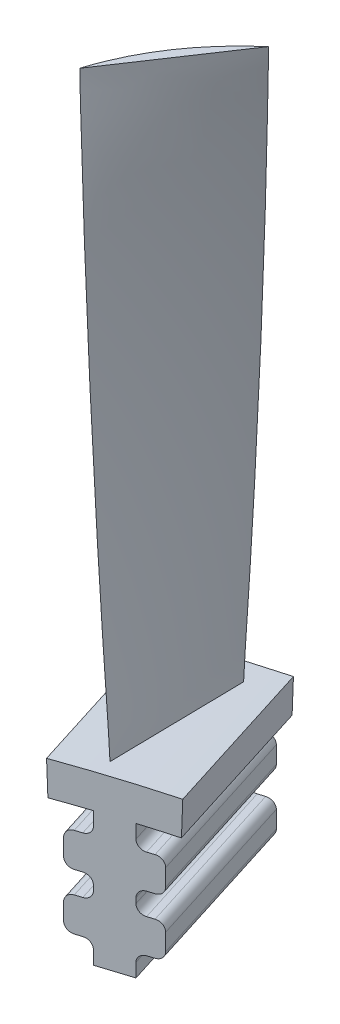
ISO-10303-21;
HEADER;
FILE_DESCRIPTION(('STEP AP214'),'2;1');
FILE_NAME('part.step','',(''),(''),'','','');
FILE_SCHEMA(('AUTOMOTIVE_DESIGN { 1 0 10303 214 1 1 1 1 }'));
ENDSEC;
DATA;
#1=APPLICATION_CONTEXT('core data for automotive mechanical design processes');
#2=APPLICATION_PROTOCOL_DEFINITION('international standard','automotive_design',2000,#1);
#3=PRODUCT_CONTEXT('',#1,'mechanical');
#4=PRODUCT('Part','Part','',(#3));
#5=PRODUCT_RELATED_PRODUCT_CATEGORY('part','',(#4));
#6=PRODUCT_DEFINITION_FORMATION('','',#4);
#7=PRODUCT_DEFINITION_CONTEXT('part definition',#1,'design');
#8=PRODUCT_DEFINITION('design','',#6,#7);
#9=PRODUCT_DEFINITION_SHAPE('','',#8);
#10=(LENGTH_UNIT() NAMED_UNIT(*) SI_UNIT(.MILLI.,.METRE.));
#11=(NAMED_UNIT(*) PLANE_ANGLE_UNIT() SI_UNIT($,.RADIAN.));
#12=(NAMED_UNIT(*) SI_UNIT($,.STERADIAN.) SOLID_ANGLE_UNIT());
#13=UNCERTAINTY_MEASURE_WITH_UNIT(LENGTH_MEASURE(1.E-05),#10,'distance_accuracy_value','');
#14=(GEOMETRIC_REPRESENTATION_CONTEXT(3) GLOBAL_UNCERTAINTY_ASSIGNED_CONTEXT((#13)) GLOBAL_UNIT_ASSIGNED_CONTEXT((#10,
#11,#12)) REPRESENTATION_CONTEXT('',''));
#15=CARTESIAN_POINT('',(0.,0.,0.));
#16=DIRECTION('',(0.,0.,1.));
#17=DIRECTION('',(1.,0.,0.));
#18=AXIS2_PLACEMENT_3D('',#15,#16,#17);
#19=CARTESIAN_POINT('',(-7.25434736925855,679.999998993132,22.9742478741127));
#20=DIRECTION('',(4.07160532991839E-07,-0.99999999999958,-8.21276738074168E-07));
#21=DIRECTION('',(0.300706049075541,9.05701116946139E-07,-0.953716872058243));
#22=AXIS2_PLACEMENT_3D('',#19,#20,#21);
#23=PLANE('',#22);
#24=CARTESIAN_POINT('',(13.1780023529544,680.000018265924,9.637031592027));
#25=CARTESIAN_POINT('',(12.629879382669,680.000017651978,10.112841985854));
#26=CARTESIAN_POINT('',(12.0875900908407,680.000017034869,10.5953963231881));
#27=CARTESIAN_POINT('',(11.0152951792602,680.000015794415,11.5741865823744));
#28=CARTESIAN_POINT('',(10.4852921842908,680.000015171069,12.0704253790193));
#29=CARTESIAN_POINT('',(9.43838562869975,680.000013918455,13.0766088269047));
#30=CARTESIAN_POINT('',(8.9214829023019,680.000013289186,13.5865543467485));
#31=CARTESIAN_POINT('',(7.90116816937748,680.000012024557,14.6205508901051));
#32=CARTESIAN_POINT('',(7.39776687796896,680.000011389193,15.1446124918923));
#33=CARTESIAN_POINT('',(6.40565875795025,680.000010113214,16.2064121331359));
#34=CARTESIAN_POINT('',(5.91695105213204,680.0000094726,16.744149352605));
#35=CARTESIAN_POINT('',(4.95497264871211,680.000008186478,17.8332373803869));
#36=CARTESIAN_POINT('',(4.48170145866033,680.00000754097,18.38458775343));
#37=CARTESIAN_POINT('',(3.59404226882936,680.00000630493,19.4495385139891));
#38=CARTESIAN_POINT('',(3.17823710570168,680.000005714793,19.9619581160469));
#39=CARTESIAN_POINT('',(2.36052057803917,680.000004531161,20.9977721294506));
#40=CARTESIAN_POINT('',(1.95860922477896,680.000003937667,21.5211665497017));
#41=CARTESIAN_POINT('',(1.16922392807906,680.000002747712,22.5787246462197));
#42=CARTESIAN_POINT('',(0.781749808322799,680.000002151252,23.1128881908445));
#43=CARTESIAN_POINT('',(0.0219461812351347,680.000000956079,24.191465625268));
#44=CARTESIAN_POINT('',(-0.350391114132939,680.000000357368,24.7358740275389));
#45=CARTESIAN_POINT('',(-1.07965681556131,679.999999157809,25.8349330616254));
#46=CARTESIAN_POINT('',(-1.43658496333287,679.99999855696,26.3895838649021));
#47=CARTESIAN_POINT('',(-2.13458975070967,679.99999735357,27.5088044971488));
#48=CARTESIAN_POINT('',(-2.47566558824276,679.999996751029,28.0733748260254));
#49=CARTESIAN_POINT('',(-3.24933292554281,679.999995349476,29.396370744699));
#50=CARTESIAN_POINT('',(-3.67580603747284,679.999994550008,30.1583859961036));
#51=CARTESIAN_POINT('',(-4.49943332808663,679.999992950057,31.6981866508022));
#52=CARTESIAN_POINT('',(-4.89658459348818,679.999992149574,32.4759736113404));
#53=CARTESIAN_POINT('',(-5.66088665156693,679.999990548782,34.0462103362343));
#54=CARTESIAN_POINT('',(-6.0280356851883,679.999989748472,34.8386609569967));
#55=CARTESIAN_POINT('',(-6.73274977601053,679.999988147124,36.4391153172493));
#56=CARTESIAN_POINT('',(-7.07023387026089,679.99998734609,37.2471547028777));
#57=CARTESIAN_POINT('',(-7.71419236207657,679.999985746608,38.8754581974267));
#58=CARTESIAN_POINT('',(-8.02066784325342,679.999984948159,39.695721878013));
#59=CARTESIAN_POINT('',(-8.6025093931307,679.999983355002,41.3471192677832));
#60=CARTESIAN_POINT('',(-8.87787858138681,679.999982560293,42.1782518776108));
#61=CARTESIAN_POINT('',(-9.13766882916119,679.999981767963,43.0142103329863));
#62=B_SPLINE_CURVE_WITH_KNOTS('',3,(#24,#25,#26,#27,#28,#29,#30,#31,#32,#33,#34,#35,#36,#37,#38,
#39,#40,#41,#42,#43,#44,#45,#46,#47,#48,#49,#50,#51,#52,#53,#54,#55,#56,#57,#58,#59,#60,#61),
.UNSPECIFIED.,.F.,.F.,(4,2,2,2,2,2,2,2,2,2,2,2,2,2,2,2,2,2,4),(0.,2.17746884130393,
4.35539865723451,6.53346681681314,8.7132152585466,10.8928333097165,13.0723817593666,
15.0518520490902,17.0313239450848,19.0107716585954,20.9891876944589,22.9676368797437,
24.946186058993,27.5652452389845,30.1845642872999,32.8040367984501,35.4304498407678,
38.0567710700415,40.6828286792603),.UNSPECIFIED.);
#63=CARTESIAN_POINT('',(13.1754247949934,680.000018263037,9.63926920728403));
#64=VERTEX_POINT('',#63);
#65=CARTESIAN_POINT('',(-9.13805841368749,680.001111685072,43.0140892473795));
#66=VERTEX_POINT('',#65);
#67=EDGE_CURVE('E2106',#64,#66,#62,.T.);
#68=ORIENTED_EDGE('',*,*,#67,.T.);
#69=CARTESIAN_POINT('',(-9.13675012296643,679.999981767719,43.0149638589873));
#70=CARTESIAN_POINT('',(-6.90316179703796,679.999985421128,39.6738479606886));
#71=CARTESIAN_POINT('',(-4.66957346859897,679.999989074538,36.3327320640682));
#72=CARTESIAN_POINT('',(-0.202396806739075,679.999996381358,29.6505002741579));
#73=CARTESIAN_POINT('',(2.03119152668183,680.000000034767,26.309384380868));
#74=CARTESIAN_POINT('',(7.23558348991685,680.000008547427,18.5243881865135));
#75=CARTESIAN_POINT('',(10.2063871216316,680.000013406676,14.0805078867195));
#76=CARTESIAN_POINT('',(13.1771907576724,680.000018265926,9.63662758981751));
#77=B_SPLINE_CURVE_WITH_KNOTS('',3,(#69,#70,#71,#72,#73,#74,#75,#76),.UNSPECIFIED.,.F.,.F.,(4,2,
2,4),(0.,12.056854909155,24.11370981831,40.1500347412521),.UNSPECIFIED.);
#78=EDGE_CURVE('E2102',#66,#64,#77,.T.);
#79=ORIENTED_EDGE('',*,*,#78,.T.);
#80=EDGE_LOOP('',(#68,#79));
#81=FACE_BOUND('',#80,.T.);
#82=ADVANCED_FACE('F1190',(#81),#23,.F.);
#83=CARTESIAN_POINT('',(2.54476140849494,499.975021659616,50.6793275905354));
#84=DIRECTION('',(0.953717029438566,-4.07159625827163E-07,-0.300705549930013));
#85=DIRECTION('',(-0.300705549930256,-8.21275448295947E-07,-0.953717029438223));
#86=AXIS2_PLACEMENT_3D('',#83,#84,#85);
#87=PLANE('',#86);
#88=CARTESIAN_POINT('',(-12.4905160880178,499.974980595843,2.99347611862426));
#89=CARTESIAN_POINT('',(-12.4905162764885,498.64164726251,2.99347732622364));
#90=CARTESIAN_POINT('',(-12.4905164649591,497.308313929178,2.99347853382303));
#91=CARTESIAN_POINT('',(-12.4905166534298,495.974980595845,2.99347974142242));
#92=B_SPLINE_CURVE_WITH_KNOTS('',3,(#88,#89,#90,#91),.UNSPECIFIED.,.F.,.F.,(4,4),(0.,1.),.UNSPECIFIED.);
#93=CARTESIAN_POINT('',(-12.4905160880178,499.974980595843,2.99347611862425));
#94=VERTEX_POINT('',#93);
#95=CARTESIAN_POINT('',(-12.4905166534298,495.974980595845,2.99347974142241));
#96=VERTEX_POINT('',#95);
#97=EDGE_CURVE('E1456',#94,#96,#92,.T.);
#98=ORIENTED_EDGE('',*,*,#97,.T.);
#99=DIRECTION('',(-0.300705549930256,-8.21275448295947E-07,-0.953717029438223));
#100=VECTOR('',#99,1.);
#101=CARTESIAN_POINT('',(2.54476084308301,495.975021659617,50.6793312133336));
#102=LINE('',#101,#100);
#103=CARTESIAN_POINT('',(2.54476084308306,495.975022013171,50.6793312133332));
#104=VERTEX_POINT('',#103);
#105=EDGE_CURVE('E1194',#104,#96,#102,.T.);
#106=ORIENTED_EDGE('',*,*,#105,.F.);
#107=CARTESIAN_POINT('',(2.54476140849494,499.975021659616,50.6793275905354));
#108=CARTESIAN_POINT('',(2.54476122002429,498.641688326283,50.6793287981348));
#109=CARTESIAN_POINT('',(2.54476103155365,497.30835499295,50.6793300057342));
#110=CARTESIAN_POINT('',(2.54476084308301,495.975021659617,50.6793312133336));
#111=B_SPLINE_CURVE_WITH_KNOTS('',3,(#107,#108,#109,#110),.UNSPECIFIED.,.F.,.F.,(4,4),(0.,1.),.UNSPECIFIED.);
#112=CARTESIAN_POINT('',(2.54476128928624,499.975021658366,50.6793276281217));
#113=VERTEX_POINT('',#112);
#114=EDGE_CURVE('E1441',#113,#104,#111,.T.);
#115=ORIENTED_EDGE('',*,*,#114,.F.);
#116=DIRECTION('',(-0.300705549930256,-8.21275448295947E-07,-0.953717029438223));
#117=VECTOR('',#116,1.);
#118=CARTESIAN_POINT('',(2.54476140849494,499.975021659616,50.6793275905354));
#119=LINE('',#118,#117);
#120=EDGE_CURVE('E2109',#113,#94,#119,.T.);
#121=ORIENTED_EDGE('',*,*,#120,.T.);
#122=EDGE_LOOP('',(#98,#106,#115,#121));
#123=FACE_BOUND('',#122,.T.);
#124=ADVANCED_FACE('F1454',(#123),#87,.F.);
#125=CARTESIAN_POINT('',(0.16046826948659,495.975022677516,51.4310950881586));
#126=DIRECTION('',(-0.300705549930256,-8.21275448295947E-07,-0.953717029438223));
#127=DIRECTION('',(-0.953717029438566,4.07159625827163E-07,0.300705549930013));
#128=AXIS2_PLACEMENT_3D('',#125,#126,#127);
#129=CYLINDRICAL_SURFACE('',#128,2.5);
#130=CARTESIAN_POINT('',(-14.8748092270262,495.974981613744,3.74524361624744));
#131=DIRECTION('',(-0.300705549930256,-8.21275448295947E-07,-0.953717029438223));
#132=DIRECTION('',(-0.953717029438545,0.,0.300705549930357));
#133=AXIS2_PLACEMENT_3D('',#130,#131,#132);
#134=CIRCLE('',#133,2.5);
#135=CARTESIAN_POINT('',(-14.8748095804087,493.474981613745,3.7452458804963));
#136=VERTEX_POINT('',#135);
#137=EDGE_CURVE('E1540',#96,#136,#134,.T.);
#138=ORIENTED_EDGE('',*,*,#137,.T.);
#139=DIRECTION('',(-0.300705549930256,-8.21275448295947E-07,-0.953717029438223));
#140=VECTOR('',#139,1.);
#141=CARTESIAN_POINT('',(0.160467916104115,493.475022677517,51.4310973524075));
#142=LINE('',#141,#140);
#143=CARTESIAN_POINT('',(0.160467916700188,493.475022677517,51.4310973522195));
#144=VERTEX_POINT('',#143);
#145=EDGE_CURVE('E1460',#144,#136,#142,.T.);
#146=ORIENTED_EDGE('',*,*,#145,.F.);
#147=CARTESIAN_POINT('',(0.160468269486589,495.975022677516,51.4310950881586));
#148=DIRECTION('',(-0.300705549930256,-8.21275448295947E-07,-0.953717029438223));
#149=DIRECTION('',(-0.953717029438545,0.,0.300705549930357));
#150=AXIS2_PLACEMENT_3D('',#147,#148,#149);
#151=CIRCLE('',#150,2.5);
#152=EDGE_CURVE('E1446',#104,#144,#151,.T.);
#153=ORIENTED_EDGE('',*,*,#152,.F.);
#154=ORIENTED_EDGE('',*,*,#105,.T.);
#155=EDGE_LOOP('',(#138,#146,#153,#154));
#156=FACE_BOUND('',#155,.T.);
#157=ADVANCED_FACE('F1461',(#156),#129,.F.);
#158=CARTESIAN_POINT('',(0.160467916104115,493.475022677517,51.4310973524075));
#159=DIRECTION('',(-1.41352983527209E-07,-0.99999999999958,9.05699540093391E-07));
#160=DIRECTION('',(-0.300705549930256,-8.21275448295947E-07,-0.953717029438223));
#161=AXIS2_PLACEMENT_3D('',#158,#159,#160);
#162=PLANE('',#161);
#163=CARTESIAN_POINT('',(-14.8748095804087,493.474981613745,3.7452458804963));
#164=CARTESIAN_POINT('',(-15.5106209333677,493.474981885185,3.94571624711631));
#165=CARTESIAN_POINT('',(-16.1464322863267,493.474982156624,4.14618661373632));
#166=CARTESIAN_POINT('',(-16.7822436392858,493.474982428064,4.34665698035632));
#167=B_SPLINE_CURVE_WITH_KNOTS('',3,(#163,#164,#165,#166),.UNSPECIFIED.,.F.,.F.,(4,4),(0.,1.),.UNSPECIFIED.);
#168=CARTESIAN_POINT('',(-16.7822436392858,493.474982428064,4.34665698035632));
#169=VERTEX_POINT('',#168);
#170=EDGE_CURVE('E1539',#136,#169,#167,.T.);
#171=ORIENTED_EDGE('',*,*,#170,.T.);
#172=DIRECTION('',(-0.300705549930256,-8.21275448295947E-07,-0.953717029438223));
#173=VECTOR('',#172,1.);
#174=CARTESIAN_POINT('',(-1.74696614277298,493.475023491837,52.0325084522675));
#175=LINE('',#174,#173);
#176=CARTESIAN_POINT('',(-1.74696580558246,493.475023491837,52.0325083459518));
#177=VERTEX_POINT('',#176);
#178=EDGE_CURVE('E2050',#177,#169,#175,.T.);
#179=ORIENTED_EDGE('',*,*,#178,.F.);
#180=CARTESIAN_POINT('',(0.160467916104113,493.475022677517,51.4310973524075));
#181=CARTESIAN_POINT('',(-0.475343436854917,493.475022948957,51.6315677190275));
#182=CARTESIAN_POINT('',(-1.11115478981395,493.475023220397,51.8320380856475));
#183=CARTESIAN_POINT('',(-1.74696614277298,493.475023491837,52.0325084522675));
#184=B_SPLINE_CURVE_WITH_KNOTS('',3,(#180,#181,#182,#183),.UNSPECIFIED.,.F.,.F.,(4,4),(0.,1.),.UNSPECIFIED.);
#185=EDGE_CURVE('E1463',#144,#177,#184,.T.);
#186=ORIENTED_EDGE('',*,*,#185,.F.);
#187=ORIENTED_EDGE('',*,*,#145,.T.);
#188=EDGE_LOOP('',(#171,#179,#186,#187));
#189=FACE_BOUND('',#188,.T.);
#190=ADVANCED_FACE('F2053',(#189),#162,.F.);
#191=CARTESIAN_POINT('',(-1.74696649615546,490.975023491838,52.0325107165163));
#192=DIRECTION('',(-0.300705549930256,-8.21275448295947E-07,-0.953717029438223));
#193=DIRECTION('',(-0.953717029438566,4.07159625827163E-07,0.300705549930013));
#194=AXIS2_PLACEMENT_3D('',#191,#192,#193);
#195=CYLINDRICAL_SURFACE('',#194,2.5);
#196=CARTESIAN_POINT('',(-16.7822439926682,490.974982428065,4.34665924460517));
#197=DIRECTION('',(-0.300705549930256,-8.21275448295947E-07,-0.953717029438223));
#198=DIRECTION('',(-0.953717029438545,0.,0.300705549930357));
#199=AXIS2_PLACEMENT_3D('',#196,#197,#198);
#200=CIRCLE('',#199,2.5);
#201=CARTESIAN_POINT('',(-19.1665365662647,490.974983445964,5.09842311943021));
#202=VERTEX_POINT('',#201);
#203=EDGE_CURVE('E1536',#169,#202,#200,.F.);
#204=ORIENTED_EDGE('',*,*,#203,.T.);
#205=DIRECTION('',(0.300705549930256,8.21275448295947E-07,0.953717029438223));
#206=VECTOR('',#205,1.);
#207=CARTESIAN_POINT('',(-4.13125906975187,490.975024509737,52.7842745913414));
#208=LINE('',#207,#206);
#209=CARTESIAN_POINT('',(-4.13125906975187,490.975024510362,52.7842745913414));
#210=VERTEX_POINT('',#209);
#211=EDGE_CURVE('E2048',#210,#202,#208,.F.);
#212=ORIENTED_EDGE('',*,*,#211,.F.);
#213=CARTESIAN_POINT('',(-1.74696649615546,490.975023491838,52.0325107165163));
#214=DIRECTION('',(-0.300705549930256,-8.21275448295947E-07,-0.953717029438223));
#215=DIRECTION('',(-0.953717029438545,0.,0.300705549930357));
#216=AXIS2_PLACEMENT_3D('',#213,#214,#215);
#217=CIRCLE('',#216,2.5);
#218=EDGE_CURVE('E1465',#177,#210,#217,.F.);
#219=ORIENTED_EDGE('',*,*,#218,.F.);
#220=ORIENTED_EDGE('',*,*,#178,.T.);
#221=EDGE_LOOP('',(#204,#212,#219,#220));
#222=FACE_BOUND('',#221,.T.);
#223=ADVANCED_FACE('F2060',(#222),#195,.T.);
#224=CARTESIAN_POINT('',(-4.13125906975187,490.975024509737,52.7842745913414));
#225=DIRECTION('',(0.953717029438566,-4.07159625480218E-07,-0.300705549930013));
#226=DIRECTION('',(1.41352983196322E-07,0.99999999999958,-9.05699539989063E-07));
#227=AXIS2_PLACEMENT_3D('',#224,#225,#226);
#228=PLANE('',#227);
#229=CARTESIAN_POINT('',(-19.1665365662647,490.974983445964,5.09842311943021));
#230=CARTESIAN_POINT('',(-19.166536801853,489.308316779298,5.09842462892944));
#231=CARTESIAN_POINT('',(-19.1665370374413,487.641650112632,5.09842613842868));
#232=CARTESIAN_POINT('',(-19.1665372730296,485.974983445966,5.09842764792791));
#233=B_SPLINE_CURVE_WITH_KNOTS('',3,(#229,#230,#231,#232),.UNSPECIFIED.,.F.,.F.,(4,4),(0.,1.),.UNSPECIFIED.);
#234=CARTESIAN_POINT('',(-19.1665372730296,485.974983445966,5.09842764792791));
#235=VERTEX_POINT('',#234);
#236=EDGE_CURVE('E1535',#202,#235,#233,.T.);
#237=ORIENTED_EDGE('',*,*,#236,.T.);
#238=DIRECTION('',(-0.300705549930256,-8.21275448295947E-07,-0.953717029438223));
#239=VECTOR('',#238,1.);
#240=CARTESIAN_POINT('',(-4.13125977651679,485.975024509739,52.7842791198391));
#241=LINE('',#240,#239);
#242=CARTESIAN_POINT('',(-4.13125977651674,485.975024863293,52.7842791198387));
#243=VERTEX_POINT('',#242);
#244=EDGE_CURVE('E2046',#243,#235,#241,.T.);
#245=ORIENTED_EDGE('',*,*,#244,.F.);
#246=CARTESIAN_POINT('',(-4.13125906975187,490.975024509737,52.7842745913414));
#247=CARTESIAN_POINT('',(-4.13125930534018,489.308357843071,52.7842761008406));
#248=CARTESIAN_POINT('',(-4.13125954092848,487.641691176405,52.7842776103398));
#249=CARTESIAN_POINT('',(-4.13125977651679,485.975024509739,52.7842791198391));
#250=B_SPLINE_CURVE_WITH_KNOTS('',3,(#246,#247,#248,#249),.UNSPECIFIED.,.F.,.F.,(4,4),(0.,1.),.UNSPECIFIED.);
#251=EDGE_CURVE('E1684',#210,#243,#250,.T.);
#252=ORIENTED_EDGE('',*,*,#251,.F.);
#253=ORIENTED_EDGE('',*,*,#211,.T.);
#254=EDGE_LOOP('',(#237,#245,#252,#253));
#255=FACE_BOUND('',#254,.T.);
#256=ADVANCED_FACE('F2067',(#255),#228,.F.);
#257=CARTESIAN_POINT('',(-1.74696720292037,485.97502349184,52.032515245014));
#258=DIRECTION('',(-0.300705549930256,-8.21275448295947E-07,-0.953717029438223));
#259=DIRECTION('',(-0.953717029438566,4.07159625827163E-07,0.300705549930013));
#260=AXIS2_PLACEMENT_3D('',#257,#258,#259);
#261=CYLINDRICAL_SURFACE('',#260,2.5);
#262=CARTESIAN_POINT('',(-16.7822446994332,485.974982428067,4.34666377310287));
#263=DIRECTION('',(-0.300705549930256,-8.21275448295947E-07,-0.953717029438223));
#264=DIRECTION('',(-0.953717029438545,0.,0.300705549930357));
#265=AXIS2_PLACEMENT_3D('',#262,#263,#264);
#266=CIRCLE('',#265,2.5);
#267=CARTESIAN_POINT('',(-16.7822450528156,483.474982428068,4.34666603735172));
#268=VERTEX_POINT('',#267);
#269=EDGE_CURVE('E1532',#235,#268,#266,.F.);
#270=ORIENTED_EDGE('',*,*,#269,.T.);
#271=DIRECTION('',(0.300705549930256,8.21275448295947E-07,0.953717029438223));
#272=VECTOR('',#271,1.);
#273=CARTESIAN_POINT('',(-1.74696755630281,483.475023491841,52.0325175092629));
#274=LINE('',#273,#272);
#275=CARTESIAN_POINT('',(-1.74696755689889,483.475023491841,52.0325175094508));
#276=VERTEX_POINT('',#275);
#277=EDGE_CURVE('E2044',#276,#268,#274,.F.);
#278=ORIENTED_EDGE('',*,*,#277,.F.);
#279=CARTESIAN_POINT('',(-1.74696720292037,485.97502349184,52.032515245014));
#280=DIRECTION('',(-0.300705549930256,-8.21275448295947E-07,-0.953717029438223));
#281=DIRECTION('',(-0.953717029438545,0.,0.300705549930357));
#282=AXIS2_PLACEMENT_3D('',#279,#280,#281);
#283=CIRCLE('',#282,2.5);
#284=EDGE_CURVE('E1691',#243,#276,#283,.F.);
#285=ORIENTED_EDGE('',*,*,#284,.F.);
#286=ORIENTED_EDGE('',*,*,#244,.T.);
#287=EDGE_LOOP('',(#270,#278,#285,#286));
#288=FACE_BOUND('',#287,.T.);
#289=ADVANCED_FACE('F2069',(#288),#261,.T.);
#290=CARTESIAN_POINT('',(-1.74696755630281,483.475023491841,52.0325175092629));
#291=DIRECTION('',(1.41352983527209E-07,0.99999999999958,-9.05699540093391E-07));
#292=DIRECTION('',(0.300705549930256,8.21275448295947E-07,0.953717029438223));
#293=AXIS2_PLACEMENT_3D('',#290,#291,#292);
#294=PLANE('',#293);
#295=CARTESIAN_POINT('',(-16.7822450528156,483.474982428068,4.34666603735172));
#296=CARTESIAN_POINT('',(-16.1464336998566,483.474982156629,4.14619567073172));
#297=CARTESIAN_POINT('',(-15.5106223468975,483.474981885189,3.94572530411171));
#298=CARTESIAN_POINT('',(-14.8748109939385,483.474981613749,3.74525493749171));
#299=B_SPLINE_CURVE_WITH_KNOTS('',3,(#295,#296,#297,#298),.UNSPECIFIED.,.F.,.F.,(4,4),(0.,1.),.UNSPECIFIED.);
#300=CARTESIAN_POINT('',(-14.8748109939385,483.474981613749,3.74525493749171));
#301=VERTEX_POINT('',#300);
#302=EDGE_CURVE('E1531',#268,#301,#299,.T.);
#303=ORIENTED_EDGE('',*,*,#302,.T.);
#304=DIRECTION('',(-0.300705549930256,-8.21275448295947E-07,-0.953717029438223));
#305=VECTOR('',#304,1.);
#306=CARTESIAN_POINT('',(0.16046650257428,483.475022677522,51.4311064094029));
#307=LINE('',#306,#305);
#308=CARTESIAN_POINT('',(0.160466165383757,483.475022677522,51.4311065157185));
#309=VERTEX_POINT('',#308);
#310=EDGE_CURVE('E2042',#309,#301,#307,.T.);
#311=ORIENTED_EDGE('',*,*,#310,.F.);
#312=CARTESIAN_POINT('',(-1.74696755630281,483.475023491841,52.0325175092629));
#313=CARTESIAN_POINT('',(-1.11115620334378,483.475023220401,51.8320471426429));
#314=CARTESIAN_POINT('',(-0.475344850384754,483.475022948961,51.6315767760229));
#315=CARTESIAN_POINT('',(0.160466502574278,483.475022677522,51.4311064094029));
#316=B_SPLINE_CURVE_WITH_KNOTS('',3,(#312,#313,#314,#315),.UNSPECIFIED.,.F.,.F.,(4,4),(0.,1.),.UNSPECIFIED.);
#317=EDGE_CURVE('E1692',#276,#309,#316,.T.);
#318=ORIENTED_EDGE('',*,*,#317,.F.);
#319=ORIENTED_EDGE('',*,*,#277,.T.);
#320=EDGE_LOOP('',(#303,#311,#318,#319));
#321=FACE_BOUND('',#320,.T.);
#322=ADVANCED_FACE('F2233',(#321),#294,.F.);
#323=CARTESIAN_POINT('',(0.160466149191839,480.975022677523,51.4311086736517));
#324=DIRECTION('',(-0.300705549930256,-8.21275448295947E-07,-0.953717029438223));
#325=DIRECTION('',(-0.953717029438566,4.07159625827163E-07,0.300705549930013));
#326=AXIS2_PLACEMENT_3D('',#323,#324,#325);
#327=CYLINDRICAL_SURFACE('',#326,2.5);
#328=CARTESIAN_POINT('',(-14.874811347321,480.97498161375,3.74525720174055));
#329=DIRECTION('',(-0.300705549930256,-8.21275448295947E-07,-0.953717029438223));
#330=DIRECTION('',(-0.953717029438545,0.,0.300705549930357));
#331=AXIS2_PLACEMENT_3D('',#328,#329,#330);
#332=CIRCLE('',#331,2.5);
#333=CARTESIAN_POINT('',(-12.4905187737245,480.974980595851,2.99349332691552));
#334=VERTEX_POINT('',#333);
#335=EDGE_CURVE('E1528',#301,#334,#332,.T.);
#336=ORIENTED_EDGE('',*,*,#335,.T.);
#337=DIRECTION('',(-0.300705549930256,-8.21275448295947E-07,-0.953717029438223));
#338=VECTOR('',#337,1.);
#339=CARTESIAN_POINT('',(2.54475872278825,480.975021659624,50.6793447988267));
#340=LINE('',#339,#338);
#341=CARTESIAN_POINT('',(2.54475872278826,480.975021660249,50.6793447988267));
#342=VERTEX_POINT('',#341);
#343=EDGE_CURVE('E2040',#342,#334,#340,.T.);
#344=ORIENTED_EDGE('',*,*,#343,.F.);
#345=CARTESIAN_POINT('',(0.160466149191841,480.975022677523,51.4311086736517));
#346=DIRECTION('',(-0.300705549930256,-8.21275448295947E-07,-0.953717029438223));
#347=DIRECTION('',(-0.953717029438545,0.,0.300705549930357));
#348=AXIS2_PLACEMENT_3D('',#345,#346,#347);
#349=CIRCLE('',#348,2.5);
#350=EDGE_CURVE('E1699',#309,#342,#349,.T.);
#351=ORIENTED_EDGE('',*,*,#350,.F.);
#352=ORIENTED_EDGE('',*,*,#310,.T.);
#353=EDGE_LOOP('',(#336,#344,#351,#352));
#354=FACE_BOUND('',#353,.T.);
#355=ADVANCED_FACE('F2229',(#354),#327,.F.);
#356=CARTESIAN_POINT('',(2.54475872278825,480.975021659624,50.6793447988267));
#357=DIRECTION('',(0.953717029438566,-4.07159625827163E-07,-0.300705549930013));
#358=DIRECTION('',(-0.300705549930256,-8.21275448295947E-07,-0.953717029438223));
#359=AXIS2_PLACEMENT_3D('',#356,#357,#358);
#360=PLANE('',#359);
#361=CARTESIAN_POINT('',(-12.4905187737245,480.974980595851,2.99349332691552));
#362=CARTESIAN_POINT('',(-12.490518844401,480.474980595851,2.99349377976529));
#363=CARTESIAN_POINT('',(-12.4905189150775,479.974980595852,2.99349423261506));
#364=CARTESIAN_POINT('',(-12.490518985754,479.474980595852,2.99349468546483));
#365=B_SPLINE_CURVE_WITH_KNOTS('',3,(#361,#362,#363,#364),.UNSPECIFIED.,.F.,.F.,(4,4),(0.,1.),.UNSPECIFIED.);
#366=CARTESIAN_POINT('',(-12.490518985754,479.474980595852,2.99349468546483));
#367=VERTEX_POINT('',#366);
#368=EDGE_CURVE('E1527',#334,#367,#365,.T.);
#369=ORIENTED_EDGE('',*,*,#368,.T.);
#370=DIRECTION('',(-0.300705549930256,-8.21275448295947E-07,-0.953717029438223));
#371=VECTOR('',#370,1.);
#372=CARTESIAN_POINT('',(2.54475851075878,479.475021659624,50.679346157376));
#373=LINE('',#372,#371);
#374=CARTESIAN_POINT('',(2.54475851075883,479.475022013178,50.6793461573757));
#375=VERTEX_POINT('',#374);
#376=EDGE_CURVE('E2038',#375,#367,#373,.T.);
#377=ORIENTED_EDGE('',*,*,#376,.F.);
#378=CARTESIAN_POINT('',(2.54475872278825,480.975021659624,50.6793447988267));
#379=CARTESIAN_POINT('',(2.54475865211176,480.475021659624,50.6793452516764));
#380=CARTESIAN_POINT('',(2.54475858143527,479.975021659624,50.6793457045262));
#381=CARTESIAN_POINT('',(2.54475851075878,479.475021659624,50.679346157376));
#382=B_SPLINE_CURVE_WITH_KNOTS('',3,(#378,#379,#380,#381),.UNSPECIFIED.,.F.,.F.,(4,4),(0.,1.),.UNSPECIFIED.);
#383=EDGE_CURVE('E1700',#342,#375,#382,.T.);
#384=ORIENTED_EDGE('',*,*,#383,.F.);
#385=ORIENTED_EDGE('',*,*,#343,.T.);
#386=EDGE_LOOP('',(#369,#377,#384,#385));
#387=FACE_BOUND('',#386,.T.);
#388=ADVANCED_FACE('F2225',(#387),#360,.F.);
#389=CARTESIAN_POINT('',(0.160465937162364,479.475022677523,51.431110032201));
#390=DIRECTION('',(-0.300705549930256,-8.21275448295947E-07,-0.953717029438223));
#391=DIRECTION('',(-0.953717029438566,4.07159625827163E-07,0.300705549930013));
#392=AXIS2_PLACEMENT_3D('',#389,#390,#391);
#393=CYLINDRICAL_SURFACE('',#392,2.5);
#394=CARTESIAN_POINT('',(-14.8748115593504,479.474981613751,3.74525856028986));
#395=DIRECTION('',(-0.300705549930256,-8.21275448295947E-07,-0.953717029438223));
#396=DIRECTION('',(-0.953717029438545,0.,0.300705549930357));
#397=AXIS2_PLACEMENT_3D('',#394,#395,#396);
#398=CIRCLE('',#397,2.5);
#399=CARTESIAN_POINT('',(-14.8748119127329,476.974981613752,3.74526082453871));
#400=VERTEX_POINT('',#399);
#401=EDGE_CURVE('E1524',#367,#400,#398,.T.);
#402=ORIENTED_EDGE('',*,*,#401,.T.);
#403=DIRECTION('',(-0.300705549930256,-8.21275448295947E-07,-0.953717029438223));
#404=VECTOR('',#403,1.);
#405=CARTESIAN_POINT('',(0.160465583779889,476.975022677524,51.4311122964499));
#406=LINE('',#405,#404);
#407=CARTESIAN_POINT('',(0.160465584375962,476.975022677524,51.4311122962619));
#408=VERTEX_POINT('',#407);
#409=EDGE_CURVE('E2036',#408,#400,#406,.T.);
#410=ORIENTED_EDGE('',*,*,#409,.F.);
#411=CARTESIAN_POINT('',(0.160465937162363,479.475022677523,51.431110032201));
#412=DIRECTION('',(-0.300705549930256,-8.21275448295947E-07,-0.953717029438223));
#413=DIRECTION('',(-0.953717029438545,0.,0.300705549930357));
#414=AXIS2_PLACEMENT_3D('',#411,#412,#413);
#415=CIRCLE('',#414,2.5);
#416=EDGE_CURVE('E1707',#375,#408,#415,.T.);
#417=ORIENTED_EDGE('',*,*,#416,.F.);
#418=ORIENTED_EDGE('',*,*,#376,.T.);
#419=EDGE_LOOP('',(#402,#410,#417,#418));
#420=FACE_BOUND('',#419,.T.);
#421=ADVANCED_FACE('F2221',(#420),#393,.F.);
#422=CARTESIAN_POINT('',(0.160465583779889,476.975022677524,51.4311122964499));
#423=DIRECTION('',(-1.41352983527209E-07,-0.99999999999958,9.05699540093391E-07));
#424=DIRECTION('',(-0.300705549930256,-8.21275448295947E-07,-0.953717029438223));
#425=AXIS2_PLACEMENT_3D('',#422,#423,#424);
#426=PLANE('',#425);
#427=CARTESIAN_POINT('',(-14.8748119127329,476.974981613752,3.74526082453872));
#428=CARTESIAN_POINT('',(-15.5106232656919,476.974981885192,3.94573119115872));
#429=CARTESIAN_POINT('',(-16.146434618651,476.974982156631,4.14620155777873));
#430=CARTESIAN_POINT('',(-16.78224597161,476.974982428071,4.34667192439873));
#431=B_SPLINE_CURVE_WITH_KNOTS('',3,(#427,#428,#429,#430),.UNSPECIFIED.,.F.,.F.,(4,4),(0.,1.),.UNSPECIFIED.);
#432=CARTESIAN_POINT('',(-16.78224597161,476.974982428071,4.34667192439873));
#433=VERTEX_POINT('',#432);
#434=EDGE_CURVE('E1523',#400,#433,#431,.T.);
#435=ORIENTED_EDGE('',*,*,#434,.T.);
#436=DIRECTION('',(-0.300705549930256,-8.21275448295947E-07,-0.953717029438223));
#437=VECTOR('',#436,1.);
#438=CARTESIAN_POINT('',(-1.74696847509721,476.975023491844,52.0325233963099));
#439=LINE('',#438,#437);
#440=CARTESIAN_POINT('',(-1.74696813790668,476.975023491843,52.0325232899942));
#441=VERTEX_POINT('',#440);
#442=EDGE_CURVE('E2034',#441,#433,#439,.T.);
#443=ORIENTED_EDGE('',*,*,#442,.F.);
#444=CARTESIAN_POINT('',(0.160465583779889,476.975022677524,51.4311122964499));
#445=CARTESIAN_POINT('',(-0.475345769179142,476.975022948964,51.6315826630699));
#446=CARTESIAN_POINT('',(-1.11115712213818,476.975023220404,51.8320530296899));
#447=CARTESIAN_POINT('',(-1.74696847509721,476.975023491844,52.0325233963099));
#448=B_SPLINE_CURVE_WITH_KNOTS('',3,(#444,#445,#446,#447),.UNSPECIFIED.,.F.,.F.,(4,4),(0.,1.),.UNSPECIFIED.);
#449=EDGE_CURVE('E1708',#408,#441,#448,.T.);
#450=ORIENTED_EDGE('',*,*,#449,.F.);
#451=ORIENTED_EDGE('',*,*,#409,.T.);
#452=EDGE_LOOP('',(#435,#443,#450,#451));
#453=FACE_BOUND('',#452,.T.);
#454=ADVANCED_FACE('F2217',(#453),#426,.F.);
#455=CARTESIAN_POINT('',(-1.74696882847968,474.475023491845,52.0325256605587));
#456=DIRECTION('',(-0.300705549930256,-8.21275448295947E-07,-0.953717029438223));
#457=DIRECTION('',(-0.953717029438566,4.07159625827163E-07,0.300705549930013));
#458=AXIS2_PLACEMENT_3D('',#455,#456,#457);
#459=CYLINDRICAL_SURFACE('',#458,2.5);
#460=CARTESIAN_POINT('',(-16.7822463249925,474.474982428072,4.34667418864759));
#461=DIRECTION('',(-0.300705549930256,-8.21275448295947E-07,-0.953717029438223));
#462=DIRECTION('',(-0.953717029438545,0.,0.300705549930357));
#463=AXIS2_PLACEMENT_3D('',#460,#461,#462);
#464=CIRCLE('',#463,2.5);
#465=CARTESIAN_POINT('',(-19.1665388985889,474.474983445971,5.09843806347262));
#466=VERTEX_POINT('',#465);
#467=EDGE_CURVE('E1520',#433,#466,#464,.F.);
#468=ORIENTED_EDGE('',*,*,#467,.T.);
#469=DIRECTION('',(0.300705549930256,8.21275448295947E-07,0.953717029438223));
#470=VECTOR('',#469,1.);
#471=CARTESIAN_POINT('',(-4.1312614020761,474.475024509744,52.7842895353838));
#472=LINE('',#471,#470);
#473=CARTESIAN_POINT('',(-4.1312614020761,474.475024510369,52.7842895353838));
#474=VERTEX_POINT('',#473);
#475=EDGE_CURVE('E2032',#474,#466,#472,.F.);
#476=ORIENTED_EDGE('',*,*,#475,.F.);
#477=CARTESIAN_POINT('',(-1.74696882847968,474.475023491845,52.0325256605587));
#478=DIRECTION('',(-0.300705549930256,-8.21275448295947E-07,-0.953717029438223));
#479=DIRECTION('',(-0.953717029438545,0.,0.300705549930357));
#480=AXIS2_PLACEMENT_3D('',#477,#478,#479);
#481=CIRCLE('',#480,2.5);
#482=EDGE_CURVE('E1715',#441,#474,#481,.F.);
#483=ORIENTED_EDGE('',*,*,#482,.F.);
#484=ORIENTED_EDGE('',*,*,#442,.T.);
#485=EDGE_LOOP('',(#468,#476,#483,#484));
#486=FACE_BOUND('',#485,.T.);
#487=ADVANCED_FACE('F2213',(#486),#459,.T.);
#488=CARTESIAN_POINT('',(-4.1312614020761,474.475024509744,52.7842895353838));
#489=DIRECTION('',(0.953717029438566,-4.07159625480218E-07,-0.300705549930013));
#490=DIRECTION('',(1.41352983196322E-07,0.99999999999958,-9.05699539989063E-07));
#491=AXIS2_PLACEMENT_3D('',#488,#489,#490);
#492=PLANE('',#491);
#493=CARTESIAN_POINT('',(-19.1665388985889,474.474983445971,5.09843806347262));
#494=CARTESIAN_POINT('',(-19.1665391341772,472.808316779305,5.09843957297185));
#495=CARTESIAN_POINT('',(-19.1665393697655,471.141650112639,5.09844108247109));
#496=CARTESIAN_POINT('',(-19.1665396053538,469.474983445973,5.09844259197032));
#497=B_SPLINE_CURVE_WITH_KNOTS('',3,(#493,#494,#495,#496),.UNSPECIFIED.,.F.,.F.,(4,4),(0.,1.),.UNSPECIFIED.);
#498=CARTESIAN_POINT('',(-19.1665396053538,469.474983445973,5.09844259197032));
#499=VERTEX_POINT('',#498);
#500=EDGE_CURVE('E1519',#466,#499,#497,.T.);
#501=ORIENTED_EDGE('',*,*,#500,.T.);
#502=DIRECTION('',(-0.300705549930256,-8.21275448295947E-07,-0.953717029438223));
#503=VECTOR('',#502,1.);
#504=CARTESIAN_POINT('',(-4.13126210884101,469.475024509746,52.7842940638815));
#505=LINE('',#504,#503);
#506=CARTESIAN_POINT('',(-4.13126210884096,469.4750248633,52.7842940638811));
#507=VERTEX_POINT('',#506);
#508=EDGE_CURVE('E2030',#507,#499,#505,.T.);
#509=ORIENTED_EDGE('',*,*,#508,.F.);
#510=CARTESIAN_POINT('',(-4.1312614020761,474.475024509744,52.7842895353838));
#511=CARTESIAN_POINT('',(-4.1312616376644,472.808357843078,52.784291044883));
#512=CARTESIAN_POINT('',(-4.13126187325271,471.141691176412,52.7842925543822));
#513=CARTESIAN_POINT('',(-4.13126210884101,469.475024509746,52.7842940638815));
#514=B_SPLINE_CURVE_WITH_KNOTS('',3,(#510,#511,#512,#513),.UNSPECIFIED.,.F.,.F.,(4,4),(0.,1.),.UNSPECIFIED.);
#515=EDGE_CURVE('E1716',#474,#507,#514,.T.);
#516=ORIENTED_EDGE('',*,*,#515,.F.);
#517=ORIENTED_EDGE('',*,*,#475,.T.);
#518=EDGE_LOOP('',(#501,#509,#516,#517));
#519=FACE_BOUND('',#518,.T.);
#520=ADVANCED_FACE('F2209',(#519),#492,.F.);
#521=CARTESIAN_POINT('',(-1.7469695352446,469.475023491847,52.0325301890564));
#522=DIRECTION('',(-0.300705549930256,-8.21275448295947E-07,-0.953717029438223));
#523=DIRECTION('',(-0.953717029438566,4.07159625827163E-07,0.300705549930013));
#524=AXIS2_PLACEMENT_3D('',#521,#522,#523);
#525=CYLINDRICAL_SURFACE('',#524,2.5);
#526=CARTESIAN_POINT('',(-16.7822470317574,469.474982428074,4.34667871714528));
#527=DIRECTION('',(-0.300705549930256,-8.21275448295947E-07,-0.953717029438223));
#528=DIRECTION('',(-0.953717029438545,0.,0.300705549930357));
#529=AXIS2_PLACEMENT_3D('',#526,#527,#528);
#530=CIRCLE('',#529,2.5);
#531=CARTESIAN_POINT('',(-16.7822473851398,466.974982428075,4.34668098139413));
#532=VERTEX_POINT('',#531);
#533=EDGE_CURVE('E1516',#499,#532,#530,.F.);
#534=ORIENTED_EDGE('',*,*,#533,.T.);
#535=DIRECTION('',(0.300705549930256,8.21275448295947E-07,0.953717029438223));
#536=VECTOR('',#535,1.);
#537=CARTESIAN_POINT('',(-1.74696988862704,466.975023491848,52.0325324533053));
#538=LINE('',#537,#536);
#539=CARTESIAN_POINT('',(-1.74696988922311,466.975023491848,52.0325324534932));
#540=VERTEX_POINT('',#539);
#541=EDGE_CURVE('E2028',#540,#532,#538,.F.);
#542=ORIENTED_EDGE('',*,*,#541,.F.);
#543=CARTESIAN_POINT('',(-1.7469695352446,469.475023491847,52.0325301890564));
#544=DIRECTION('',(-0.300705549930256,-8.21275448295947E-07,-0.953717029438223));
#545=DIRECTION('',(-0.953717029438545,0.,0.300705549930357));
#546=AXIS2_PLACEMENT_3D('',#543,#544,#545);
#547=CIRCLE('',#546,2.5);
#548=EDGE_CURVE('E1723',#507,#540,#547,.F.);
#549=ORIENTED_EDGE('',*,*,#548,.F.);
#550=ORIENTED_EDGE('',*,*,#508,.T.);
#551=EDGE_LOOP('',(#534,#542,#549,#550));
#552=FACE_BOUND('',#551,.T.);
#553=ADVANCED_FACE('F2205',(#552),#525,.T.);
#554=CARTESIAN_POINT('',(-1.74696988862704,466.975023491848,52.0325324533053));
#555=DIRECTION('',(1.41352983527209E-07,0.99999999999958,-9.05699540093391E-07));
#556=DIRECTION('',(0.300705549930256,8.21275448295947E-07,0.953717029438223));
#557=AXIS2_PLACEMENT_3D('',#554,#555,#556);
#558=PLANE('',#557);
#559=CARTESIAN_POINT('',(-16.7822473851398,466.974982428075,4.34668098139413));
#560=CARTESIAN_POINT('',(-16.1464360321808,466.974982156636,4.14621061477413));
#561=CARTESIAN_POINT('',(-15.5106246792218,466.974981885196,3.94574024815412));
#562=CARTESIAN_POINT('',(-14.8748133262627,466.974981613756,3.74526988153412));
#563=B_SPLINE_CURVE_WITH_KNOTS('',3,(#559,#560,#561,#562),.UNSPECIFIED.,.F.,.F.,(4,4),(0.,1.),.UNSPECIFIED.);
#564=CARTESIAN_POINT('',(-14.8748133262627,466.974981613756,3.74526988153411));
#565=VERTEX_POINT('',#564);
#566=EDGE_CURVE('E1515',#532,#565,#563,.T.);
#567=ORIENTED_EDGE('',*,*,#566,.T.);
#568=DIRECTION('',(-0.300705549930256,-8.21275448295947E-07,-0.953717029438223));
#569=VECTOR('',#568,1.);
#570=CARTESIAN_POINT('',(0.160464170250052,466.975022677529,51.4311213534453));
#571=LINE('',#570,#569);
#572=CARTESIAN_POINT('',(0.160463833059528,466.975022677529,51.4311214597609));
#573=VERTEX_POINT('',#572);
#574=EDGE_CURVE('E2026',#573,#565,#571,.T.);
#575=ORIENTED_EDGE('',*,*,#574,.F.);
#576=CARTESIAN_POINT('',(-1.74696988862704,466.975023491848,52.0325324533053));
#577=CARTESIAN_POINT('',(-1.11115853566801,466.975023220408,51.8320620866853));
#578=CARTESIAN_POINT('',(-0.475347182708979,466.975022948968,51.6315917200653));
#579=CARTESIAN_POINT('',(0.160464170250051,466.975022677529,51.4311213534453));
#580=B_SPLINE_CURVE_WITH_KNOTS('',3,(#576,#577,#578,#579),.UNSPECIFIED.,.F.,.F.,(4,4),(0.,1.),.UNSPECIFIED.);
#581=EDGE_CURVE('E1724',#540,#573,#580,.T.);
#582=ORIENTED_EDGE('',*,*,#581,.F.);
#583=ORIENTED_EDGE('',*,*,#541,.T.);
#584=EDGE_LOOP('',(#567,#575,#582,#583));
#585=FACE_BOUND('',#584,.T.);
#586=ADVANCED_FACE('F2201',(#585),#558,.F.);
#587=CARTESIAN_POINT('',(0.16046381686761,464.47502267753,51.4311236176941));
#588=DIRECTION('',(-0.300705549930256,-8.21275448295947E-07,-0.953717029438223));
#589=DIRECTION('',(-0.953717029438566,4.07159625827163E-07,0.300705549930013));
#590=AXIS2_PLACEMENT_3D('',#587,#588,#589);
#591=CYLINDRICAL_SURFACE('',#590,2.5);
#592=CARTESIAN_POINT('',(-14.8748136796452,464.474981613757,3.74527214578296));
#593=DIRECTION('',(-0.300705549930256,-8.21275448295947E-07,-0.953717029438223));
#594=DIRECTION('',(-0.953717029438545,0.,0.300705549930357));
#595=AXIS2_PLACEMENT_3D('',#592,#593,#594);
#596=CIRCLE('',#595,2.5);
#597=CARTESIAN_POINT('',(-12.4905211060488,464.474980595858,2.99350827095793));
#598=VERTEX_POINT('',#597);
#599=EDGE_CURVE('E1511',#565,#598,#596,.T.);
#600=ORIENTED_EDGE('',*,*,#599,.T.);
#601=DIRECTION('',(0.300705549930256,8.21275448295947E-07,0.953717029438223));
#602=VECTOR('',#601,1.);
#603=CARTESIAN_POINT('',(2.54475639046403,464.47502165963,50.6793597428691));
#604=LINE('',#603,#602);
#605=CARTESIAN_POINT('',(2.54475639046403,464.475021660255,50.6793597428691));
#606=VERTEX_POINT('',#605);
#607=EDGE_CURVE('E1611',#606,#598,#604,.F.);
#608=ORIENTED_EDGE('',*,*,#607,.F.);
#609=CARTESIAN_POINT('',(0.16046381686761,464.47502267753,51.4311236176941));
#610=DIRECTION('',(-0.300705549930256,-8.21275448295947E-07,-0.953717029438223));
#611=DIRECTION('',(-0.953717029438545,0.,0.300705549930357));
#612=AXIS2_PLACEMENT_3D('',#609,#610,#611);
#613=CIRCLE('',#612,2.5);
#614=EDGE_CURVE('E1731',#573,#606,#613,.T.);
#615=ORIENTED_EDGE('',*,*,#614,.F.);
#616=ORIENTED_EDGE('',*,*,#574,.T.);
#617=EDGE_LOOP('',(#600,#608,#615,#616));
#618=FACE_BOUND('',#617,.T.);
#619=ADVANCED_FACE('F2197',(#618),#591,.F.);
#620=CARTESIAN_POINT('',(2.54475617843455,462.975021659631,50.6793611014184));
#621=DIRECTION('',(0.953717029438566,-4.07159625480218E-07,-0.300705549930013));
#622=DIRECTION('',(1.41352983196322E-07,0.99999999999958,-9.05699539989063E-07));
#623=AXIS2_PLACEMENT_3D('',#620,#621,#622);
#624=PLANE('',#623);
#625=CARTESIAN_POINT('',(-12.4905211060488,464.474980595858,2.99350827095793));
#626=CARTESIAN_POINT('',(-12.4905212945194,463.141647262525,2.99350947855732));
#627=CARTESIAN_POINT('',(-12.49052148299,461.808313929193,2.9935106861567));
#628=CARTESIAN_POINT('',(-12.4905216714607,460.47498059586,2.99351189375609));
#629=B_SPLINE_CURVE_WITH_KNOTS('',3,(#625,#626,#627,#628),.UNSPECIFIED.,.F.,.F.,(4,4),(0.,1.),.UNSPECIFIED.);
#630=CARTESIAN_POINT('',(-12.4905216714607,460.474980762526,2.99351189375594));
#631=VERTEX_POINT('',#630);
#632=EDGE_CURVE('E1514',#598,#631,#629,.T.);
#633=ORIENTED_EDGE('',*,*,#632,.T.);
#634=CARTESIAN_POINT('',(2.54475582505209,460.475021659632,50.6793633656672));
#635=CARTESIAN_POINT('',(-2.46700334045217,460.475007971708,34.7840795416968));
#636=CARTESIAN_POINT('',(-7.47876250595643,460.474994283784,18.8887957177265));
#637=CARTESIAN_POINT('',(-12.4905216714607,460.47498059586,2.99351189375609));
#638=B_SPLINE_CURVE_WITH_KNOTS('',3,(#634,#635,#636,#637),.UNSPECIFIED.,.F.,.F.,(4,4),(0.,1.),.UNSPECIFIED.);
#639=CARTESIAN_POINT('',(2.54475582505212,460.475021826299,50.6793633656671));
#640=VERTEX_POINT('',#639);
#641=EDGE_CURVE('E1601',#640,#631,#638,.T.);
#642=ORIENTED_EDGE('',*,*,#641,.F.);
#643=CARTESIAN_POINT('',(2.54475639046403,464.47502165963,50.6793597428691));
#644=CARTESIAN_POINT('',(2.54475620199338,463.141688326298,50.6793609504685));
#645=CARTESIAN_POINT('',(2.54475601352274,461.808354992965,50.6793621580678));
#646=CARTESIAN_POINT('',(2.54475582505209,460.475021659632,50.6793633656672));
#647=B_SPLINE_CURVE_WITH_KNOTS('',3,(#643,#644,#645,#646),.UNSPECIFIED.,.F.,.F.,(4,4),(0.,1.),.UNSPECIFIED.);
#648=EDGE_CURVE('E1732',#606,#640,#647,.T.);
#649=ORIENTED_EDGE('',*,*,#648,.F.);
#650=ORIENTED_EDGE('',*,*,#607,.T.);
#651=EDGE_LOOP('',(#633,#642,#649,#650));
#652=FACE_BOUND('',#651,.T.);
#653=ADVANCED_FACE('F2193',(#652),#624,.F.);
#654=CARTESIAN_POINT('',(12.0819261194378,460.475017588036,47.6723078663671));
#655=DIRECTION('',(1.41352983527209E-07,0.99999999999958,-9.05699540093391E-07));
#656=DIRECTION('',(0.300705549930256,8.21275448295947E-07,0.953717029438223));
#657=AXIS2_PLACEMENT_3D('',#654,#655,#656);
#658=PLANE('',#657);
#659=CARTESIAN_POINT('',(-12.4905216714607,460.47498059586,2.99351189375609));
#660=CARTESIAN_POINT('',(-9.31146490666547,460.474979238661,1.99116006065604));
#661=CARTESIAN_POINT('',(-6.13240814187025,460.474977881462,0.988808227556));
#662=CARTESIAN_POINT('',(-2.95335137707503,460.474976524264,-0.0135436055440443));
#663=B_SPLINE_CURVE_WITH_KNOTS('',3,(#659,#660,#661,#662),.UNSPECIFIED.,.F.,.F.,(4,4),(0.,1.),.UNSPECIFIED.);
#664=CARTESIAN_POINT('',(-2.95335153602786,460.474976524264,-0.013543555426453));
#665=VERTEX_POINT('',#664);
#666=EDGE_CURVE('E1892',#631,#665,#663,.T.);
#667=ORIENTED_EDGE('',*,*,#666,.T.);
#668=CARTESIAN_POINT('',(12.0819261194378,460.475017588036,47.6723078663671));
#669=CARTESIAN_POINT('',(7.0701669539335,460.475003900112,31.7770240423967));
#670=CARTESIAN_POINT('',(2.05840778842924,460.474990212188,15.8817402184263));
#671=CARTESIAN_POINT('',(-2.95335137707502,460.474976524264,-0.0135436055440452));
#672=B_SPLINE_CURVE_WITH_KNOTS('',3,(#668,#669,#670,#671),.UNSPECIFIED.,.F.,.F.,(4,4),(0.,1.),.UNSPECIFIED.);
#673=CARTESIAN_POINT('',(12.0819259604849,460.475017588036,47.6723079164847));
#674=VERTEX_POINT('',#673);
#675=EDGE_CURVE('E1592',#674,#665,#672,.T.);
#676=ORIENTED_EDGE('',*,*,#675,.F.);
#677=CARTESIAN_POINT('',(2.54475582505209,460.475021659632,50.6793633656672));
#678=CARTESIAN_POINT('',(5.72381258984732,460.475020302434,49.6770115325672));
#679=CARTESIAN_POINT('',(8.90286935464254,460.475018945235,48.6746596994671));
#680=CARTESIAN_POINT('',(12.0819261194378,460.475017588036,47.6723078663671));
#681=B_SPLINE_CURVE_WITH_KNOTS('',3,(#677,#678,#679,#680),.UNSPECIFIED.,.F.,.F.,(4,4),(0.,1.),.UNSPECIFIED.);
#682=EDGE_CURVE('E1738',#640,#674,#681,.T.);
#683=ORIENTED_EDGE('',*,*,#682,.F.);
#684=ORIENTED_EDGE('',*,*,#641,.T.);
#685=EDGE_LOOP('',(#667,#676,#683,#684));
#686=FACE_BOUND('',#685,.T.);
#687=ADVANCED_FACE('F2189',(#686),#658,.F.);
#688=CARTESIAN_POINT('',(12.0819266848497,464.475017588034,47.6723042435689));
#689=DIRECTION('',(-0.953717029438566,4.0715962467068E-07,0.300705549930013));
#690=DIRECTION('',(-1.41352982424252E-07,-0.99999999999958,9.05699539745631E-07));
#691=AXIS2_PLACEMENT_3D('',#688,#689,#690);
#692=PLANE('',#691);
#693=CARTESIAN_POINT('',(-2.95335137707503,460.474976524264,-0.0135436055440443));
#694=CARTESIAN_POINT('',(-2.95335118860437,461.808309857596,-0.0135448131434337));
#695=CARTESIAN_POINT('',(-2.95335100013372,463.141643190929,-0.013546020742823));
#696=CARTESIAN_POINT('',(-2.95335081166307,464.474976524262,-0.0135472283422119));
#697=B_SPLINE_CURVE_WITH_KNOTS('',3,(#693,#694,#695,#696),.UNSPECIFIED.,.F.,.F.,(4,4),(0.,1.),.UNSPECIFIED.);
#698=CARTESIAN_POINT('',(-2.95335081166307,464.474976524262,-0.0135472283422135));
#699=VERTEX_POINT('',#698);
#700=EDGE_CURVE('E1510',#665,#699,#697,.T.);
#701=ORIENTED_EDGE('',*,*,#700,.T.);
#702=DIRECTION('',(-0.300705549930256,-8.21275448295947E-07,-0.953717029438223));
#703=VECTOR('',#702,1.);
#704=CARTESIAN_POINT('',(12.0819266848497,464.475017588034,47.6723042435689));
#705=LINE('',#704,#703);
#706=CARTESIAN_POINT('',(12.0819266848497,464.47501723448,47.6723042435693));
#707=VERTEX_POINT('',#706);
#708=EDGE_CURVE('E1600',#707,#699,#705,.T.);
#709=ORIENTED_EDGE('',*,*,#708,.F.);
#710=CARTESIAN_POINT('',(12.0819261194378,460.475017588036,47.6723078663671));
#711=CARTESIAN_POINT('',(12.0819263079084,461.808350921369,47.6723066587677));
#712=CARTESIAN_POINT('',(12.0819264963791,463.141684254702,47.6723054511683));
#713=CARTESIAN_POINT('',(12.0819266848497,464.475017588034,47.6723042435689));
#714=B_SPLINE_CURVE_WITH_KNOTS('',3,(#710,#711,#712,#713),.UNSPECIFIED.,.F.,.F.,(4,4),(0.,1.),.UNSPECIFIED.);
#715=EDGE_CURVE('E1748',#674,#707,#714,.T.);
#716=ORIENTED_EDGE('',*,*,#715,.F.);
#717=ORIENTED_EDGE('',*,*,#675,.T.);
#718=EDGE_LOOP('',(#701,#709,#716,#717));
#719=FACE_BOUND('',#718,.T.);
#720=ADVANCED_FACE('F2185',(#719),#692,.F.);
#721=CARTESIAN_POINT('',(14.4662192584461,464.475016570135,46.9205403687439));
#722=DIRECTION('',(-0.300705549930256,-8.21275448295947E-07,-0.953717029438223));
#723=DIRECTION('',(-0.953717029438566,4.07159625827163E-07,0.300705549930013));
#724=AXIS2_PLACEMENT_3D('',#721,#722,#723);
#725=CYLINDRICAL_SURFACE('',#724,2.49999999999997);
#726=CARTESIAN_POINT('',(-0.569058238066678,464.474975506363,-0.765311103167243));
#727=DIRECTION('',(-0.300705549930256,-8.21275448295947E-07,-0.953717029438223));
#728=DIRECTION('',(-0.953717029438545,0.,0.300705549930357));
#729=AXIS2_PLACEMENT_3D('',#726,#727,#728);
#730=CIRCLE('',#729,2.49999999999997);
#731=CARTESIAN_POINT('',(-0.569057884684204,466.974975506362,-0.765313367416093));
#732=VERTEX_POINT('',#731);
#733=EDGE_CURVE('E1507',#699,#732,#730,.T.);
#734=ORIENTED_EDGE('',*,*,#733,.T.);
#735=DIRECTION('',(0.300705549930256,8.21275448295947E-07,0.953717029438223));
#736=VECTOR('',#735,1.);
#737=CARTESIAN_POINT('',(14.4662196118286,466.975016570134,46.9205381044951));
#738=LINE('',#737,#736);
#739=CARTESIAN_POINT('',(14.4662196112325,466.975016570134,46.920538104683));
#740=VERTEX_POINT('',#739);
#741=EDGE_CURVE('E2022',#740,#732,#738,.F.);
#742=ORIENTED_EDGE('',*,*,#741,.F.);
#743=CARTESIAN_POINT('',(14.4662192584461,464.475016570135,46.9205403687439));
#744=DIRECTION('',(-0.300705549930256,-8.21275448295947E-07,-0.953717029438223));
#745=DIRECTION('',(-0.953717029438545,0.,0.300705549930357));
#746=AXIS2_PLACEMENT_3D('',#743,#744,#745);
#747=CIRCLE('',#746,2.49999999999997);
#748=EDGE_CURVE('E1757',#707,#740,#747,.T.);
#749=ORIENTED_EDGE('',*,*,#748,.F.);
#750=ORIENTED_EDGE('',*,*,#708,.T.);
#751=EDGE_LOOP('',(#734,#742,#749,#750));
#752=FACE_BOUND('',#751,.T.);
#753=ADVANCED_FACE('F2181',(#752),#725,.F.);
#754=CARTESIAN_POINT('',(16.3736536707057,466.975015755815,46.319127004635));
#755=DIRECTION('',(1.41352983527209E-07,0.99999999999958,-9.05699540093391E-07));
#756=DIRECTION('',(0.300705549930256,8.21275448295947E-07,0.953717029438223));
#757=AXIS2_PLACEMENT_3D('',#754,#755,#756);
#758=PLANE('',#757);
#759=CARTESIAN_POINT('',(-0.569057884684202,466.974975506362,-0.765313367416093));
#760=CARTESIAN_POINT('',(0.0667534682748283,466.974975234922,-0.965783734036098));
#761=CARTESIAN_POINT('',(0.702564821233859,466.974974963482,-1.1662541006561));
#762=CARTESIAN_POINT('',(1.33837617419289,466.974974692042,-1.36672446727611));
#763=B_SPLINE_CURVE_WITH_KNOTS('',3,(#759,#760,#761,#762),.UNSPECIFIED.,.F.,.F.,(4,4),(0.,1.),.UNSPECIFIED.);
#764=CARTESIAN_POINT('',(1.33837617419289,466.974974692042,-1.36672446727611));
#765=VERTEX_POINT('',#764);
#766=EDGE_CURVE('E1506',#732,#765,#763,.T.);
#767=ORIENTED_EDGE('',*,*,#766,.T.);
#768=DIRECTION('',(-0.300705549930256,-8.21275448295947E-07,-0.953717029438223));
#769=VECTOR('',#768,1.);
#770=CARTESIAN_POINT('',(16.3736536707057,466.975015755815,46.319127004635));
#771=LINE('',#770,#769);
#772=CARTESIAN_POINT('',(16.3736533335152,466.975015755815,46.3191271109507));
#773=VERTEX_POINT('',#772);
#774=EDGE_CURVE('E2020',#773,#765,#771,.T.);
#775=ORIENTED_EDGE('',*,*,#774,.F.);
#776=CARTESIAN_POINT('',(14.4662196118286,466.975016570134,46.9205381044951));
#777=CARTESIAN_POINT('',(15.1020309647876,466.975016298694,46.720067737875));
#778=CARTESIAN_POINT('',(15.7378423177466,466.975016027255,46.519597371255));
#779=CARTESIAN_POINT('',(16.3736536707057,466.975015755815,46.319127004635));
#780=B_SPLINE_CURVE_WITH_KNOTS('',3,(#776,#777,#778,#779),.UNSPECIFIED.,.F.,.F.,(4,4),(0.,1.),.UNSPECIFIED.);
#781=EDGE_CURVE('E1762',#740,#773,#780,.T.);
#782=ORIENTED_EDGE('',*,*,#781,.F.);
#783=ORIENTED_EDGE('',*,*,#741,.T.);
#784=EDGE_LOOP('',(#767,#775,#782,#783));
#785=FACE_BOUND('',#784,.T.);
#786=ADVANCED_FACE('F2177',(#785),#758,.F.);
#787=CARTESIAN_POINT('',(16.3736540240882,469.475015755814,46.3191247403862));
#788=DIRECTION('',(-0.300705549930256,-8.21275448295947E-07,-0.953717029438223));
#789=DIRECTION('',(-0.953717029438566,4.07159625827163E-07,0.300705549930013));
#790=AXIS2_PLACEMENT_3D('',#787,#788,#789);
#791=CYLINDRICAL_SURFACE('',#790,2.50000000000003);
#792=CARTESIAN_POINT('',(1.33837652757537,469.474974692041,-1.36672673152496));
#793=DIRECTION('',(-0.300705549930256,-8.21275448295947E-07,-0.953717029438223));
#794=DIRECTION('',(-0.953717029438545,0.,0.300705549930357));
#795=AXIS2_PLACEMENT_3D('',#792,#793,#794);
#796=CIRCLE('',#795,2.50000000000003);
#797=CARTESIAN_POINT('',(3.72266910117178,469.474973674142,-2.11849060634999));
#798=VERTEX_POINT('',#797);
#799=EDGE_CURVE('E1503',#765,#798,#796,.F.);
#800=ORIENTED_EDGE('',*,*,#799,.T.);
#801=DIRECTION('',(0.300705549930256,8.21275448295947E-07,0.953717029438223));
#802=VECTOR('',#801,1.);
#803=CARTESIAN_POINT('',(18.7579465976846,469.475014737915,45.5673608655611));
#804=LINE('',#803,#802);
#805=CARTESIAN_POINT('',(18.7579465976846,469.47501473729,45.5673608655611));
#806=VERTEX_POINT('',#805);
#807=EDGE_CURVE('E2018',#806,#798,#804,.F.);
#808=ORIENTED_EDGE('',*,*,#807,.F.);
#809=CARTESIAN_POINT('',(16.3736540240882,469.475015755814,46.3191247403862));
#810=DIRECTION('',(-0.300705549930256,-8.21275448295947E-07,-0.953717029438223));
#811=DIRECTION('',(-0.953717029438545,0.,0.300705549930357));
#812=AXIS2_PLACEMENT_3D('',#809,#810,#811);
#813=CIRCLE('',#812,2.50000000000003);
#814=EDGE_CURVE('E1769',#773,#806,#813,.F.);
#815=ORIENTED_EDGE('',*,*,#814,.F.);
#816=ORIENTED_EDGE('',*,*,#774,.T.);
#817=EDGE_LOOP('',(#800,#808,#815,#816));
#818=FACE_BOUND('',#817,.T.);
#819=ADVANCED_FACE('F2173',(#818),#791,.T.);
#820=CARTESIAN_POINT('',(18.7579473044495,474.475014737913,45.5673563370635));
#821=DIRECTION('',(-0.953717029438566,4.07159626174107E-07,0.300705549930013));
#822=DIRECTION('',(-1.41352983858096E-07,-0.99999999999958,9.0569954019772E-07));
#823=AXIS2_PLACEMENT_3D('',#820,#821,#822);
#824=PLANE('',#823);
#825=CARTESIAN_POINT('',(3.72266910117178,469.474973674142,-2.11849060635));
#826=CARTESIAN_POINT('',(3.72266933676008,471.141640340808,-2.11849211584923));
#827=CARTESIAN_POINT('',(3.72266957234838,472.808307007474,-2.11849362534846));
#828=CARTESIAN_POINT('',(3.72266980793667,474.47497367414,-2.11849513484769));
#829=B_SPLINE_CURVE_WITH_KNOTS('',3,(#825,#826,#827,#828),.UNSPECIFIED.,.F.,.F.,(4,4),(0.,1.),.UNSPECIFIED.);
#830=CARTESIAN_POINT('',(3.72266980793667,474.47497367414,-2.11849513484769));
#831=VERTEX_POINT('',#830);
#832=EDGE_CURVE('E1502',#798,#831,#829,.T.);
#833=ORIENTED_EDGE('',*,*,#832,.T.);
#834=DIRECTION('',(-0.300705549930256,-8.21275448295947E-07,-0.953717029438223));
#835=VECTOR('',#834,1.);
#836=CARTESIAN_POINT('',(18.7579473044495,474.475014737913,45.5673563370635));
#837=LINE('',#836,#835);
#838=CARTESIAN_POINT('',(18.7579473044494,474.475014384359,45.5673563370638));
#839=VERTEX_POINT('',#838);
#840=EDGE_CURVE('E2016',#839,#831,#837,.T.);
#841=ORIENTED_EDGE('',*,*,#840,.F.);
#842=CARTESIAN_POINT('',(18.7579465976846,469.475014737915,45.5673608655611));
#843=CARTESIAN_POINT('',(18.7579468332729,471.141681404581,45.5673593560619));
#844=CARTESIAN_POINT('',(18.7579470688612,472.808348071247,45.5673578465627));
#845=CARTESIAN_POINT('',(18.7579473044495,474.475014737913,45.5673563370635));
#846=B_SPLINE_CURVE_WITH_KNOTS('',3,(#842,#843,#844,#845),.UNSPECIFIED.,.F.,.F.,(4,4),(0.,1.),.UNSPECIFIED.);
#847=EDGE_CURVE('E1770',#806,#839,#846,.T.);
#848=ORIENTED_EDGE('',*,*,#847,.F.);
#849=ORIENTED_EDGE('',*,*,#807,.T.);
#850=EDGE_LOOP('',(#833,#841,#848,#849));
#851=FACE_BOUND('',#850,.T.);
#852=ADVANCED_FACE('F2169',(#851),#824,.F.);
#853=CARTESIAN_POINT('',(16.3736547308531,474.475015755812,46.3191202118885));
#854=DIRECTION('',(-0.300705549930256,-8.21275448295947E-07,-0.953717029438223));
#855=DIRECTION('',(-0.953717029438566,4.07159625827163E-07,0.300705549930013));
#856=AXIS2_PLACEMENT_3D('',#853,#854,#855);
#857=CYLINDRICAL_SURFACE('',#856,2.49999999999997);
#858=CARTESIAN_POINT('',(1.33837723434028,474.474974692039,-1.36673126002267));
#859=DIRECTION('',(-0.300705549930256,-8.21275448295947E-07,-0.953717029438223));
#860=DIRECTION('',(-0.953717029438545,0.,0.300705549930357));
#861=AXIS2_PLACEMENT_3D('',#858,#859,#860);
#862=CIRCLE('',#861,2.49999999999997);
#863=CARTESIAN_POINT('',(1.33837758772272,476.974974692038,-1.36673352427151));
#864=VERTEX_POINT('',#863);
#865=EDGE_CURVE('E1499',#831,#864,#862,.F.);
#866=ORIENTED_EDGE('',*,*,#865,.T.);
#867=DIRECTION('',(-0.300705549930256,-8.21275448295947E-07,-0.953717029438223));
#868=VECTOR('',#867,1.);
#869=CARTESIAN_POINT('',(16.3736550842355,476.975015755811,46.3191179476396));
#870=LINE('',#869,#868);
#871=CARTESIAN_POINT('',(16.3736550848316,476.975015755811,46.3191179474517));
#872=VERTEX_POINT('',#871);
#873=EDGE_CURVE('E2014',#872,#864,#870,.T.);
#874=ORIENTED_EDGE('',*,*,#873,.F.);
#875=CARTESIAN_POINT('',(16.3736547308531,474.475015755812,46.3191202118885));
#876=DIRECTION('',(-0.300705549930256,-8.21275448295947E-07,-0.953717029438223));
#877=DIRECTION('',(-0.953717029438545,0.,0.300705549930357));
#878=AXIS2_PLACEMENT_3D('',#875,#876,#877);
#879=CIRCLE('',#878,2.49999999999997);
#880=EDGE_CURVE('E1777',#839,#872,#879,.F.);
#881=ORIENTED_EDGE('',*,*,#880,.F.);
#882=ORIENTED_EDGE('',*,*,#840,.T.);
#883=EDGE_LOOP('',(#866,#874,#881,#882));
#884=FACE_BOUND('',#883,.T.);
#885=ADVANCED_FACE('F2165',(#884),#857,.T.);
#886=CARTESIAN_POINT('',(14.4662210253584,476.97501657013,46.9205290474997));
#887=DIRECTION('',(-1.41352983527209E-07,-0.99999999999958,9.05699540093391E-07));
#888=DIRECTION('',(-0.300705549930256,-8.21275448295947E-07,-0.953717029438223));
#889=AXIS2_PLACEMENT_3D('',#886,#887,#888);
#890=PLANE('',#889);
#891=CARTESIAN_POINT('',(1.33837758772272,476.974974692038,-1.36673352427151));
#892=CARTESIAN_POINT('',(0.702566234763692,476.974974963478,-1.1662631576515));
#893=CARTESIAN_POINT('',(0.066754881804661,476.974975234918,-0.965792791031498));
#894=CARTESIAN_POINT('',(-0.56905647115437,476.974975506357,-0.765322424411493));
#895=B_SPLINE_CURVE_WITH_KNOTS('',3,(#891,#892,#893,#894),.UNSPECIFIED.,.F.,.F.,(4,4),(0.,1.),.UNSPECIFIED.);
#896=CARTESIAN_POINT('',(-0.569056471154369,476.974975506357,-0.765322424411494));
#897=VERTEX_POINT('',#896);
#898=EDGE_CURVE('E1498',#864,#897,#895,.T.);
#899=ORIENTED_EDGE('',*,*,#898,.T.);
#900=DIRECTION('',(-0.300705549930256,-8.21275448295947E-07,-0.953717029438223));
#901=VECTOR('',#900,1.);
#902=CARTESIAN_POINT('',(14.4662210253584,476.97501657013,46.9205290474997));
#903=LINE('',#902,#901);
#904=CARTESIAN_POINT('',(14.4662213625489,476.97501657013,46.920528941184));
#905=VERTEX_POINT('',#904);
#906=EDGE_CURVE('E2012',#905,#897,#903,.T.);
#907=ORIENTED_EDGE('',*,*,#906,.F.);
#908=CARTESIAN_POINT('',(16.3736550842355,476.975015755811,46.3191179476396));
#909=CARTESIAN_POINT('',(15.7378437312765,476.97501602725,46.5195883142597));
#910=CARTESIAN_POINT('',(15.1020323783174,476.97501629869,46.7200586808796));
#911=CARTESIAN_POINT('',(14.4662210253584,476.97501657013,46.9205290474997));
#912=B_SPLINE_CURVE_WITH_KNOTS('',3,(#908,#909,#910,#911),.UNSPECIFIED.,.F.,.F.,(4,4),(0.,1.),.UNSPECIFIED.);
#913=EDGE_CURVE('E1778',#872,#905,#912,.T.);
#914=ORIENTED_EDGE('',*,*,#913,.F.);
#915=ORIENTED_EDGE('',*,*,#873,.T.);
#916=EDGE_LOOP('',(#899,#907,#914,#915));
#917=FACE_BOUND('',#916,.T.);
#918=ADVANCED_FACE('F2161',(#917),#890,.F.);
#919=CARTESIAN_POINT('',(14.4662213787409,479.475016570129,46.9205267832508));
#920=DIRECTION('',(-0.300705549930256,-8.21275448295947E-07,-0.953717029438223));
#921=DIRECTION('',(-0.953717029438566,4.07159625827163E-07,0.300705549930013));
#922=AXIS2_PLACEMENT_3D('',#919,#920,#921);
#923=CYLINDRICAL_SURFACE('',#922,2.5);
#924=CARTESIAN_POINT('',(-0.569056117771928,479.474975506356,-0.765324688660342));
#925=DIRECTION('',(-0.300705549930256,-8.21275448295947E-07,-0.953717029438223));
#926=DIRECTION('',(-0.953717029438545,0.,0.300705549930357));
#927=AXIS2_PLACEMENT_3D('',#924,#925,#926);
#928=CIRCLE('',#927,2.5);
#929=CARTESIAN_POINT('',(-2.95334869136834,479.474976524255,-0.0135608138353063));
#930=VERTEX_POINT('',#929);
#931=EDGE_CURVE('E1495',#897,#930,#928,.T.);
#932=ORIENTED_EDGE('',*,*,#931,.T.);
#933=DIRECTION('',(0.300705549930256,8.21275448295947E-07,0.953717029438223));
#934=VECTOR('',#933,1.);
#935=CARTESIAN_POINT('',(12.0819288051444,479.475017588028,47.6722906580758));
#936=LINE('',#935,#934);
#937=CARTESIAN_POINT('',(12.0819288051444,479.475017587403,47.6722906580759));
#938=VERTEX_POINT('',#937);
#939=EDGE_CURVE('E2010',#938,#930,#936,.F.);
#940=ORIENTED_EDGE('',*,*,#939,.F.);
#941=CARTESIAN_POINT('',(14.4662213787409,479.475016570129,46.9205267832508));
#942=DIRECTION('',(-0.300705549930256,-8.21275448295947E-07,-0.953717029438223));
#943=DIRECTION('',(-0.953717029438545,0.,0.300705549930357));
#944=AXIS2_PLACEMENT_3D('',#941,#942,#943);
#945=CIRCLE('',#944,2.5);
#946=EDGE_CURVE('E1785',#905,#938,#945,.T.);
#947=ORIENTED_EDGE('',*,*,#946,.F.);
#948=ORIENTED_EDGE('',*,*,#906,.T.);
#949=EDGE_LOOP('',(#932,#940,#947,#948));
#950=FACE_BOUND('',#949,.T.);
#951=ADVANCED_FACE('F2157',(#950),#923,.F.);
#952=CARTESIAN_POINT('',(12.0819290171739,480.975017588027,47.6722892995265));
#953=DIRECTION('',(-0.953717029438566,4.07159625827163E-07,0.300705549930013));
#954=DIRECTION('',(0.300705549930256,8.21275448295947E-07,0.953717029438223));
#955=AXIS2_PLACEMENT_3D('',#952,#953,#954);
#956=PLANE('',#955);
#957=CARTESIAN_POINT('',(-2.95334869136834,479.474976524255,-0.0135608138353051));
#958=CARTESIAN_POINT('',(-2.95334862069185,479.974976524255,-0.0135612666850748));
#959=CARTESIAN_POINT('',(-2.95334855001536,480.474976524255,-0.0135617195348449));
#960=CARTESIAN_POINT('',(-2.95334847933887,480.974976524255,-0.013562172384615));
#961=B_SPLINE_CURVE_WITH_KNOTS('',3,(#957,#958,#959,#960),.UNSPECIFIED.,.F.,.F.,(4,4),(0.,1.),.UNSPECIFIED.);
#962=CARTESIAN_POINT('',(-2.95334847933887,480.974976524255,-0.0135621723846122));
#963=VERTEX_POINT('',#962);
#964=EDGE_CURVE('E1494',#930,#963,#961,.T.);
#965=ORIENTED_EDGE('',*,*,#964,.T.);
#966=DIRECTION('',(-0.300705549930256,-8.21275448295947E-07,-0.953717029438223));
#967=VECTOR('',#966,1.);
#968=CARTESIAN_POINT('',(12.0819290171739,480.975017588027,47.6722892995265));
#969=LINE('',#968,#967);
#970=CARTESIAN_POINT('',(12.0819290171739,480.975017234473,47.6722892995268));
#971=VERTEX_POINT('',#970);
#972=EDGE_CURVE('E2008',#971,#963,#969,.T.);
#973=ORIENTED_EDGE('',*,*,#972,.F.);
#974=CARTESIAN_POINT('',(12.0819288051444,479.475017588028,47.6722906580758));
#975=CARTESIAN_POINT('',(12.0819288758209,479.975017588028,47.6722902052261));
#976=CARTESIAN_POINT('',(12.0819289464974,480.475017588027,47.6722897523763));
#977=CARTESIAN_POINT('',(12.0819290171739,480.975017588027,47.6722892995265));
#978=B_SPLINE_CURVE_WITH_KNOTS('',3,(#974,#975,#976,#977),.UNSPECIFIED.,.F.,.F.,(4,4),(0.,1.),.UNSPECIFIED.);
#979=EDGE_CURVE('E1786',#938,#971,#978,.T.);
#980=ORIENTED_EDGE('',*,*,#979,.F.);
#981=ORIENTED_EDGE('',*,*,#939,.T.);
#982=EDGE_LOOP('',(#965,#973,#980,#981));
#983=FACE_BOUND('',#982,.T.);
#984=ADVANCED_FACE('F2153',(#983),#956,.F.);
#985=CARTESIAN_POINT('',(14.4662215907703,480.975016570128,46.9205254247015));
#986=DIRECTION('',(-0.300705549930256,-8.21275448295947E-07,-0.953717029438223));
#987=DIRECTION('',(-0.953717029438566,4.07159625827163E-07,0.300705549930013));
#988=AXIS2_PLACEMENT_3D('',#985,#986,#987);
#989=CYLINDRICAL_SURFACE('',#988,2.5);
#990=CARTESIAN_POINT('',(-0.569055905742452,480.974975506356,-0.76532604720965));
#991=DIRECTION('',(-0.300705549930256,-8.21275448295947E-07,-0.953717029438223));
#992=DIRECTION('',(-0.953717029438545,0.,0.300705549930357));
#993=AXIS2_PLACEMENT_3D('',#990,#991,#992);
#994=CIRCLE('',#993,2.5);
#995=CARTESIAN_POINT('',(-0.569055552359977,483.474975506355,-0.765328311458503));
#996=VERTEX_POINT('',#995);
#997=EDGE_CURVE('E1491',#963,#996,#994,.T.);
#998=ORIENTED_EDGE('',*,*,#997,.T.);
#999=DIRECTION('',(0.300705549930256,8.21275448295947E-07,0.953717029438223));
#1000=VECTOR('',#999,1.);
#1001=CARTESIAN_POINT('',(14.4662219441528,483.475016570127,46.9205231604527));
#1002=LINE('',#1001,#1000);
#1003=CARTESIAN_POINT('',(14.4662219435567,483.475016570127,46.9205231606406));
#1004=VERTEX_POINT('',#1003);
#1005=EDGE_CURVE('E2006',#1004,#996,#1002,.F.);
#1006=ORIENTED_EDGE('',*,*,#1005,.F.);
#1007=CARTESIAN_POINT('',(14.4662215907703,480.975016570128,46.9205254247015));
#1008=DIRECTION('',(-0.300705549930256,-8.21275448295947E-07,-0.953717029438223));
#1009=DIRECTION('',(-0.953717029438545,0.,0.300705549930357));
#1010=AXIS2_PLACEMENT_3D('',#1007,#1008,#1009);
#1011=CIRCLE('',#1010,2.5);
#1012=EDGE_CURVE('E1793',#971,#1004,#1011,.T.);
#1013=ORIENTED_EDGE('',*,*,#1012,.F.);
#1014=ORIENTED_EDGE('',*,*,#972,.T.);
#1015=EDGE_LOOP('',(#998,#1006,#1013,#1014));
#1016=FACE_BOUND('',#1015,.T.);
#1017=ADVANCED_FACE('F2149',(#1016),#989,.F.);
#1018=CARTESIAN_POINT('',(16.3736560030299,483.475015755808,46.3191120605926));
#1019=DIRECTION('',(1.41352983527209E-07,0.99999999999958,-9.05699540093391E-07));
#1020=DIRECTION('',(0.300705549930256,8.21275448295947E-07,0.953717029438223));
#1021=AXIS2_PLACEMENT_3D('',#1018,#1019,#1020);
#1022=PLANE('',#1021);
#1023=CARTESIAN_POINT('',(-0.569055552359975,483.474975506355,-0.765328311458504));
#1024=CARTESIAN_POINT('',(0.0667558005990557,483.474975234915,-0.965798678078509));
#1025=CARTESIAN_POINT('',(0.702567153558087,483.474974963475,-1.16626904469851));
#1026=CARTESIAN_POINT('',(1.33837850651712,483.474974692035,-1.36673941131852));
#1027=B_SPLINE_CURVE_WITH_KNOTS('',3,(#1023,#1024,#1025,#1026),.UNSPECIFIED.,.F.,.F.,(4,4),(0.,
1.),.UNSPECIFIED.);
#1028=CARTESIAN_POINT('',(1.33837850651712,483.474974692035,-1.36673941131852));
#1029=VERTEX_POINT('',#1028);
#1030=EDGE_CURVE('E1490',#996,#1029,#1027,.T.);
#1031=ORIENTED_EDGE('',*,*,#1030,.T.);
#1032=DIRECTION('',(-0.300705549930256,-8.21275448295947E-07,-0.953717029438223));
#1033=VECTOR('',#1032,1.);
#1034=CARTESIAN_POINT('',(16.3736560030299,483.475015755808,46.3191120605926));
#1035=LINE('',#1034,#1033);
#1036=CARTESIAN_POINT('',(16.3736556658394,483.475015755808,46.3191121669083));
#1037=VERTEX_POINT('',#1036);
#1038=EDGE_CURVE('E2004',#1037,#1029,#1035,.T.);
#1039=ORIENTED_EDGE('',*,*,#1038,.F.);
#1040=CARTESIAN_POINT('',(14.4662219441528,483.475016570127,46.9205231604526));
#1041=CARTESIAN_POINT('',(15.1020332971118,483.475016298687,46.7200527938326));
#1042=CARTESIAN_POINT('',(15.7378446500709,483.475016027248,46.5195824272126));
#1043=CARTESIAN_POINT('',(16.3736560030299,483.475015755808,46.3191120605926));
#1044=B_SPLINE_CURVE_WITH_KNOTS('',3,(#1040,#1041,#1042,#1043),.UNSPECIFIED.,.F.,.F.,(4,4),(0.,
1.),.UNSPECIFIED.);
#1045=EDGE_CURVE('E1794',#1004,#1037,#1044,.T.);
#1046=ORIENTED_EDGE('',*,*,#1045,.F.);
#1047=ORIENTED_EDGE('',*,*,#1005,.T.);
#1048=EDGE_LOOP('',(#1031,#1039,#1046,#1047));
#1049=FACE_BOUND('',#1048,.T.);
#1050=ADVANCED_FACE('F2145',(#1049),#1022,.F.);
#1051=CARTESIAN_POINT('',(16.3736563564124,485.975015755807,46.3191097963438));
#1052=DIRECTION('',(-0.300705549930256,-8.21275448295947E-07,-0.953717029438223));
#1053=DIRECTION('',(-0.953717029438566,4.07159625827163E-07,0.300705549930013));
#1054=AXIS2_PLACEMENT_3D('',#1051,#1052,#1053);
#1055=CYLINDRICAL_SURFACE('',#1054,2.5);
#1056=CARTESIAN_POINT('',(1.33837885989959,485.974974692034,-1.36674167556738));
#1057=DIRECTION('',(-0.300705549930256,-8.21275448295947E-07,-0.953717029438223));
#1058=DIRECTION('',(-0.953717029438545,0.,0.300705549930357));
#1059=AXIS2_PLACEMENT_3D('',#1056,#1057,#1058);
#1060=CIRCLE('',#1059,2.5);
#1061=CARTESIAN_POINT('',(3.722671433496,485.974973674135,-2.1185055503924));
#1062=VERTEX_POINT('',#1061);
#1063=EDGE_CURVE('E1487',#1029,#1062,#1060,.F.);
#1064=ORIENTED_EDGE('',*,*,#1063,.T.);
#1065=DIRECTION('',(0.300705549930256,8.21275448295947E-07,0.953717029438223));
#1066=VECTOR('',#1065,1.);
#1067=CARTESIAN_POINT('',(18.7579489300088,485.975014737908,45.5673459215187));
#1068=LINE('',#1067,#1066);
#1069=CARTESIAN_POINT('',(18.7579489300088,485.975014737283,45.5673459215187));
#1070=VERTEX_POINT('',#1069);
#1071=EDGE_CURVE('E2002',#1070,#1062,#1068,.F.);
#1072=ORIENTED_EDGE('',*,*,#1071,.F.);
#1073=CARTESIAN_POINT('',(16.3736563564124,485.975015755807,46.3191097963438));
#1074=DIRECTION('',(-0.300705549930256,-8.21275448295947E-07,-0.953717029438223));
#1075=DIRECTION('',(-0.953717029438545,0.,0.300705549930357));
#1076=AXIS2_PLACEMENT_3D('',#1073,#1074,#1075);
#1077=CIRCLE('',#1076,2.5);
#1078=EDGE_CURVE('E1801',#1037,#1070,#1077,.F.);
#1079=ORIENTED_EDGE('',*,*,#1078,.F.);
#1080=ORIENTED_EDGE('',*,*,#1038,.T.);
#1081=EDGE_LOOP('',(#1064,#1072,#1079,#1080));
#1082=FACE_BOUND('',#1081,.T.);
#1083=ADVANCED_FACE('F2141',(#1082),#1055,.T.);
#1084=CARTESIAN_POINT('',(18.7579496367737,490.975014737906,45.567341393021));
#1085=DIRECTION('',(-0.953717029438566,4.07159625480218E-07,0.300705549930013));
#1086=DIRECTION('',(-1.41352983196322E-07,-0.99999999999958,9.05699539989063E-07));
#1087=AXIS2_PLACEMENT_3D('',#1084,#1085,#1086);
#1088=PLANE('',#1087);
#1089=CARTESIAN_POINT('',(3.72267143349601,485.974973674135,-2.11850555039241));
#1090=CARTESIAN_POINT('',(3.72267166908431,487.641640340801,-2.11850705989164));
#1091=CARTESIAN_POINT('',(3.72267190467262,489.308307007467,-2.11850856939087));
#1092=CARTESIAN_POINT('',(3.72267214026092,490.974973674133,-2.11851007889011));
#1093=B_SPLINE_CURVE_WITH_KNOTS('',3,(#1089,#1090,#1091,#1092),.UNSPECIFIED.,.F.,.F.,(4,4),(0.,
1.),.UNSPECIFIED.);
#1094=CARTESIAN_POINT('',(3.72267214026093,490.974973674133,-2.11851007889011));
#1095=VERTEX_POINT('',#1094);
#1096=EDGE_CURVE('E1486',#1062,#1095,#1093,.T.);
#1097=ORIENTED_EDGE('',*,*,#1096,.T.);
#1098=DIRECTION('',(-0.300705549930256,-8.21275448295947E-07,-0.953717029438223));
#1099=VECTOR('',#1098,1.);
#1100=CARTESIAN_POINT('',(18.7579496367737,490.975014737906,45.567341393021));
#1101=LINE('',#1100,#1099);
#1102=CARTESIAN_POINT('',(18.7579496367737,490.975014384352,45.5673413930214));
#1103=VERTEX_POINT('',#1102);
#1104=EDGE_CURVE('E1997',#1103,#1095,#1101,.T.);
#1105=ORIENTED_EDGE('',*,*,#1104,.F.);
#1106=CARTESIAN_POINT('',(18.7579489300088,485.975014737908,45.5673459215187));
#1107=CARTESIAN_POINT('',(18.7579491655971,487.641681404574,45.5673444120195));
#1108=CARTESIAN_POINT('',(18.7579494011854,489.30834807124,45.5673429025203));
#1109=CARTESIAN_POINT('',(18.7579496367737,490.975014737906,45.567341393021));
#1110=B_SPLINE_CURVE_WITH_KNOTS('',3,(#1106,#1107,#1108,#1109),.UNSPECIFIED.,.F.,.F.,(4,4),(0.,
1.),.UNSPECIFIED.);
#1111=EDGE_CURVE('E1802',#1070,#1103,#1110,.T.);
#1112=ORIENTED_EDGE('',*,*,#1111,.F.);
#1113=ORIENTED_EDGE('',*,*,#1071,.T.);
#1114=EDGE_LOOP('',(#1097,#1105,#1112,#1113));
#1115=FACE_BOUND('',#1114,.T.);
#1116=ADVANCED_FACE('F2137',(#1115),#1088,.F.);
#1117=CARTESIAN_POINT('',(16.3736570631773,490.975015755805,46.3191052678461));
#1118=DIRECTION('',(-0.300705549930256,-8.21275448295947E-07,-0.953717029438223));
#1119=DIRECTION('',(-0.953717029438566,4.07159625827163E-07,0.300705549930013));
#1120=AXIS2_PLACEMENT_3D('',#1117,#1118,#1119);
#1121=CYLINDRICAL_SURFACE('',#1120,2.5);
#1122=CARTESIAN_POINT('',(1.33837956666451,490.974974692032,-1.36674620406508));
#1123=DIRECTION('',(-0.300705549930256,-8.21275448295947E-07,-0.953717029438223));
#1124=DIRECTION('',(-0.953717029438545,0.,0.300705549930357));
#1125=AXIS2_PLACEMENT_3D('',#1122,#1123,#1124);
#1126=CIRCLE('',#1125,2.5);
#1127=CARTESIAN_POINT('',(1.33837992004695,493.474974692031,-1.36674846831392));
#1128=VERTEX_POINT('',#1127);
#1129=EDGE_CURVE('E1483',#1095,#1128,#1126,.F.);
#1130=ORIENTED_EDGE('',*,*,#1129,.T.);
#1131=DIRECTION('',(-0.300705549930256,-8.21275448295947E-07,-0.953717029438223));
#1132=VECTOR('',#1131,1.);
#1133=CARTESIAN_POINT('',(16.3736574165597,493.475015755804,46.3191030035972));
#1134=LINE('',#1133,#1132);
#1135=CARTESIAN_POINT('',(16.3736574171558,493.475015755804,46.3191030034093));
#1136=VERTEX_POINT('',#1135);
#1137=EDGE_CURVE('E1994',#1136,#1128,#1134,.T.);
#1138=ORIENTED_EDGE('',*,*,#1137,.F.);
#1139=CARTESIAN_POINT('',(16.3736570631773,490.975015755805,46.3191052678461));
#1140=DIRECTION('',(-0.300705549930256,-8.21275448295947E-07,-0.953717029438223));
#1141=DIRECTION('',(-0.953717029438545,0.,0.300705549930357));
#1142=AXIS2_PLACEMENT_3D('',#1139,#1140,#1141);
#1143=CIRCLE('',#1142,2.5);
#1144=EDGE_CURVE('E1809',#1103,#1136,#1143,.F.);
#1145=ORIENTED_EDGE('',*,*,#1144,.F.);
#1146=ORIENTED_EDGE('',*,*,#1104,.T.);
#1147=EDGE_LOOP('',(#1130,#1138,#1145,#1146));
#1148=FACE_BOUND('',#1147,.T.);
#1149=ADVANCED_FACE('F2134',(#1148),#1121,.T.);
#1150=CARTESIAN_POINT('',(14.4662233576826,493.475016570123,46.9205141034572));
#1151=DIRECTION('',(-1.41352983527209E-07,-0.99999999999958,9.05699540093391E-07));
#1152=DIRECTION('',(-0.300705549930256,-8.21275448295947E-07,-0.953717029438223));
#1153=AXIS2_PLACEMENT_3D('',#1150,#1151,#1152);
#1154=PLANE('',#1153);
#1155=CARTESIAN_POINT('',(1.33837992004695,493.474974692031,-1.36674846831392));
#1156=CARTESIAN_POINT('',(0.702568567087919,493.474974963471,-1.16627810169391));
#1157=CARTESIAN_POINT('',(0.0667572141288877,493.474975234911,-0.965807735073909));
#1158=CARTESIAN_POINT('',(-0.569054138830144,493.474975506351,-0.765337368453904));
#1159=B_SPLINE_CURVE_WITH_KNOTS('',3,(#1155,#1156,#1157,#1158),.UNSPECIFIED.,.F.,.F.,(4,4),(0.,
1.),.UNSPECIFIED.);
#1160=CARTESIAN_POINT('',(-0.569054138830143,493.474975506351,-0.765337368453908));
#1161=VERTEX_POINT('',#1160);
#1162=EDGE_CURVE('E1482',#1128,#1161,#1159,.T.);
#1163=ORIENTED_EDGE('',*,*,#1162,.T.);
#1164=DIRECTION('',(-0.300705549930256,-8.21275448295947E-07,-0.953717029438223));
#1165=VECTOR('',#1164,1.);
#1166=CARTESIAN_POINT('',(14.4662233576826,493.475016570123,46.9205141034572));
#1167=LINE('',#1166,#1165);
#1168=CARTESIAN_POINT('',(14.4662236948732,493.475016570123,46.9205139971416));
#1169=VERTEX_POINT('',#1168);
#1170=EDGE_CURVE('E1991',#1169,#1161,#1167,.T.);
#1171=ORIENTED_EDGE('',*,*,#1170,.F.);
#1172=CARTESIAN_POINT('',(16.3736574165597,493.475015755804,46.3191030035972));
#1173=CARTESIAN_POINT('',(15.7378460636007,493.475016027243,46.5195733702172));
#1174=CARTESIAN_POINT('',(15.1020347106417,493.475016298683,46.7200437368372));
#1175=CARTESIAN_POINT('',(14.4662233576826,493.475016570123,46.9205141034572));
#1176=B_SPLINE_CURVE_WITH_KNOTS('',3,(#1172,#1173,#1174,#1175),.UNSPECIFIED.,.F.,.F.,(4,4),(0.,
1.),.UNSPECIFIED.);
#1177=EDGE_CURVE('E1810',#1136,#1169,#1176,.T.);
#1178=ORIENTED_EDGE('',*,*,#1177,.F.);
#1179=ORIENTED_EDGE('',*,*,#1137,.T.);
#1180=EDGE_LOOP('',(#1163,#1171,#1178,#1179));
#1181=FACE_BOUND('',#1180,.T.);
#1182=ADVANCED_FACE('F2131',(#1181),#1154,.F.);
#1183=CARTESIAN_POINT('',(14.4662237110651,495.975016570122,46.9205118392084));
#1184=DIRECTION('',(-0.300705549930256,-8.21275448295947E-07,-0.953717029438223));
#1185=DIRECTION('',(-0.953717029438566,4.07159625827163E-07,0.300705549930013));
#1186=AXIS2_PLACEMENT_3D('',#1183,#1184,#1185);
#1187=CYLINDRICAL_SURFACE('',#1186,2.5);
#1188=CARTESIAN_POINT('',(-0.569053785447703,495.974975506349,-0.765339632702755));
#1189=DIRECTION('',(-0.300705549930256,-8.21275448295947E-07,-0.953717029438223));
#1190=DIRECTION('',(-0.953717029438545,0.,0.300705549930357));
#1191=AXIS2_PLACEMENT_3D('',#1188,#1189,#1190);
#1192=CIRCLE('',#1191,2.5);
#1193=CARTESIAN_POINT('',(-2.95334635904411,495.974976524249,-0.0135757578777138));
#1194=VERTEX_POINT('',#1193);
#1195=EDGE_CURVE('E1479',#1161,#1194,#1192,.T.);
#1196=ORIENTED_EDGE('',*,*,#1195,.T.);
#1197=DIRECTION('',(0.300705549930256,8.21275448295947E-07,0.953717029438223));
#1198=VECTOR('',#1197,1.);
#1199=CARTESIAN_POINT('',(12.0819311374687,495.975017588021,47.6722757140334));
#1200=LINE('',#1199,#1198);
#1201=CARTESIAN_POINT('',(12.0819311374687,495.975017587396,47.6722757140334));
#1202=VERTEX_POINT('',#1201);
#1203=EDGE_CURVE('E1980',#1202,#1194,#1200,.F.);
#1204=ORIENTED_EDGE('',*,*,#1203,.F.);
#1205=CARTESIAN_POINT('',(14.4662237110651,495.975016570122,46.9205118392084));
#1206=DIRECTION('',(-0.300705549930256,-8.21275448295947E-07,-0.953717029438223));
#1207=DIRECTION('',(-0.953717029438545,0.,0.300705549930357));
#1208=AXIS2_PLACEMENT_3D('',#1205,#1206,#1207);
#1209=CIRCLE('',#1208,2.5);
#1210=EDGE_CURVE('E1817',#1169,#1202,#1209,.T.);
#1211=ORIENTED_EDGE('',*,*,#1210,.F.);
#1212=ORIENTED_EDGE('',*,*,#1170,.T.);
#1213=EDGE_LOOP('',(#1196,#1204,#1211,#1212));
#1214=FACE_BOUND('',#1213,.T.);
#1215=ADVANCED_FACE('F1988',(#1214),#1187,.F.);
#1216=CARTESIAN_POINT('',(12.0819317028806,499.975017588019,47.6722720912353));
#1217=DIRECTION('',(-0.953717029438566,4.07159625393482E-07,0.300705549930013));
#1218=DIRECTION('',(-1.413529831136E-07,-0.99999999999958,9.05699539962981E-07));
#1219=AXIS2_PLACEMENT_3D('',#1216,#1217,#1218);
#1220=PLANE('',#1219);
#1221=CARTESIAN_POINT('',(-2.95334635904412,495.974976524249,-0.0135757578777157));
#1222=CARTESIAN_POINT('',(-2.95334617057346,497.308309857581,-0.0135769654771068));
#1223=CARTESIAN_POINT('',(-2.9533459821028,498.641643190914,-0.0135781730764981));
#1224=CARTESIAN_POINT('',(-2.95334579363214,499.974976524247,-0.0135793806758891));
#1225=B_SPLINE_CURVE_WITH_KNOTS('',3,(#1221,#1222,#1223,#1224),.UNSPECIFIED.,.F.,.F.,(4,4),(0.,
1.),.UNSPECIFIED.);
#1226=CARTESIAN_POINT('',(-2.9533457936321,499.974976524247,-0.0135793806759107));
#1227=VERTEX_POINT('',#1226);
#1228=EDGE_CURVE('E1478',#1194,#1227,#1225,.T.);
#1229=ORIENTED_EDGE('',*,*,#1228,.T.);
#1230=DIRECTION('',(-0.300705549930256,-8.21275448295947E-07,-0.953717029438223));
#1231=VECTOR('',#1230,1.);
#1232=CARTESIAN_POINT('',(12.0819317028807,499.975017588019,47.6722720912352));
#1233=LINE('',#1232,#1231);
#1234=CARTESIAN_POINT('',(12.0819317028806,499.975017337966,47.6722720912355));
#1235=VERTEX_POINT('',#1234);
#1236=EDGE_CURVE('E1977',#1235,#1227,#1233,.T.);
#1237=ORIENTED_EDGE('',*,*,#1236,.F.);
#1238=CARTESIAN_POINT('',(12.0819311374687,495.975017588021,47.6722757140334));
#1239=CARTESIAN_POINT('',(12.0819313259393,497.308350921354,47.672274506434));
#1240=CARTESIAN_POINT('',(12.08193151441,498.641684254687,47.6722732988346));
#1241=CARTESIAN_POINT('',(12.0819317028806,499.975017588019,47.6722720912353));
#1242=B_SPLINE_CURVE_WITH_KNOTS('',3,(#1238,#1239,#1240,#1241),.UNSPECIFIED.,.F.,.F.,(4,4),(0.,
1.),.UNSPECIFIED.);
#1243=EDGE_CURVE('E1818',#1202,#1235,#1242,.T.);
#1244=ORIENTED_EDGE('',*,*,#1243,.F.);
#1245=ORIENTED_EDGE('',*,*,#1203,.T.);
#1246=EDGE_LOOP('',(#1229,#1237,#1244,#1245));
#1247=FACE_BOUND('',#1246,.T.);
#1248=ADVANCED_FACE('F1975',(#1247),#1220,.F.);
#1249=CARTESIAN_POINT('',(7.31327588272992,2.02490587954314E-05,49.1762526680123));
#1250=DIRECTION('',(-0.300705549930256,-8.21275448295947E-07,-0.953717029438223));
#1251=DIRECTION('',(-0.953717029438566,4.07159625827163E-07,0.300705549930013));
#1252=AXIS2_PLACEMENT_3D('',#1249,#1250,#1251);
#1253=CYLINDRICAL_SURFACE('',#1252,500.);
#1254=CARTESIAN_POINT('',(-7.72200161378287,-2.08147136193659E-05,1.49040119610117));
#1255=DIRECTION('',(-0.300705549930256,-8.21275448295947E-07,-0.953717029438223));
#1256=DIRECTION('',(-0.953717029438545,0.,0.300705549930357));
#1257=AXIS2_PLACEMENT_3D('',#1254,#1255,#1256);
#1258=CIRCLE('',#1257,500.);
#1259=CARTESIAN_POINT('',(7.25655682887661,499.753252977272,-3.23274618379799));
#1260=VERTEX_POINT('',#1259);
#1261=EDGE_CURVE('E1476',#1227,#1260,#1258,.T.);
#1262=ORIENTED_EDGE('',*,*,#1261,.T.);
#1263=DIRECTION('',(0.300705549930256,8.21275448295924E-07,0.953717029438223));
#1264=VECTOR('',#1263,1.);
#1265=CARTESIAN_POINT('',(22.2918344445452,499.753294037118,44.4531052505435));
#1266=LINE('',#1265,#1264);
#1267=CARTESIAN_POINT('',(22.2918343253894,499.753294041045,44.4531052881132));
#1268=VERTEX_POINT('',#1267);
#1269=EDGE_CURVE('E1472',#1268,#1260,#1266,.F.);
#1270=ORIENTED_EDGE('',*,*,#1269,.F.);
#1271=CARTESIAN_POINT('',(7.31327588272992,2.02490587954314E-05,49.1762526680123));
#1272=DIRECTION('',(-0.300705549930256,-8.21275448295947E-07,-0.953717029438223));
#1273=DIRECTION('',(-0.953717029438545,0.,0.300705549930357));
#1274=AXIS2_PLACEMENT_3D('',#1271,#1272,#1273);
#1275=CIRCLE('',#1274,500.);
#1276=EDGE_CURVE('E1661',#1235,#1268,#1275,.T.);
#1277=ORIENTED_EDGE('',*,*,#1276,.F.);
#1278=ORIENTED_EDGE('',*,*,#1236,.T.);
#1279=EDGE_LOOP('',(#1262,#1270,#1277,#1278));
#1280=FACE_BOUND('',#1279,.T.);
#1281=ADVANCED_FACE('F2121',(#1280),#1253,.F.);
#1282=CARTESIAN_POINT('',(7.31327588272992,2.02490587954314E-05,49.1762526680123));
#1283=DIRECTION('',(-0.300705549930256,-8.21275448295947E-07,-0.953717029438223));
#1284=DIRECTION('',(-0.953717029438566,4.07159625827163E-07,0.300705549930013));
#1285=AXIS2_PLACEMENT_3D('',#1282,#1283,#1284);
#1286=CYLINDRICAL_SURFACE('',#1285,500.);
#1287=CARTESIAN_POINT('',(-7.72200161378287,-2.08147136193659E-05,1.49040119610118));
#1288=DIRECTION('',(-0.300705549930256,-8.21275448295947E-07,-0.953717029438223));
#1289=DIRECTION('',(-0.953717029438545,0.,0.300705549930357));
#1290=AXIS2_PLACEMENT_3D('',#1287,#1288,#1289);
#1291=CIRCLE('',#1290,500.);
#1292=CARTESIAN_POINT('',(-22.7004188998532,499.753266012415,6.21264336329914));
#1293=VERTEX_POINT('',#1292);
#1294=EDGE_CURVE('E1542',#1293,#94,#1291,.T.);
#1295=ORIENTED_EDGE('',*,*,#1294,.T.);
#1296=ORIENTED_EDGE('',*,*,#120,.F.);
#1297=CARTESIAN_POINT('',(7.31327588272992,2.02490587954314E-05,49.1762526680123));
#1298=DIRECTION('',(-0.300705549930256,-8.21275448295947E-07,-0.953717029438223));
#1299=DIRECTION('',(-0.953717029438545,0.,0.300705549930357));
#1300=AXIS2_PLACEMENT_3D('',#1297,#1298,#1299);
#1301=CIRCLE('',#1300,500.);
#1302=CARTESIAN_POINT('',(-7.66514139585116,499.753306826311,53.8984948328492));
#1303=VERTEX_POINT('',#1302);
#1304=EDGE_CURVE('E1449',#1303,#113,#1301,.T.);
#1305=ORIENTED_EDGE('',*,*,#1304,.F.);
#1306=DIRECTION('',(-0.300705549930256,-8.21275448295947E-07,-0.953717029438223));
#1307=VECTOR('',#1306,1.);
#1308=CARTESIAN_POINT('',(-7.66514139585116,499.753306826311,53.8984948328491));
#1309=LINE('',#1308,#1307);
#1310=EDGE_CURVE('E1634',#1303,#1293,#1309,.T.);
#1311=ORIENTED_EDGE('',*,*,#1310,.T.);
#1312=EDGE_LOOP('',(#1295,#1296,#1305,#1311));
#1313=FACE_BOUND('',#1312,.T.);
#1314=ADVANCED_FACE('F1568',(#1313),#1286,.F.);
#1315=CARTESIAN_POINT('',(2.58234635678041,491.812247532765,49.7307990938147));
#1316=CARTESIAN_POINT('',(2.42812651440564,496.881278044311,49.7394119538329));
#1317=CARTESIAN_POINT('',(2.97856717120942,507.019341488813,49.7073983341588));
#1318=CARTESIAN_POINT('',(1.61412780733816,522.226430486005,49.7903043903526));
#1319=CARTESIAN_POINT('',(0.0691344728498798,539.968034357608,49.7850522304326));
#1320=CARTESIAN_POINT('',(-1.45557739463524,557.70963819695,49.6805838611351));
#1321=CARTESIAN_POINT('',(-2.98536943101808,575.451241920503,49.4651458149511));
#1322=CARTESIAN_POINT('',(-4.48346944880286,593.192845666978,49.1750652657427));
#1323=CARTESIAN_POINT('',(-5.98502494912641,610.934449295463,48.7664897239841));
#1324=CARTESIAN_POINT('',(-7.61720301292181,631.210567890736,48.2138529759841));
#1325=CARTESIAN_POINT('',(-9.08945582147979,648.952171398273,47.5804075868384));
#1326=CARTESIAN_POINT('',(-10.3525071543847,666.693775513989,46.9551334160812));
#1327=CARTESIAN_POINT('',(-11.7945056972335,681.900863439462,46.1071471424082));
#1328=CARTESIAN_POINT('',(-11.2987404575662,692.038927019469,46.3958595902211));
#1329=CARTESIAN_POINT('',(-11.4166377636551,697.107957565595,46.3280228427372));
#1330=CARTESIAN_POINT('',(2.55935369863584,491.812246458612,48.5413763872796));
#1331=CARTESIAN_POINT('',(2.41280458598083,496.881276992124,48.5499265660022));
#1332=CARTESIAN_POINT('',(2.93586416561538,507.019340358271,48.5181985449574));
#1333=CARTESIAN_POINT('',(1.63930612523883,522.226429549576,48.6002187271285));
#1334=CARTESIAN_POINT('',(0.170942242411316,539.968033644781,48.5988812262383));
#1335=CARTESIAN_POINT('',(-1.27838102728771,557.709637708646,48.5032016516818));
#1336=CARTESIAN_POINT('',(-2.73279506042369,575.451241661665,48.3020696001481));
#1337=CARTESIAN_POINT('',(-4.15726587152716,593.192845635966,48.029923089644));
#1338=CARTESIAN_POINT('',(-5.58530122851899,610.934449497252,47.6451682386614));
#1339=CARTESIAN_POINT('',(-7.13782043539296,631.210568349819,47.1238079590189));
#1340=CARTESIAN_POINT('',(-8.53853909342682,648.952172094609,46.5252695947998));
#1341=CARTESIAN_POINT('',(-9.7404148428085,666.69377641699,45.9340023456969));
#1342=CARTESIAN_POINT('',(-11.1128880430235,681.900864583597,45.1314945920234));
#1343=CARTESIAN_POINT('',(-10.6410329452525,692.038928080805,45.4047122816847));
#1344=CARTESIAN_POINT('',(-10.7532424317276,697.107958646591,45.3405198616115));
#1345=CARTESIAN_POINT('',(2.51336838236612,491.812244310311,46.1625309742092));
#1346=CARTESIAN_POINT('',(2.38216072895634,496.881274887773,46.1709557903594));
#1347=CARTESIAN_POINT('',(2.8504581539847,507.01933809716,46.1397989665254));
#1348=CARTESIAN_POINT('',(1.6896627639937,522.226427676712,46.2200474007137));
#1349=CARTESIAN_POINT('',(0.374557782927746,539.968032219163,46.2265392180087));
#1350=CARTESIAN_POINT('',(-0.923988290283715,557.709636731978,46.148437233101));
#1351=CARTESIAN_POINT('',(-2.22764631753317,575.451241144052,45.9759171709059));
#1352=CARTESIAN_POINT('',(-3.5048587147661,593.192845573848,45.7396387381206));
#1353=CARTESIAN_POINT('',(-4.7858537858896,610.934449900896,45.4025252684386));
#1354=CARTESIAN_POINT('',(-6.17905527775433,631.210569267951,44.9437179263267));
#1355=CARTESIAN_POINT('',(-7.43670563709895,648.952173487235,44.4149936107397));
#1356=CARTESIAN_POINT('',(-8.51623021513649,666.693778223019,43.8917402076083));
#1357=CARTESIAN_POINT('',(-9.74965274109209,681.900866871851,43.1801894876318));
#1358=CARTESIAN_POINT('',(-9.32561791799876,692.038930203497,43.4224176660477));
#1359=CARTESIAN_POINT('',(-9.42645176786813,697.107960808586,43.3655138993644));
#1360=CARTESIAN_POINT('',(2.44439040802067,491.812241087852,42.594262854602));
#1361=CARTESIAN_POINT('',(2.33619494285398,496.881271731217,42.6024996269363));
#1362=CARTESIAN_POINT('',(2.72234913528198,507.019334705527,42.572199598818));
#1363=CARTESIAN_POINT('',(1.76519773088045,522.226424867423,42.6497904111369));
#1364=CARTESIAN_POINT('',(0.679981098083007,539.968030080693,42.6680262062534));
#1365=CARTESIAN_POINT('',(-0.392399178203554,557.709635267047,42.61629060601));
#1366=CARTESIAN_POINT('',(-1.46992319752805,575.451240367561,42.4866885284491));
#1367=CARTESIAN_POINT('',(-2.52624797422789,593.192845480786,42.3042122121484));
#1368=CARTESIAN_POINT('',(-3.58668261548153,610.934450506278,42.0385608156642));
#1369=CARTESIAN_POINT('',(-4.74090753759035,631.210570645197,41.6735828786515));
#1370=CARTESIAN_POINT('',(-5.78395544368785,648.952175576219,41.2495796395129));
#1371=CARTESIAN_POINT('',(-6.67995327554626,666.693780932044,40.8283469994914));
#1372=CARTESIAN_POINT('',(-7.704799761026,681.900870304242,40.253231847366));
#1373=CARTESIAN_POINT('',(-7.35249539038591,692.03893338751,40.4489757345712));
#1374=CARTESIAN_POINT('',(-7.43626577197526,697.107964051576,40.4030049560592));
#1375=CARTESIAN_POINT('',(2.36391610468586,491.812237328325,38.4312833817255));
#1376=CARTESIAN_POINT('',(2.28256819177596,496.88126804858,38.4393007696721));
#1377=CARTESIAN_POINT('',(2.57288861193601,507.019330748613,38.4100003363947));
#1378=CARTESIAN_POINT('',(1.85332186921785,522.226421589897,38.4844905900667));
#1379=CARTESIAN_POINT('',(1.03630830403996,539.968027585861,38.516427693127));
#1380=CARTESIAN_POINT('',(0.227788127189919,557.7096335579,38.4954528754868));
#1381=CARTESIAN_POINT('',(-0.585912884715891,575.451239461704,38.4159217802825));
#1382=CARTESIAN_POINT('',(-1.38453543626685,593.192845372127,38.2962146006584));
#1383=CARTESIAN_POINT('',(-2.18764957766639,610.934451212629,38.1139356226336));
#1384=CARTESIAN_POINT('',(-3.06306849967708,631.21057225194,37.8584253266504));
#1385=CARTESIAN_POINT('',(-3.85574688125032,648.952178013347,37.5565966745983));
#1386=CARTESIAN_POINT('',(-4.5376301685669,666.693784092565,37.2543882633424));
#1387=CARTESIAN_POINT('',(-5.31913795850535,681.900874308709,36.8384479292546));
#1388=CARTESIAN_POINT('',(-5.05051910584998,692.038937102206,36.9799601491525));
#1389=CARTESIAN_POINT('',(-5.11438211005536,697.107967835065,36.9467445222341));
#1390=CARTESIAN_POINT('',(2.2834418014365,491.812233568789,34.2683039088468));
#1391=CARTESIAN_POINT('',(2.22894143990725,496.881264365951,34.2761019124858));
#1392=CARTESIAN_POINT('',(2.42342808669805,507.019326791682,34.247801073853));
#1393=CARTESIAN_POINT('',(1.94144602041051,522.226418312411,34.319190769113));
#1394=CARTESIAN_POINT('',(1.39263551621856,539.968025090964,34.364829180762));
#1395=CARTESIAN_POINT('',(0.847975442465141,557.709631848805,34.3746151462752));
#1396=CARTESIAN_POINT('',(0.298097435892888,575.451238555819,34.3451550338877));
#1397=CARTESIAN_POINT('',(-0.242822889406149,593.192845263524,34.2882169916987));
#1398=CARTESIAN_POINT('',(-0.788616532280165,610.934451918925,34.1893104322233));
#1399=CARTESIAN_POINT('',(-1.38522945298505,631.210573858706,34.0432677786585));
#1400=CARTESIAN_POINT('',(-1.92753831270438,648.9521804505,33.8636137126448));
#1401=CARTESIAN_POINT('',(-2.39530705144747,666.693787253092,33.680429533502));
#1402=CARTESIAN_POINT('',(-2.93347615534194,681.900878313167,33.4236640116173));
#1403=CARTESIAN_POINT('',(-2.74854282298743,692.03894081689,33.5109445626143));
#1404=CARTESIAN_POINT('',(-2.79249844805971,697.107971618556,33.4904840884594));
#1405=CARTESIAN_POINT('',(2.20296749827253,491.812229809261,30.1053244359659));
#1406=CARTESIAN_POINT('',(2.17531468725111,496.881260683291,30.1129030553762));
#1407=CARTESIAN_POINT('',(2.27396755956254,507.019322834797,30.0856018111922));
#1408=CARTESIAN_POINT('',(2.02957018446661,522.226415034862,30.1538909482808));
#1409=CARTESIAN_POINT('',(1.74896273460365,539.968022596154,30.2132306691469));
#1410=CARTESIAN_POINT('',(1.46816276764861,557.709630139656,30.2537774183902));
#1411=CARTESIAN_POINT('',(1.18210776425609,575.451237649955,30.2743882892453));
#1412=CARTESIAN_POINT('',(0.898889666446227,593.19284515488,30.2802193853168));
#1413=CARTESIAN_POINT('',(0.610416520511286,610.934452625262,30.2646852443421));
#1414=CARTESIAN_POINT('',(0.292609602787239,631.210575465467,30.2281102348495));
#1415=CARTESIAN_POINT('',(0.000670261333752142,648.952182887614,30.1706307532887));
#1416=CARTESIAN_POINT('',(-0.252983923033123,666.693790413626,30.1064708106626));
#1417=CARTESIAN_POINT('',(-0.547814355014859,681.900882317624,30.0088800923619));
#1418=CARTESIAN_POINT('',(-0.446566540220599,692.038944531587,30.0419289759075));
#1419=CARTESIAN_POINT('',(-0.470614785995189,697.107975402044,30.034223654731));
#1420=CARTESIAN_POINT('',(2.12249319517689,491.812226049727,25.9423449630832));
#1421=CARTESIAN_POINT('',(2.12168793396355,496.881257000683,25.9497041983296));
#1422=CARTESIAN_POINT('',(2.12450703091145,507.01931887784,25.9234025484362));
#1423=CARTESIAN_POINT('',(2.1176943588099,522.226411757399,25.9885911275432));
#1424=CARTESIAN_POINT('',(2.10528995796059,539.968020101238,26.0616321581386));
#1425=CARTESIAN_POINT('',(2.08835010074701,557.709628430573,26.1329396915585));
#1426=CARTESIAN_POINT('',(2.06611809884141,575.451236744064,26.2036215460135));
#1427=CARTESIAN_POINT('',(2.04060222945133,593.192845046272,26.2722217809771));
#1428=CARTESIAN_POINT('',(2.00944957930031,610.934453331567,26.340060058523));
#1429=CARTESIAN_POINT('',(1.97044866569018,631.210577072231,26.4129526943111));
#1430=CARTESIAN_POINT('',(1.92887884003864,648.952185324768,26.4776477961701));
#1431=CARTESIAN_POINT('',(1.88933921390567,666.693793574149,26.5325120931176));
#1432=CARTESIAN_POINT('',(1.83784744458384,681.900886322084,26.5940961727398));
#1433=CARTESIAN_POINT('',(1.8554097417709,692.038948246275,26.5729133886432));
#1434=CARTESIAN_POINT('',(1.85126887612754,697.107979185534,26.5779632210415));
#1435=CARTESIAN_POINT('',(2.04201889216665,491.812222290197,21.7793654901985));
#1436=CARTESIAN_POINT('',(2.06806117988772,496.881253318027,21.7865053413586));
#1437=CARTESIAN_POINT('',(1.97504650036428,507.019314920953,21.7612032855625));
#1438=CARTESIAN_POINT('',(2.20581854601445,522.226408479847,21.8232913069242));
#1439=CARTESIAN_POINT('',(2.46161718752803,539.96801760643,21.9100336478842));
#1440=CARTESIAN_POINT('',(2.70853744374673,557.709626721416,22.0121019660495));
#1441=CARTESIAN_POINT('',(2.95012844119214,575.451235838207,22.1328548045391));
#1442=CARTESIAN_POINT('',(3.18231480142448,593.192844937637,22.2642241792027));
#1443=CARTESIAN_POINT('',(3.40848264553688,610.934454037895,22.4154348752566));
#1444=CARTESIAN_POINT('',(3.64828773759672,631.21057867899,22.5977951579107));
#1445=CARTESIAN_POINT('',(3.85708742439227,648.952187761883,22.7846648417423));
#1446=CARTESIAN_POINT('',(4.03166236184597,666.693796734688,22.9585533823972));
#1447=CARTESIAN_POINT('',(4.22350924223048,681.900890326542,23.1793122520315));
#1448=CARTESIAN_POINT('',(4.15738602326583,692.038951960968,23.1038978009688));
#1449=CARTESIAN_POINT('',(4.17315253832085,697.107982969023,23.1217027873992));
#1450=CARTESIAN_POINT('',(1.95004826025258,491.812217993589,17.0216746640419));
#1451=CARTESIAN_POINT('',(2.00677346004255,496.881249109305,17.028563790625));
#1452=CARTESIAN_POINT('',(1.80423446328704,507.019310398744,17.0044041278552));
#1453=CARTESIAN_POINT('',(2.30653191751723,522.226404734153,17.0629486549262));
#1454=CARTESIAN_POINT('',(2.86884831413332,539.968014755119,17.1653496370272));
#1455=CARTESIAN_POINT('',(3.41732298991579,557.70962476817,17.3025731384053));
#1456=CARTESIAN_POINT('',(3.96042598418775,575.451234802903,17.4805499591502));
#1457=CARTESIAN_POINT('',(4.48712917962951,593.192844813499,17.6836554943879));
#1458=CARTESIAN_POINT('',(5.00737758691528,610.934454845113,17.9301489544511));
#1459=CARTESIAN_POINT('',(5.5658181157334,631.210580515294,18.2376151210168));
#1460=CARTESIAN_POINT('',(6.06075438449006,648.952190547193,18.5641128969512));
#1461=CARTESIAN_POINT('',(6.4800316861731,666.693800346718,18.874029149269));
#1462=CARTESIAN_POINT('',(6.94997986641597,681.900894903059,19.2767020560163));
#1463=CARTESIAN_POINT('',(6.78821605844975,692.038956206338,19.1393085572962));
#1464=CARTESIAN_POINT('',(6.82673386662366,697.10798729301,19.1716908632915));
#1465=CARTESIAN_POINT('',(1.86957395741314,491.812214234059,12.8586951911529));
#1466=CARTESIAN_POINT('',(1.9531467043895,496.881245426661,12.8653649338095));
#1467=CARTESIAN_POINT('',(1.65477392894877,507.019306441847,12.8422048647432));
#1468=CARTESIAN_POINT('',(2.39465613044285,522.226401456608,12.8976488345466));
#1469=CARTESIAN_POINT('',(3.22517555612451,539.968012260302,13.013751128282));
#1470=CARTESIAN_POINT('',(4.03751035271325,557.709623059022,13.181735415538));
#1471=CARTESIAN_POINT('',(4.84443634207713,575.451233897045,13.4097832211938));
#1472=CARTESIAN_POINT('',(5.62884176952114,593.192844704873,13.6756578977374));
#1473=CARTESIAN_POINT('',(6.40641066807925,610.93445555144,14.005523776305));
#1474=CARTESIAN_POINT('',(7.24365720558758,631.210582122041,14.4224575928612));
#1475=CARTESIAN_POINT('',(7.98896298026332,648.95219298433,14.8711299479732));
#1476=CARTESIAN_POINT('',(8.62235485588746,666.693803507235,15.3000704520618));
#1477=CARTESIAN_POINT('',(9.33564166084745,681.900898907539,15.8619181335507));
#1478=CARTESIAN_POINT('',(9.09019233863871,692.038959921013,15.6702929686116));
#1479=CARTESIAN_POINT('',(9.1486175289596,697.1079910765,15.7154304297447));
#1480=CARTESIAN_POINT('',(1.78909965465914,491.812210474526,8.69571571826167));
#1481=CARTESIAN_POINT('',(1.89951994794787,496.881241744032,8.7021660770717));
#1482=CARTESIAN_POINT('',(1.50531339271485,507.019302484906,8.6800056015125));
#1483=CARTESIAN_POINT('',(2.48278035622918,522.226398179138,8.73234901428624));
#1484=CARTESIAN_POINT('',(3.5815028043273,539.968009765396,8.86215262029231));
#1485=CARTESIAN_POINT('',(4.65769772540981,557.709621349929,9.06089769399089));
#1486=CARTESIAN_POINT('',(5.72844670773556,575.451232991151,9.33901648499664));
#1487=CARTESIAN_POINT('',(6.77055436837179,593.192844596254,9.66766030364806));
#1488=CARTESIAN_POINT('',(7.80544375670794,610.934456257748,10.0808986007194));
#1489=CARTESIAN_POINT('',(8.92149630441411,631.210583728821,10.6073000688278));
#1490=CARTESIAN_POINT('',(9.91717158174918,648.95219542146,11.1781470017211));
#1491=CARTESIAN_POINT('',(10.7646780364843,666.693806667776,11.7261117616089));
#1492=CARTESIAN_POINT('',(11.7213034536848,681.900902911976,12.4471342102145));
#1493=CARTESIAN_POINT('',(11.3921686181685,692.038963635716,12.2012773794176));
#1494=CARTESIAN_POINT('',(11.470501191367,697.107994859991,12.2591699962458));
#1495=CARTESIAN_POINT('',(1.72012168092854,491.812207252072,5.12744759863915));
#1496=CARTESIAN_POINT('',(1.85355415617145,496.881238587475,5.1337099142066));
#1497=CARTESIAN_POINT('',(1.37720436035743,507.019299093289,5.11240623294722));
#1498=CARTESIAN_POINT('',(2.55831541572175,522.226395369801,5.16209202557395));
#1499=CARTESIAN_POINT('',(3.88692616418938,539.968007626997,5.30363961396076));
#1500=CARTESIAN_POINT('',(5.18928690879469,557.709619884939,5.52875107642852));
#1501=CARTESIAN_POINT('',(6.4861698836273,575.451232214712,5.84978785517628));
#1502=CARTESIAN_POINT('',(7.74916517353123,593.192844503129,6.23223379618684));
#1503=CARTESIAN_POINT('',(9.00461498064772,610.934456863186,6.71693416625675));
#1504=CARTESIAN_POINT('',(10.3596441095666,631.210585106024,7.33716505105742));
#1505=CARTESIAN_POINT('',(11.5699218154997,648.952197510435,8.01273304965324));
#1506=CARTESIAN_POINT('',(12.6009550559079,666.693809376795,8.66271860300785));
#1507=CARTESIAN_POINT('',(13.7661564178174,681.900906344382,9.5201765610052));
#1508=CARTESIAN_POINT('',(13.365291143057,692.038966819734,9.22783544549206));
#1509=CARTESIAN_POINT('',(13.4606871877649,697.107998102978,9.29666105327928));
#1510=CARTESIAN_POINT('',(1.6741363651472,491.812205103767,2.74860218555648));
#1511=CARTESIAN_POINT('',(1.82291029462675,496.881236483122,2.75473913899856));
#1512=CARTESIAN_POINT('',(1.29179833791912,507.019296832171,2.73400665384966));
#1513=CARTESIAN_POINT('',(2.60867212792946,522.226393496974,2.78192069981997));
#1514=CARTESIAN_POINT('',(4.0905417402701,539.968006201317,2.93129761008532));
#1515=CARTESIAN_POINT('',(5.54367970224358,557.709618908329,3.17398666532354));
#1516=CARTESIAN_POINT('',(6.99131867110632,575.451231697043,3.52363543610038));
#1517=CARTESIAN_POINT('',(8.40157238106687,593.19284444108,3.94194945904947));
#1518=CARTESIAN_POINT('',(9.80406246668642,610.934457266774,4.47429121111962));
#1519=CARTESIAN_POINT('',(11.3184093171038,631.210586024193,5.1570750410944));
#1520=CARTESIAN_POINT('',(12.6717553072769,648.952198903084,5.90245708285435));
#1521=CARTESIAN_POINT('',(13.8251397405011,666.693811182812,6.62045650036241));
#1522=CARTESIAN_POINT('',(15.1293917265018,681.90090863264,7.5688714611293));
#1523=CARTESIAN_POINT('',(14.6807061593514,692.038968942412,7.24554082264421));
#1524=CARTESIAN_POINT('',(14.7874778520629,697.108000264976,7.32165509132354));
#1525=CARTESIAN_POINT('',(1.65114370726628,491.812204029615,1.5591794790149));
#1526=CARTESIAN_POINT('',(1.80758836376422,496.881235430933,1.5652537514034));
#1527=CARTESIAN_POINT('',(1.24909532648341,507.019295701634,1.54480686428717));
#1528=CARTESIAN_POINT('',(2.63385048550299,522.226392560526,1.59183503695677));
#1529=CARTESIAN_POINT('',(4.19234952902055,539.968005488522,1.74512660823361));
#1530=CARTESIAN_POINT('',(5.72087610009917,557.709618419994,1.99660445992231));
#1531=CARTESIAN_POINT('',(7.24389306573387,575.451231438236,2.36055922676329));
#1532=CARTESIAN_POINT('',(8.72777598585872,593.192844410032,2.79680729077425));
#1533=CARTESIAN_POINT('',(10.2037862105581,610.934457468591,3.35296973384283));
#1534=CARTESIAN_POINT('',(11.7977919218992,631.210586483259,4.06703003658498));
#1535=CARTESIAN_POINT('',(13.2226720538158,648.952199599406,4.84731909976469));
#1536=CARTESIAN_POINT('',(14.4372320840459,666.693812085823,5.59932544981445));
#1537=CARTESIAN_POINT('',(15.811009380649,681.900909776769,6.59321891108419));
#1538=CARTESIAN_POINT('',(15.3384136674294,692.038970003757,6.2543935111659));
#1539=CARTESIAN_POINT('',(15.4508731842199,697.108001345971,6.33415211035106));
#1540=B_SPLINE_SURFACE_WITH_KNOTS('',3,3,((#1315,#1316,#1317,#1318,#1319,#1320,#1321,#1322,
#1323,#1324,#1325,#1326,#1327,#1328,#1329),(#1330,#1331,#1332,#1333,#1334,#1335,#1336,#1337,
#1338,#1339,#1340,#1341,#1342,#1343,#1344),(#1345,#1346,#1347,#1348,#1349,#1350,#1351,#1352,
#1353,#1354,#1355,#1356,#1357,#1358,#1359),(#1360,#1361,#1362,#1363,#1364,#1365,#1366,#1367,
#1368,#1369,#1370,#1371,#1372,#1373,#1374),(#1375,#1376,#1377,#1378,#1379,#1380,#1381,#1382,
#1383,#1384,#1385,#1386,#1387,#1388,#1389),(#1390,#1391,#1392,#1393,#1394,#1395,#1396,#1397,
#1398,#1399,#1400,#1401,#1402,#1403,#1404),(#1405,#1406,#1407,#1408,#1409,#1410,#1411,#1412,
#1413,#1414,#1415,#1416,#1417,#1418,#1419),(#1420,#1421,#1422,#1423,#1424,#1425,#1426,#1427,
#1428,#1429,#1430,#1431,#1432,#1433,#1434),(#1435,#1436,#1437,#1438,#1439,#1440,#1441,#1442,
#1443,#1444,#1445,#1446,#1447,#1448,#1449),(#1450,#1451,#1452,#1453,#1454,#1455,#1456,#1457,
#1458,#1459,#1460,#1461,#1462,#1463,#1464),(#1465,#1466,#1467,#1468,#1469,#1470,#1471,#1472,
#1473,#1474,#1475,#1476,#1477,#1478,#1479),(#1480,#1481,#1482,#1483,#1484,#1485,#1486,#1487,
#1488,#1489,#1490,#1491,#1492,#1493,#1494),(#1495,#1496,#1497,#1498,#1499,#1500,#1501,#1502,
#1503,#1504,#1505,#1506,#1507,#1508,#1509),(#1510,#1511,#1512,#1513,#1514,#1515,#1516,#1517,
#1518,#1519,#1520,#1521,#1522,#1523,#1524),(#1525,#1526,#1527,#1528,#1529,#1530,#1531,#1532,
#1533,#1534,#1535,#1536,#1537,#1538,#1539)),.UNSPECIFIED.,.F.,.F.,.F.,(4,1,1,1,1,1,1,1,1,1,1,1,
4),(4,1,1,1,1,1,1,1,1,1,1,1,4),(-0.00401504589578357,-0.000446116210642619,0.00312281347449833,
0.00669174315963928,0.0120451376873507,0.0156140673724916,0.0191829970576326,0.024536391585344,
0.028105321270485,0.0334587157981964,0.0370276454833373,0.0405965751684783,0.0441655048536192),
(0.031338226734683,0.0465453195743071,0.0617524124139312,0.0769595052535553,0.0997701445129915,
0.114977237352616,0.13018433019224,0.152994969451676,0.1682020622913,0.191012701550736,
0.20621979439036,0.221426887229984,0.236633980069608),.UNSPECIFIED.);
#1541=CARTESIAN_POINT('',(2.45460691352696,509.98590989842,45.7203428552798));
#1542=CARTESIAN_POINT('',(2.43541862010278,510.52194417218,45.7216664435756));
#1543=CARTESIAN_POINT('',(2.41351268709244,511.057873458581,45.7231528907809));
#1544=CARTESIAN_POINT('',(2.36500332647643,512.129471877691,45.7263725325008));
#1545=CARTESIAN_POINT('',(2.33840031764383,512.665141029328,45.7281057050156));
#1546=CARTESIAN_POINT('',(2.28123158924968,513.736251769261,45.7317400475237));
#1547=CARTESIAN_POINT('',(2.25066596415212,514.271693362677,45.7336412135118));
#1548=CARTESIAN_POINT('',(2.18630593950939,515.342337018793,45.7375329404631));
#1549=CARTESIAN_POINT('',(2.15251180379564,515.87753909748,45.7395234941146));
#1550=CARTESIAN_POINT('',(2.08242094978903,516.947788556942,45.7435159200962));
#1551=CARTESIAN_POINT('',(2.04612418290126,517.48283593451,45.7455177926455));
#1552=CARTESIAN_POINT('',(1.97175401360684,518.552811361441,45.7494548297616));
#1553=CARTESIAN_POINT('',(1.93368059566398,519.08773940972,45.7513899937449));
#1554=CARTESIAN_POINT('',(1.85648584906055,520.157484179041,45.7551153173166));
#1555=CARTESIAN_POINT('',(1.81736459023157,520.692300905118,45.7569054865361));
#1556=CARTESIAN_POINT('',(1.75843214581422,521.494505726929,45.7594242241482));
#1557=CARTESIAN_POINT('',(1.73874632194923,521.761902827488,45.7602360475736));
#1558=CARTESIAN_POINT('',(1.69938978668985,522.296698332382,45.7617934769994));
#1559=CARTESIAN_POINT('',(1.67971907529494,522.564096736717,45.7625390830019));
#1560=CARTESIAN_POINT('',(1.62075496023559,523.366294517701,45.7646746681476));
#1561=CARTESIAN_POINT('',(1.58150948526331,523.901097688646,45.7659634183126));
#1562=CARTESIAN_POINT('',(1.50312405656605,524.97072441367,45.7682788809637));
#1563=CARTESIAN_POINT('',(1.46398410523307,525.505547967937,45.7693055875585));
#1564=CARTESIAN_POINT('',(1.38580555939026,526.575204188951,45.7711029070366));
#1565=CARTESIAN_POINT('',(1.34676696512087,527.110036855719,45.7718735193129));
#1566=CARTESIAN_POINT('',(1.2687818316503,528.179709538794,45.773165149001));
#1567=CARTESIAN_POINT('',(1.22983529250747,528.714549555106,45.7736861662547));
#1568=CARTESIAN_POINT('',(1.13257449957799,530.051648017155,45.7746846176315));
#1569=CARTESIAN_POINT('',(1.07431267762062,530.853910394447,45.7750100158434));
#1570=CARTESIAN_POINT('',(0.957949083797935,532.458446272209,45.7751352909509));
#1571=CARTESIAN_POINT('',(0.899847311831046,533.260719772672,45.7749351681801));
#1572=CARTESIAN_POINT('',(0.783776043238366,534.865272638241,45.7740301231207));
#1573=CARTESIAN_POINT('',(0.725806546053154,535.667552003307,45.773325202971));
#1574=CARTESIAN_POINT('',(0.609969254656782,537.272117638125,45.7714353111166));
#1575=CARTESIAN_POINT('',(0.552101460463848,538.074403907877,45.7702503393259));
#1576=CARTESIAN_POINT('',(0.378623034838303,540.481270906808,45.7659811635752));
#1577=CARTESIAN_POINT('',(0.263137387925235,542.085859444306,45.7621826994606));
#1578=CARTESIAN_POINT('',(0.0324019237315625,545.295049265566,45.7526288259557));
#1579=CARTESIAN_POINT('',(-0.0828478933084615,546.899650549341,45.74687341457));
#1580=CARTESIAN_POINT('',(-0.313217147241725,550.108852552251,45.7333598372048));
#1581=CARTESIAN_POINT('',(-0.428336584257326,551.713453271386,45.7256016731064));
#1582=CARTESIAN_POINT('',(-0.658535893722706,554.922645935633,45.7080402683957));
#1583=CARTESIAN_POINT('',(-0.77361576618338,556.527237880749,45.6982370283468));
#1584=CARTESIAN_POINT('',(-1.0038631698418,559.736192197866,45.6765244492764));
#1585=CARTESIAN_POINT('',(-1.11903068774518,561.340554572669,45.664615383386));
#1586=CARTESIAN_POINT('',(-1.34935416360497,564.549263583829,45.6387316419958));
#1587=CARTESIAN_POINT('',(-1.46451012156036,566.153610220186,45.6247569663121));
#1588=CARTESIAN_POINT('',(-1.69451977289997,569.362306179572,45.594853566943));
#1589=CARTESIAN_POINT('',(-1.80937346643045,570.9666555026,45.5789248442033));
#1590=CARTESIAN_POINT('',(-2.03847016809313,574.175378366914,45.5452363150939));
#1591=CARTESIAN_POINT('',(-2.15271317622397,575.779751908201,45.5274765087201));
#1592=CARTESIAN_POINT('',(-2.49443937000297,580.592909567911,45.4714548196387));
#1593=CARTESIAN_POINT('',(-2.72091995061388,583.801733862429,45.4304506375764));
#1594=CARTESIAN_POINT('',(-3.06038561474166,588.614894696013,45.3624671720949));
#1595=CARTESIAN_POINT('',(-3.17349826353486,590.219268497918,45.3387264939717));
#1596=CARTESIAN_POINT('',(-3.39977437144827,593.427977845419,45.2890057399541));
#1597=CARTESIAN_POINT('',(-3.51293783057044,595.032313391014,45.2630256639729));
#1598=CARTESIAN_POINT('',(-3.85196762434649,599.845298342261,45.1820255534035));
#1599=CARTESIAN_POINT('',(-4.07737359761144,603.053929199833,45.123945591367));
#1600=CARTESIAN_POINT('',(-4.40797615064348,607.798675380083,45.0330280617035));
#1601=CARTESIAN_POINT('',(-4.51458487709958,609.334743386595,45.002814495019));
#1602=CARTESIAN_POINT('',(-4.67366558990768,611.638881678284,44.9564361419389));
#1603=CARTESIAN_POINT('',(-4.72655376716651,612.406933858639,44.9408003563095));
#1604=CARTESIAN_POINT('',(-4.83201234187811,613.943053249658,44.9091987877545));
#1605=CARTESIAN_POINT('',(-4.88458273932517,614.711120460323,44.893233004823));
#1606=CARTESIAN_POINT('',(-5.04191839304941,617.015336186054,44.8447769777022));
#1607=CARTESIAN_POINT('',(-5.14630810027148,618.551498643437,44.811728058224));
#1608=CARTESIAN_POINT('',(-5.35471905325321,621.623806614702,44.7437443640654));
#1609=CARTESIAN_POINT('',(-5.4587402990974,623.159952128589,44.7088095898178));
#1610=CARTESIAN_POINT('',(-5.61495401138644,625.464117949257,44.6547063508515));
#1611=CARTESIAN_POINT('',(-5.66705555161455,626.232164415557,44.6363884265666));
#1612=CARTESIAN_POINT('',(-5.77140892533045,627.768232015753,44.599129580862));
#1613=CARTESIAN_POINT('',(-5.82366075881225,628.536253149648,44.5801886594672));
#1614=CARTESIAN_POINT('',(-5.98068099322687,630.840274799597,44.5224062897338));
#1615=CARTESIAN_POINT('',(-6.08571410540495,632.376233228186,44.4826052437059));
#1616=CARTESIAN_POINT('',(-6.2955406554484,635.448115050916,44.4010235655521));
#1617=CARTESIAN_POINT('',(-6.4003340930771,636.984038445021,44.3592429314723));
#1618=CARTESIAN_POINT('',(-6.6088007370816,640.055920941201,44.2742408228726));
#1619=CARTESIAN_POINT('',(-6.71247394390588,641.591880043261,44.2310193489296));
#1620=CARTESIAN_POINT('',(-6.86647435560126,643.89597553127,44.1655166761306));
#1621=CARTESIAN_POINT('',(-6.91755870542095,644.664070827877,44.1435696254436));
#1622=CARTESIAN_POINT('',(-7.01911124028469,646.200297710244,44.0995206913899));
#1623=CARTESIAN_POINT('',(-7.06957942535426,646.968429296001,44.0774188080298));
#1624=CARTESIAN_POINT('',(-7.16978616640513,648.504739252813,44.0331295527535));
#1625=CARTESIAN_POINT('',(-7.21952472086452,649.272917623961,44.0109421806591));
#1626=CARTESIAN_POINT('',(-7.29350529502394,650.425225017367,43.9776458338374));
#1627=CARTESIAN_POINT('',(-7.31806094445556,650.809334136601,43.9665445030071));
#1628=CARTESIAN_POINT('',(-7.36694212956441,651.577567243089,43.9443496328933));
#1629=CARTESIAN_POINT('',(-7.39126766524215,651.961691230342,43.9332560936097));
#1630=CARTESIAN_POINT('',(-7.4639675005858,653.114083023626,43.8999447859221));
#1631=CARTESIAN_POINT('',(-7.5120648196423,653.882367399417,43.8776964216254));
#1632=CARTESIAN_POINT('',(-7.60801814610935,655.418939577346,43.8328101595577));
#1633=CARTESIAN_POINT('',(-7.65587415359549,656.187227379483,43.8101722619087));
#1634=CARTESIAN_POINT('',(-7.75182772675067,657.723759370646,43.764207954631));
#1635=CARTESIAN_POINT('',(-7.79992528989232,658.492003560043,43.7408815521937));
#1636=CARTESIAN_POINT('',(-7.89684962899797,660.02841695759,43.6932385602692));
#1637=CARTESIAN_POINT('',(-7.94567640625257,660.796586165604,43.6689219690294));
#1638=CARTESIAN_POINT('',(-8.02806692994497,662.076787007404,43.6273188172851));
#1639=CARTESIAN_POINT('',(-8.06129357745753,662.588851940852,43.6103905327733));
#1640=CARTESIAN_POINT('',(-8.12843126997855,663.612913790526,43.5758709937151));
#1641=CARTESIAN_POINT('',(-8.16234231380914,664.124910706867,43.5582797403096));
#1642=CARTESIAN_POINT('',(-8.23098657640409,665.148820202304,43.5223490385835));
#1643=CARTESIAN_POINT('',(-8.26571979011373,665.660732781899,43.5040095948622));
#1644=CARTESIAN_POINT('',(-8.3185588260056,666.428525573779,43.4758635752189));
#1645=CARTESIAN_POINT('',(-8.33629497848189,666.68444294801,43.4663754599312));
#1646=CARTESIAN_POINT('',(-8.37200199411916,667.196253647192,43.4471940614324));
#1647=CARTESIAN_POINT('',(-8.38997285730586,667.452146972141,43.4375007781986));
#1648=CARTESIAN_POINT('',(-8.44408471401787,668.219807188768,43.4082069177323));
#1649=CARTESIAN_POINT('',(-8.48042479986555,668.731551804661,43.3883924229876));
#1650=CARTESIAN_POINT('',(-8.55291872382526,669.755055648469,43.3486327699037));
#1651=CARTESIAN_POINT('',(-8.58907255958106,670.266814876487,43.3286876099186));
#1652=CARTESIAN_POINT('',(-8.66046503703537,671.290414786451,43.2891134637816));
#1653=CARTESIAN_POINT('',(-8.69570367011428,671.80225546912,43.2694844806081));
#1654=CARTESIAN_POINT('',(-8.76453762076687,672.826070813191,43.2309888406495));
#1655=CARTESIAN_POINT('',(-8.79813295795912,673.338045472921,43.2121221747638));
#1656=CARTESIAN_POINT('',(-8.86294923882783,674.362176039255,43.1755990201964));
#1657=CARTESIAN_POINT('',(-8.89417024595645,674.874331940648,43.1579424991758));
#1658=CARTESIAN_POINT('',(-8.95350752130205,675.89892318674,43.1242870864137));
#1659=CARTESIAN_POINT('',(-8.98162352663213,676.411358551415,43.1082883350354));
#1660=CARTESIAN_POINT('',(-9.03401085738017,677.436506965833,43.07840139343));
#1661=CARTESIAN_POINT('',(-9.05828206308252,677.949220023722,43.0645132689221));
#1662=CARTESIAN_POINT('',(-9.10223906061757,678.974966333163,43.0393010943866));
#1663=CARTESIAN_POINT('',(-9.12192429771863,679.48799961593,43.0279773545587));
#1664=CARTESIAN_POINT('',(-9.13894364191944,680.00116024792,43.0181640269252));
#1665=B_SPLINE_CURVE_WITH_KNOTS('',3,(#1541,#1542,#1543,#1544,#1545,#1546,#1547,#1548,#1549,
#1550,#1551,#1552,#1553,#1554,#1555,#1556,#1557,#1558,#1559,#1560,#1561,#1562,#1563,#1564,#1565,
#1566,#1567,#1568,#1569,#1570,#1571,#1572,#1573,#1574,#1575,#1576,#1577,#1578,#1579,#1580,#1581,
#1582,#1583,#1584,#1585,#1586,#1587,#1588,#1589,#1590,#1591,#1592,#1593,#1594,#1595,#1596,#1597,
#1598,#1599,#1600,#1601,#1602,#1603,#1604,#1605,#1606,#1607,#1608,#1609,#1610,#1611,#1612,#1613,
#1614,#1615,#1616,#1617,#1618,#1619,#1620,#1621,#1622,#1623,#1624,#1625,#1626,#1627,#1628,#1629,
#1630,#1631,#1632,#1633,#1634,#1635,#1636,#1637,#1638,#1639,#1640,#1641,#1642,#1643,#1644,#1645,
#1646,#1647,#1648,#1649,#1650,#1651,#1652,#1653,#1654,#1655,#1656,#1657,#1658,#1659,#1660,#1661,
#1662,#1663,#1664),.UNSPECIFIED.,.F.,.F.,(4,2,2,2,2,2,2,2,2,2,2,2,2,2,2,2,2,2,2,2,2,2,2,2,2,2,2,
2,2,2,2,2,2,2,2,2,2,2,2,2,2,2,2,2,2,2,2,2,2,2,2,2,2,2,2,2,2,2,2,2,2,4),(0.,1.60912027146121,
3.21809715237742,4.82703568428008,6.43584284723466,8.04468125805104,9.65353374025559,
11.2622792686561,12.0666452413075,12.8710111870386,14.4797393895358,16.0885037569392,
17.6972719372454,19.3060411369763,21.7191665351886,24.1322904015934,26.5454040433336,
28.9585181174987,33.7847474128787,38.6109816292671,43.4372113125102,48.2634396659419,
53.0890425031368,57.9146457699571,62.7402467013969,67.5658476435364,77.2170400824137,
82.0426330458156,86.8682261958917,96.5194030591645,101.139580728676,103.449669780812,
105.759758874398,110.379937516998,115.000115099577,117.310203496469,119.620291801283,
124.240469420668,128.860651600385,133.480831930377,135.791146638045,138.10146125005,
140.411780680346,141.566940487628,142.722100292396,145.032429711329,147.34275840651,
149.653062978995,151.963371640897,153.50363376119,155.043893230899,156.584143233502,
157.354262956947,158.124382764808,159.664629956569,161.204896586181,162.745177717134,
164.285440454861,165.825662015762,167.366013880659,168.9064136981,170.446999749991),.UNSPECIFIED.);
#1666=CARTESIAN_POINT('',(2.47904549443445,509.986784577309,45.7203955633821));
#1667=VERTEX_POINT('',#1666);
#1668=EDGE_CURVE('E1545',#1667,#66,#1665,.T.);
#1669=CARTESIAN_POINT('',(2.45455628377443,509.985915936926,45.7173436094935));
#1670=CARTESIAN_POINT('',(2.43897447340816,509.987145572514,44.792961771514));
#1671=CARTESIAN_POINT('',(2.42339943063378,509.988363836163,43.8685798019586));
#1672=CARTESIAN_POINT('',(2.39441286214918,509.990576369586,42.1474674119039));
#1673=CARTESIAN_POINT('',(2.38099958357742,509.991578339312,41.35073703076));
#1674=CARTESIAN_POINT('',(2.35633147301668,509.993358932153,39.8849278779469));
#1675=CARTESIAN_POINT('',(2.3450751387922,509.994147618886,39.2158491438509));
#1676=CARTESIAN_POINT('',(2.32471659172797,509.995505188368,38.005343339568));
#1677=CARTESIAN_POINT('',(2.31561312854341,509.996087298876,37.4639163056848));
#1678=CARTESIAN_POINT('',(2.29955746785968,509.997005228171,36.5087139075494));
#1679=CARTESIAN_POINT('',(2.29260410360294,509.997366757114,36.0949385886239));
#1680=CARTESIAN_POINT('',(2.27384073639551,509.998198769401,34.978121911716));
#1681=CARTESIAN_POINT('',(2.26203379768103,509.9985687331,34.275080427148));
#1682=CARTESIAN_POINT('',(2.23871005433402,509.999083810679,32.8859785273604));
#1683=CARTESIAN_POINT('',(2.22719313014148,509.999234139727,32.1999181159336));
#1684=CARTESIAN_POINT('',(2.20444715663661,509.999280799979,30.8447783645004));
#1685=CARTESIAN_POINT('',(2.19321803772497,509.999183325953,30.1756990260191));
#1686=CARTESIAN_POINT('',(2.17104487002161,509.998742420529,28.8545214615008));
#1687=CARTESIAN_POINT('',(2.1601008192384,509.99840529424,28.2024232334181));
#1688=CARTESIAN_POINT('',(2.13849529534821,509.99747942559,26.915207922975));
#1689=CARTESIAN_POINT('',(2.1278338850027,509.996897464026,26.2800908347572));
#1690=CARTESIAN_POINT('',(2.10613270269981,509.995450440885,24.9876181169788));
#1691=CARTESIAN_POINT('',(2.09509275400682,509.994576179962,24.3302625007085));
#1692=CARTESIAN_POINT('',(2.07290625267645,509.992561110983,23.0096902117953));
#1693=CARTESIAN_POINT('',(2.06175962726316,509.99141799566,22.3464735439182));
#1694=CARTESIAN_POINT('',(2.03935682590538,509.988863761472,21.0141791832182));
#1695=CARTESIAN_POINT('',(2.02810055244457,509.987450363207,20.3451014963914));
#1696=CARTESIAN_POINT('',(2.00547528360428,509.984349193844,19.0010851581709));
#1697=CARTESIAN_POINT('',(1.99410616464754,509.982659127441,18.3261465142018));
#1698=CARTESIAN_POINT('',(1.97125266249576,509.979031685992,16.970408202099));
#1699=CARTESIAN_POINT('',(1.95976813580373,509.977092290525,16.2896085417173));
#1700=CARTESIAN_POINT('',(1.94105704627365,509.973664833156,15.1814533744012));
#1701=CARTESIAN_POINT('',(1.93383696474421,509.972277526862,14.754097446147));
#1702=CARTESIAN_POINT('',(1.9173452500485,509.969008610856,13.7785264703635));
#1703=CARTESIAN_POINT('',(1.90807088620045,509.967098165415,13.2303115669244));
#1704=CARTESIAN_POINT('',(1.88746314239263,509.962784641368,12.0130227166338));
#1705=CARTESIAN_POINT('',(1.87612659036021,509.960365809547,11.3439488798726));
#1706=CARTESIAN_POINT('',(1.85138475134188,509.955024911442,9.88494231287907));
#1707=CARTESIAN_POINT('',(1.83797568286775,509.952090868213,9.09500969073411));
#1708=CARTESIAN_POINT('',(1.80907727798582,509.945713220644,7.39428571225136));
#1709=CARTESIAN_POINT('',(1.79358355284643,509.942260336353,6.48349446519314));
#1710=CARTESIAN_POINT('',(1.77807220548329,509.938791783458,5.57270358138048));
#1711=B_SPLINE_CURVE_WITH_KNOTS('',3,(#1669,#1670,#1671,#1672,#1673,#1674,#1675,#1676,#1677,
#1678,#1679,#1680,#1681,#1682,#1683,#1684,#1685,#1686,#1687,#1688,#1689,#1690,#1691,#1692,#1693,
#1694,#1695,#1696,#1697,#1698,#1699,#1700,#1701,#1702,#1703,#1704,#1705,#1706,#1707,#1708,#1709,
#1710),.UNSPECIFIED.,.F.,.F.,(4,2,2,2,2,2,2,2,2,2,2,2,2,2,2,2,2,2,2,2,4),(0.,2.77354192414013,
5.16407365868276,7.17159529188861,8.79610690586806,10.0376085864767,12.1470306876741,
14.2055019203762,16.2130225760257,18.1695929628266,20.0752134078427,22.0475600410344,
24.0374939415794,26.0450154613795,28.070124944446,30.1128227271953,31.3950802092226,
33.0399702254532,35.0474929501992,37.4176485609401,40.1504372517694),.UNSPECIFIED.);
#1712=CARTESIAN_POINT('',(1.75408851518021,509.939652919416,5.57626049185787));
#1713=VERTEX_POINT('',#1712);
#1714=EDGE_CURVE('E1627',#1713,#1667,#1711,.F.);
#1715=CARTESIAN_POINT('',(1.77811524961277,509.938786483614,5.57526295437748));
#1716=CARTESIAN_POINT('',(1.79748218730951,510.474839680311,5.57612646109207));
#1717=CARTESIAN_POINT('',(1.81962315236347,511.010784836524,5.5771385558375));
#1718=CARTESIAN_POINT('',(1.86869868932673,512.082406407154,5.57945469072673));
#1719=CARTESIAN_POINT('',(1.89563281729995,512.618082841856,5.58075870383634));
#1720=CARTESIAN_POINT('',(1.95354337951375,513.68920029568,5.58365357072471));
#1721=CARTESIAN_POINT('',(1.98451971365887,514.224641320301,5.5852444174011));
#1722=CARTESIAN_POINT('',(2.04976422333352,515.295274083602,5.588707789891));
#1723=CARTESIAN_POINT('',(2.08403211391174,515.830465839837,5.59058029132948));
#1724=CARTESIAN_POINT('',(2.15511752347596,516.900688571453,5.59460218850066));
#1725=CARTESIAN_POINT('',(2.19193509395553,517.435719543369,5.5967515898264));
#1726=CARTESIAN_POINT('',(2.2673779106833,518.505656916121,5.60132247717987));
#1727=CARTESIAN_POINT('',(2.30600317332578,519.040563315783,5.60374396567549));
#1728=CARTESIAN_POINT('',(2.38431633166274,520.110258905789,5.60885416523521));
#1729=CARTESIAN_POINT('',(2.42400415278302,520.645048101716,5.61154285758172));
#1730=CARTESIAN_POINT('',(2.48378629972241,521.447209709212,5.61577299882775));
#1731=CARTESIAN_POINT('',(2.50375532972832,521.714592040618,5.61721588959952));
#1732=CARTESIAN_POINT('',(2.54367528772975,522.249357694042,5.62016683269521));
#1733=CARTESIAN_POINT('',(2.5636262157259,522.51674101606,5.62167488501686));
#1734=CARTESIAN_POINT('',(2.62341777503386,523.318893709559,5.6262958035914));
#1735=CARTESIAN_POINT('',(2.66319727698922,523.853667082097,5.62950543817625));
#1736=CARTESIAN_POINT('',(2.74262006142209,524.923235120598,5.63617733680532));
#1737=CARTESIAN_POINT('',(2.78226334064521,525.458029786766,5.6396396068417));
#1738=CARTESIAN_POINT('',(2.86141762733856,526.527628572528,5.64681125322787));
#1739=CARTESIAN_POINT('',(2.90092863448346,527.062432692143,5.65052063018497));
#1740=CARTESIAN_POINT('',(2.97982875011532,528.132048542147,5.65818099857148));
#1741=CARTESIAN_POINT('',(3.01921785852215,528.666860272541,5.66213199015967));
#1742=CARTESIAN_POINT('',(3.11754865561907,530.003887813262,5.67230460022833));
#1743=CARTESIAN_POINT('',(3.17641972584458,530.806107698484,5.67867381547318));
#1744=CARTESIAN_POINT('',(3.29393915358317,532.410559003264,5.69192487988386));
#1745=CARTESIAN_POINT('',(3.3525875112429,533.212790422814,5.69880672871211));
#1746=CARTESIAN_POINT('',(3.46969191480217,534.817259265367,5.71306533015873));
#1747=CARTESIAN_POINT('',(3.52814796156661,535.619496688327,5.72044208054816));
#1748=CARTESIAN_POINT('',(3.64490146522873,537.223978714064,5.7356690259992));
#1749=CARTESIAN_POINT('',(3.70319892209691,538.026223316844,5.74351922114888));
#1750=CARTESIAN_POINT('',(3.87788256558,540.432965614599,5.76777641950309));
#1751=CARTESIAN_POINT('',(3.99405999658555,542.037471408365,5.78489003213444));
#1752=CARTESIAN_POINT('',(4.22595035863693,545.246496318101,5.82106577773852));
#1753=CARTESIAN_POINT('',(4.34166328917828,546.851015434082,5.84012791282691));
#1754=CARTESIAN_POINT('',(4.57272581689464,550.06005312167,5.88025901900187));
#1755=CARTESIAN_POINT('',(4.68807541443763,551.664571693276,5.90132798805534));
#1756=CARTESIAN_POINT('',(4.91849812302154,554.873599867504,5.94552600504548));
#1757=CARTESIAN_POINT('',(5.03357123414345,556.47810947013,5.96865505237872));
#1758=CARTESIAN_POINT('',(5.26356159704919,559.68689166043,6.01704923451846));
#1759=CARTESIAN_POINT('',(5.3784788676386,561.291164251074,6.0423140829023));
#1760=CARTESIAN_POINT('',(5.60806691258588,564.499692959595,6.09493002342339));
#1761=CARTESIAN_POINT('',(5.72273768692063,566.103949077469,6.12228111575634));
#1762=CARTESIAN_POINT('',(5.95155131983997,569.312463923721,6.17892297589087));
#1763=CARTESIAN_POINT('',(6.06569417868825,570.916722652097,6.20821374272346));
#1764=CARTESIAN_POINT('',(6.29315583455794,574.125264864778,6.26857591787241));
#1765=CARTESIAN_POINT('',(6.40647463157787,575.729548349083,6.29964732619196));
#1766=CARTESIAN_POINT('',(6.74509908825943,580.542437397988,6.39551272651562));
#1767=CARTESIAN_POINT('',(6.96907304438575,583.751084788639,6.46295795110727));
#1768=CARTESIAN_POINT('',(7.30401996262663,588.563978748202,6.57062989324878));
#1769=CARTESIAN_POINT('',(7.41549989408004,590.1682633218,6.60760454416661));
#1770=CARTESIAN_POINT('',(7.63825509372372,593.376792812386,6.68382257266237));
#1771=CARTESIAN_POINT('',(7.74953036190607,594.981037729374,6.7230659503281));
#1772=CARTESIAN_POINT('',(8.08254350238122,599.793749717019,6.84383653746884));
#1773=CARTESIAN_POINT('',(8.30346893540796,603.002197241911,6.92840427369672));
#1774=CARTESIAN_POINT('',(8.62692808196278,607.747838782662,7.05826543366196));
#1775=CARTESIAN_POINT('',(8.73118453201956,609.284984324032,7.10106949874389));
#1776=CARTESIAN_POINT('',(8.88660797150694,611.590739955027,7.166251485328));
#1777=CARTESIAN_POINT('',(8.93825558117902,612.359331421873,7.18814146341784));
#1778=CARTESIAN_POINT('',(9.04119120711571,613.896529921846,7.23221834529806));
#1779=CARTESIAN_POINT('',(9.0924792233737,614.665136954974,7.25440524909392));
#1780=CARTESIAN_POINT('',(9.24589781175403,616.970972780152,7.32148668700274));
#1781=CARTESIAN_POINT('',(9.34758291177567,618.508216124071,7.36690194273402));
#1782=CARTESIAN_POINT('',(9.55034788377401,621.58268656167,7.45958538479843));
#1783=CARTESIAN_POINT('',(9.65142775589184,623.119913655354,7.50685357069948));
#1784=CARTESIAN_POINT('',(9.85360166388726,626.194292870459,7.60373594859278));
#1785=CARTESIAN_POINT('',(9.95469569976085,627.731444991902,7.65335013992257));
#1786=CARTESIAN_POINT('',(10.1573431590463,630.805629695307,7.75528008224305));
#1787=CARTESIAN_POINT('',(10.2588965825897,632.342662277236,7.80759583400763));
#1788=CARTESIAN_POINT('',(10.461529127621,635.416691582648,7.91419897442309));
#1789=CARTESIAN_POINT('',(10.5626082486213,636.953688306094,7.96848636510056));
#1790=CARTESIAN_POINT('',(10.7634753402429,640.027717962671,8.07839536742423));
#1791=CARTESIAN_POINT('',(10.8632633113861,641.564750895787,8.13401697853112));
#1792=CARTESIAN_POINT('',(11.0113447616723,643.870462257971,8.21795587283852));
#1793=CARTESIAN_POINT('',(11.0604409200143,644.639098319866,8.24602133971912));
#1794=CARTESIAN_POINT('',(11.1579935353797,646.176407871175,8.30223878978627));
#1795=CARTESIAN_POINT('',(11.2064499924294,646.945081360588,8.33039077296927));
#1796=CARTESIAN_POINT('',(11.3026162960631,648.482476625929,8.38669790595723));
#1797=CARTESIAN_POINT('',(11.3503261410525,649.251198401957,8.41485305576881));
#1798=CARTESIAN_POINT('',(11.4212557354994,650.404322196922,8.45702961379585));
#1799=CARTESIAN_POINT('',(11.4447930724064,650.788703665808,8.47107910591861));
#1800=CARTESIAN_POINT('',(11.4916360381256,651.557481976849,8.49914374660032));
#1801=CARTESIAN_POINT('',(11.5149416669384,651.941878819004,8.51315889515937));
#1802=CARTESIAN_POINT('',(11.5845734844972,653.095090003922,8.55520216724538));
#1803=CARTESIAN_POINT('',(11.6306143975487,653.863921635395,8.58322799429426));
#1804=CARTESIAN_POINT('',(11.7224038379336,655.401588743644,8.6396431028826));
#1805=CARTESIAN_POINT('',(11.7681523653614,656.170424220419,8.66803238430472));
#1806=CARTESIAN_POINT('',(11.8598108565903,657.708050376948,8.7255324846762));
#1807=CARTESIAN_POINT('',(11.905720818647,658.476841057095,8.75464329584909));
#1808=CARTESIAN_POINT('',(11.9981608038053,660.014345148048,8.81394802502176));
#1809=CARTESIAN_POINT('',(12.0446908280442,660.783058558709,8.84414194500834));
#1810=CARTESIAN_POINT('',(12.1231383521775,662.064163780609,8.89566777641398));
#1811=CARTESIAN_POINT('',(12.1547571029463,662.57658995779,8.91659909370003));
#1812=CARTESIAN_POINT('',(12.2186089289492,663.601372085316,8.95921015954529));
#1813=CARTESIAN_POINT('',(12.2508420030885,664.113728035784,8.98088990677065));
#1814=CARTESIAN_POINT('',(12.3160522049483,665.138352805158,9.02510009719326));
#1815=CARTESIAN_POINT('',(12.3490293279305,665.650621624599,9.04763053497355));
#1816=CARTESIAN_POINT('',(12.3991677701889,666.418946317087,9.08215451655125));
#1817=CARTESIAN_POINT('',(12.4159926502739,666.675040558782,9.09378385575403));
#1818=CARTESIAN_POINT('',(12.4498569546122,667.187204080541,9.11727777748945));
#1819=CARTESIAN_POINT('',(12.4668963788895,667.443273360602,9.12914236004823));
#1820=CARTESIAN_POINT('',(12.5181928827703,668.211460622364,9.16497663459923));
#1821=CARTESIAN_POINT('',(12.5526280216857,668.723555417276,9.18918673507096));
#1822=CARTESIAN_POINT('',(12.6212983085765,669.747759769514,9.23772027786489));
#1823=CARTESIAN_POINT('',(12.6555334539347,670.259869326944,9.26204372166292));
#1824=CARTESIAN_POINT('',(12.723117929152,671.284172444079,9.31026779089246));
#1825=CARTESIAN_POINT('',(12.756467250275,671.796366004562,9.33416841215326));
#1826=CARTESIAN_POINT('',(12.8215949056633,672.820891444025,9.38101139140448));
#1827=CARTESIAN_POINT('',(12.8533732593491,673.333223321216,9.40395376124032));
#1828=CARTESIAN_POINT('',(12.9146709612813,674.358074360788,9.448342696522));
#1829=CARTESIAN_POINT('',(12.9441903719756,674.870593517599,9.46978930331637));
#1830=CARTESIAN_POINT('',(13.0002828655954,675.89592055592,9.51064965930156));
#1831=CARTESIAN_POINT('',(13.0268556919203,676.408728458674,9.53006323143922));
#1832=CARTESIAN_POINT('',(13.0763583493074,677.434631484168,9.56631361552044));
#1833=CARTESIAN_POINT('',(13.0992880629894,677.94772661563,9.58315034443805));
#1834=CARTESIAN_POINT('',(13.1408070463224,678.974248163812,9.61370242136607));
#1835=CARTESIAN_POINT('',(13.1593957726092,679.487674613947,9.62741737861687));
#1836=CARTESIAN_POINT('',(13.1754627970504,680.00123281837,9.63929730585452));
#1837=B_SPLINE_CURVE_WITH_KNOTS('',3,(#1715,#1716,#1717,#1718,#1719,#1720,#1721,#1722,#1723,
#1724,#1725,#1726,#1727,#1728,#1729,#1730,#1731,#1732,#1733,#1734,#1735,#1736,#1737,#1738,#1739,
#1740,#1741,#1742,#1743,#1744,#1745,#1746,#1747,#1748,#1749,#1750,#1751,#1752,#1753,#1754,#1755,
#1756,#1757,#1758,#1759,#1760,#1761,#1762,#1763,#1764,#1765,#1766,#1767,#1768,#1769,#1770,#1771,
#1772,#1773,#1774,#1775,#1776,#1777,#1778,#1779,#1780,#1781,#1782,#1783,#1784,#1785,#1786,#1787,
#1788,#1789,#1790,#1791,#1792,#1793,#1794,#1795,#1796,#1797,#1798,#1799,#1800,#1801,#1802,#1803,
#1804,#1805,#1806,#1807,#1808,#1809,#1810,#1811,#1812,#1813,#1814,#1815,#1816,#1817,#1818,#1819,
#1820,#1821,#1822,#1823,#1824,#1825,#1826,#1827,#1828,#1829,#1830,#1831,#1832,#1833,#1834,#1835,
#1836),.UNSPECIFIED.,.F.,.F.,(4,2,2,2,2,2,2,2,2,2,2,2,2,2,2,2,2,2,2,2,2,2,2,2,2,2,2,2,2,2,2,2,2,
2,2,2,2,2,2,2,2,2,2,2,2,2,2,2,2,2,2,2,2,2,2,2,2,2,2,2,4),(0.,1.6091927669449,3.21823657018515,
4.82724053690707,6.43610533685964,8.04500263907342,9.65391453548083,11.2627138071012,
12.0671063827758,12.8714989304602,14.4802801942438,16.0890996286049,17.6979230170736,
19.3067474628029,21.7199542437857,24.1331594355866,26.5463537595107,28.9595485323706,
33.7859392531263,38.6123352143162,43.4387262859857,48.2651159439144,53.0908593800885,
57.9166032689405,62.742344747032,67.5680862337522,77.2195594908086,82.0452927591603,
86.8710262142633,96.5224834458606,101.146297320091,103.458204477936,105.770111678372,
110.39392660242,115.017740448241,119.641552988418,124.265366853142,128.88918547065,
133.513002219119,135.825142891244,138.137283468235,140.449428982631,141.605501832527,
142.761574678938,145.073730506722,147.385885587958,149.698015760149,152.010150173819,
153.551631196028,155.09310947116,156.634577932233,157.405306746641,158.176035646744,
159.717501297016,161.258987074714,162.800488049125,164.341969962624,165.883409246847,
167.424982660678,168.966605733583,170.508421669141),.UNSPECIFIED.);
#1838=EDGE_CURVE('E1548',#1713,#64,#1837,.T.);
#1839=ORIENTED_EDGE('',*,*,#78,.F.);
#1840=ORIENTED_EDGE('',*,*,#1668,.F.);
#1841=ORIENTED_EDGE('',*,*,#1714,.F.);
#1842=ORIENTED_EDGE('',*,*,#1838,.T.);
#1843=EDGE_LOOP('',(#1839,#1840,#1841,#1842));
#1844=FACE_BOUND('',#1843,.T.);
#1845=ADVANCED_FACE('F1562',(#1844),#1540,.T.);
#1846=CARTESIAN_POINT('',(2.85753230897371,491.812203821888,1.5181008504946));
#1847=CARTESIAN_POINT('',(3.01415507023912,496.881235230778,1.53195654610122));
#1848=CARTESIAN_POINT('',(2.45496367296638,507.019295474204,1.48373438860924));
#1849=CARTESIAN_POINT('',(3.84163016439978,522.226392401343,1.5996184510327));
#1850=CARTESIAN_POINT('',(5.39730145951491,539.96800539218,1.8307130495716));
#1851=CARTESIAN_POINT('',(6.91803633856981,557.709618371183,2.15880772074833));
#1852=CARTESIAN_POINT('',(8.42766416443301,575.451231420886,2.59945092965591));
#1853=CARTESIAN_POINT('',(9.89445089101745,593.192844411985,3.11066730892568));
#1854=CARTESIAN_POINT('',(11.3473910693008,610.934457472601,3.74177530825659));
#1855=CARTESIAN_POINT('',(12.9108539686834,631.210586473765,4.5371204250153));
#1856=CARTESIAN_POINT('',(14.3013868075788,648.952199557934,5.390505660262));
#1857=CARTESIAN_POINT('',(15.4823578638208,666.693812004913,6.20508522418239));
#1858=CARTESIAN_POINT('',(16.8110328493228,681.900909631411,7.27019484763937));
#1859=CARTESIAN_POINT('',(16.3538005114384,692.03896988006,6.90688007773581));
#1860=CARTESIAN_POINT('',(16.462647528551,697.108001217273,6.99246363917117));
#1861=CARTESIAN_POINT('',(2.45192107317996,491.812205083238,2.84730555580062));
#1862=CARTESIAN_POINT('',(2.6000026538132,496.881236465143,2.85845035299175));
#1863=CARTESIAN_POINT('',(2.07132183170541,507.019296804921,2.81983619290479));
#1864=CARTESIAN_POINT('',(3.38228421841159,522.226393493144,2.91209827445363));
#1865=CARTESIAN_POINT('',(4.85427638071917,539.968006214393,3.11106874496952));
#1866=CARTESIAN_POINT('',(6.29447700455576,557.709618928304,3.40207630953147));
#1867=CARTESIAN_POINT('',(7.72558217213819,575.45123171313,3.79950930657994));
#1868=CARTESIAN_POINT('',(9.11710343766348,593.192844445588,4.26412040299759));
#1869=CARTESIAN_POINT('',(10.4970330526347,610.934457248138,4.8421254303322));
#1870=CARTESIAN_POINT('',(11.9833708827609,631.210585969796,5.57386267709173));
#1871=CARTESIAN_POINT('',(13.3071172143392,648.952198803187,6.36255328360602));
#1872=CARTESIAN_POINT('',(14.4324789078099,666.693811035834,7.11719266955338));
#1873=CARTESIAN_POINT('',(15.7004300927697,681.900908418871,8.10659593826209));
#1874=CARTESIAN_POINT('',(15.2641337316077,692.038968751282,7.7691553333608));
#1875=CARTESIAN_POINT('',(15.3679853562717,697.108000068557,7.84863008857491));
#1876=CARTESIAN_POINT('',(2.075658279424,491.812206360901,4.19909897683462));
#1877=CARTESIAN_POINT('',(2.21505092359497,496.881237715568,4.2077204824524));
#1878=CARTESIAN_POINT('',(1.71740660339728,507.019298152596,4.17804344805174));
#1879=CARTESIAN_POINT('',(2.9513653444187,522.22639459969,4.24835017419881));
#1880=CARTESIAN_POINT('',(4.33809197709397,539.968007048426,4.41698230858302));
#1881=CARTESIAN_POINT('',(5.69607764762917,557.709619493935,4.67256353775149));
#1882=CARTESIAN_POINT('',(7.04684561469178,575.451232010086,5.02833947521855));
#1883=CARTESIAN_POINT('',(8.36123275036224,593.192844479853,5.44778533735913));
#1884=CARTESIAN_POINT('',(9.66614222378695,610.934457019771,5.9740102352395));
#1885=CARTESIAN_POINT('',(11.0730447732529,631.210585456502,6.64346651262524));
#1886=CARTESIAN_POINT('',(12.3277642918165,648.952198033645,7.36852132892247));
#1887=CARTESIAN_POINT('',(13.3954997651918,666.693810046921,8.06404517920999));
#1888=CARTESIAN_POINT('',(14.6002690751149,681.900907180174,8.97854641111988));
#1889=CARTESIAN_POINT('',(14.1857505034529,692.038967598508,8.66670053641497));
#1890=CARTESIAN_POINT('',(14.2844074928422,697.107998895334,8.74013376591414));
#1891=CARTESIAN_POINT('',(1.20526504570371,491.812209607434,7.64736482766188));
#1892=CARTESIAN_POINT('',(1.32248680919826,496.881240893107,7.65012620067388));
#1893=CARTESIAN_POINT('',(0.904031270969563,507.019301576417,7.64118884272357));
#1894=CARTESIAN_POINT('',(1.94153065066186,522.226397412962,7.66059201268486));
#1895=CARTESIAN_POINT('',(3.11034953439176,539.96800917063,7.75758703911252));
#1896=CARTESIAN_POINT('',(4.25784460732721,557.709620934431,7.92845191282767));
#1897=CARTESIAN_POINT('',(5.40249737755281,575.451232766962,8.18360886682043));
#1898=CARTESIAN_POINT('',(6.5186698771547,593.192844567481,8.49335011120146));
#1899=CARTESIAN_POINT('',(7.63031508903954,610.934456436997,8.89297983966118));
#1900=CARTESIAN_POINT('',(8.83212170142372,631.210584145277,9.40950497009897));
#1901=CARTESIAN_POINT('',(9.90803508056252,648.952196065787,9.9775568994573));
#1902=CARTESIAN_POINT('',(10.8261286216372,666.693807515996,10.5268313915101));
#1903=CARTESIAN_POINT('',(11.8662101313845,681.900904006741,11.2554246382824));
#1904=CARTESIAN_POINT('',(11.5084431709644,692.038964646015,11.0070937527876));
#1905=CARTESIAN_POINT('',(11.5935671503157,697.107995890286,11.0655378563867));
#1906=CARTESIAN_POINT('',(0.214704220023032,491.812213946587,12.2830990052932));
#1907=CARTESIAN_POINT('',(0.302107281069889,496.881245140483,12.2791400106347));
#1908=CARTESIAN_POINT('',(-0.00985269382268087,507.019306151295,12.2939513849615));
#1909=CARTESIAN_POINT('',(0.763468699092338,522.226401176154,12.2551682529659));
#1910=CARTESIAN_POINT('',(1.63852540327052,539.96801201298,12.2674097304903));
#1911=CARTESIAN_POINT('',(2.50149757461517,557.709622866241,12.3357362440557));
#1912=CARTESIAN_POINT('',(3.36667707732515,575.451233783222,12.4669581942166));
#1913=CARTESIAN_POINT('',(4.21345509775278,593.192844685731,12.6402754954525));
#1914=CARTESIAN_POINT('',(5.0614729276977,610.93445565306,12.880740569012));
#1915=CARTESIAN_POINT('',(5.98260292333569,631.210582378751,13.2036004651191));
#1916=CARTESIAN_POINT('',(6.81265867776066,648.952193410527,13.5712765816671));
#1917=CARTESIAN_POINT('',(7.52426794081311,666.693804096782,13.9330712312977));
#1918=CARTESIAN_POINT('',(8.33588264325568,681.900899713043,14.4220957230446));
#1919=CARTESIAN_POINT('',(8.05681877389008,692.038960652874,14.255589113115));
#1920=CARTESIAN_POINT('',(8.12318284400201,697.107991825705,14.2947300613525));
#1921=CARTESIAN_POINT('',(-0.607489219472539,491.812220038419,18.8800209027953));
#1922=CARTESIAN_POINT('',(-0.562562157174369,496.881251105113,18.8702860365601));
#1923=CARTESIAN_POINT('',(-0.722852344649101,507.019312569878,18.9053726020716));
#1924=CARTESIAN_POINT('',(-0.325682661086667,522.226406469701,18.8173081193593));
#1925=CARTESIAN_POINT('',(0.128669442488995,539.968016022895,18.7467346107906));
#1926=CARTESIAN_POINT('',(0.581690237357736,557.709625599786,18.7062781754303));
#1927=CARTESIAN_POINT('',(1.04138074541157,575.451235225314,18.6982106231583));
#1928=CARTESIAN_POINT('',(1.49523791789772,593.192844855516,18.7135679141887));
#1929=CARTESIAN_POINT('',(1.95563672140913,610.93445453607,18.7636016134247));
#1930=CARTESIAN_POINT('',(2.46114606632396,631.210579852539,18.8498932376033));
#1931=CARTESIAN_POINT('',(2.9234159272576,648.952189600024,18.9674058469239));
#1932=CARTESIAN_POINT('',(3.32381286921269,666.693799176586,19.0922831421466));
#1933=CARTESIAN_POINT('',(3.78719016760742,681.900893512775,19.2742778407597));
#1934=CARTESIAN_POINT('',(3.62800328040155,692.038954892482,19.2125554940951));
#1935=CARTESIAN_POINT('',(3.66581740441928,697.107985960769,19.2270001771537));
#1936=CARTESIAN_POINT('',(-0.837494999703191,491.812226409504,25.8776337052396));
#1937=CARTESIAN_POINT('',(-0.837670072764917,496.881257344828,25.8659124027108));
#1938=CARTESIAN_POINT('',(-0.836946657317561,507.019319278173,25.9077261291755));
#1939=CARTESIAN_POINT('',(-0.839006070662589,522.22641201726,25.8040293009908));
#1940=CARTESIAN_POINT('',(-0.833823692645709,539.968020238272,25.6869238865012));
#1941=CARTESIAN_POINT('',(-0.821183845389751,557.709628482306,25.5716698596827));
#1942=CARTESIAN_POINT('',(-0.800118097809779,575.45123675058,25.4563819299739));
#1943=CARTESIAN_POINT('',(-0.773493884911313,593.192845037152,25.3437327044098));
#1944=CARTESIAN_POINT('',(-0.737879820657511,610.934453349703,25.2311959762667));
#1945=CARTESIAN_POINT('',(-0.69094532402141,631.21057715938,25.1092130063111));
#1946=CARTESIAN_POINT('',(-0.638384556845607,648.952185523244,24.9996075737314));
#1947=CARTESIAN_POINT('',(-0.587093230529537,666.693793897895,24.9058367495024));
#1948=CARTESIAN_POINT('',(-0.518373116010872,681.900886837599,24.7991988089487));
#1949=CARTESIAN_POINT('',(-0.541790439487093,692.038948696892,24.8358834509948));
#1950=CARTESIAN_POINT('',(-0.536286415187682,697.107979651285,24.8271633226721));
#1951=CARTESIAN_POINT('',(-0.41206747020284,491.812232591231,32.7684818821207));
#1952=CARTESIAN_POINT('',(-0.456703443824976,496.881263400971,32.7590078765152));
#1953=CARTESIAN_POINT('',(-0.297289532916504,507.019325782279,32.7924410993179));
#1954=CARTESIAN_POINT('',(-0.692720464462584,522.226417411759,32.7105518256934));
#1955=CARTESIAN_POINT('',(-1.13281114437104,539.968024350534,32.5895679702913));
#1956=CARTESIAN_POINT('',(-1.55944704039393,557.709631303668,32.4418696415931));
#1957=CARTESIAN_POINT('',(-1.97895039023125,575.451238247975,32.2621450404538));
#1958=CARTESIAN_POINT('',(-2.38364655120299,593.192845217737,32.0635935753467));
#1959=CARTESIAN_POINT('',(-2.78016611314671,610.934452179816,31.8309959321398));
#1960=CARTESIAN_POINT('',(-3.2027898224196,631.210574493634,31.5472296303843));
#1961=CARTESIAN_POINT('',(-3.57357017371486,648.952181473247,31.2527949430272));
#1962=CARTESIAN_POINT('',(-3.88533827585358,666.693788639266,30.9768697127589));
#1963=CARTESIAN_POINT('',(-4.23090780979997,681.900880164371,30.6236138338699));
#1964=CARTESIAN_POINT('',(-4.11188427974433,692.038942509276,30.7442678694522));
#1965=CARTESIAN_POINT('',(-4.14025434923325,697.107973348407,30.7158141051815));
#1966=CARTESIAN_POINT('',(0.741619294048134,491.812238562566,39.5407026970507));
#1967=CARTESIAN_POINT('',(0.653234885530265,496.881269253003,39.5381801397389));
#1968=CARTESIAN_POINT('',(0.9687580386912,507.019332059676,39.5464465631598));
#1969=CARTESIAN_POINT('',(0.186464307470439,522.22642263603,39.5279647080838));
#1970=CARTESIAN_POINT('',(-0.69456993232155,539.968028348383,39.4504951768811));
#1971=CARTESIAN_POINT('',(-1.55925349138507,557.709634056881,39.3174117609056));
#1972=CARTESIAN_POINT('',(-2.42148635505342,575.451239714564,39.1207879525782));
#1973=CARTESIAN_POINT('',(-3.26204443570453,593.192845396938,38.8831167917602));
#1974=CARTESIAN_POINT('',(-4.09886308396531,610.934451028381,38.5776910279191));
#1975=CARTESIAN_POINT('',(-5.00324869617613,631.21057185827,38.1837983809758));
#1976=CARTESIAN_POINT('',(-5.81251692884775,648.95217745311,37.751521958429));
#1977=CARTESIAN_POINT('',(-6.50284858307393,666.693783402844,37.3339909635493));
#1978=CARTESIAN_POINT('',(-7.28452188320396,681.900873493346,36.7808000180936));
#1979=CARTESIAN_POINT('',(-7.01564493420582,692.038936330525,36.9693816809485));
#1980=CARTESIAN_POINT('',(-7.07962685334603,697.107967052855,36.9250067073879));
#1981=CARTESIAN_POINT('',(1.90462505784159,491.812242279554,43.8256388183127));
#1982=CARTESIAN_POINT('',(1.78852885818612,496.881272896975,43.8303067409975));
#1983=CARTESIAN_POINT('',(2.20291450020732,507.019335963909,43.8126824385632));
#1984=CARTESIAN_POINT('',(1.17568918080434,522.226425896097,43.8590309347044));
#1985=CARTESIAN_POINT('',(0.0136960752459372,539.968030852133,43.8369550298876));
#1986=CARTESIAN_POINT('',(-1.13187897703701,557.709635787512,43.7404940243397));
#1987=CARTESIAN_POINT('',(-2.27997364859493,575.451240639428,43.5605102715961));
#1988=CARTESIAN_POINT('',(-3.40335626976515,593.192845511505,43.3247577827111));
#1989=CARTESIAN_POINT('',(-4.52794864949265,610.934450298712,42.9998414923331));
#1990=CARTESIAN_POINT('',(-5.74909902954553,631.210570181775,42.5650406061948));
#1991=CARTESIAN_POINT('',(-6.8490158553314,648.952174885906,42.0713372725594));
#1992=CARTESIAN_POINT('',(-7.79167996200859,666.693780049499,41.5862343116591));
#1993=CARTESIAN_POINT('',(-8.86632687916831,681.900869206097,40.9315230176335));
#1994=CARTESIAN_POINT('',(-8.49682687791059,692.038932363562,41.1544911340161));
#1995=CARTESIAN_POINT('',(-8.58470753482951,697.107963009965,41.1020868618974));
#1996=CARTESIAN_POINT('',(2.9216841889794,491.812245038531,47.0301838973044));
#1997=CARTESIAN_POINT('',(2.78485276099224,496.881275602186,47.0411790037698));
#1998=CARTESIAN_POINT('',(3.27320415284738,507.019338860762,47.0008018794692));
#1999=CARTESIAN_POINT('',(2.06275095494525,522.226428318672,47.1040395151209));
#2000=CARTESIAN_POINT('',(0.689971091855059,539.968032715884,47.1328668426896));
#2001=CARTESIAN_POINT('',(-0.66694060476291,557.709637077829,47.0731054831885));
#2002=CARTESIAN_POINT('',(-2.03077203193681,575.451241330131,46.914862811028));
#2003=CARTESIAN_POINT('',(-3.36806483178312,593.192845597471,46.6896166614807));
#2004=CARTESIAN_POINT('',(-4.71099716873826,610.934449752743,46.3591679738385));
#2005=CARTESIAN_POINT('',(-6.17310641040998,631.210568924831,45.903559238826));
#2006=CARTESIAN_POINT('',(-7.49488081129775,648.952172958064,45.3726884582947));
#2007=CARTESIAN_POINT('',(-8.63061095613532,666.693777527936,44.8445423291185));
#2008=CARTESIAN_POINT('',(-9.9301581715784,681.900865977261,44.1224051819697));
#2009=CARTESIAN_POINT('',(-9.48343063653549,692.038929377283,44.3681669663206));
#2010=CARTESIAN_POINT('',(-9.58964899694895,697.107959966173,44.3104532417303));
#2011=CARTESIAN_POINT('',(3.37521701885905,491.812246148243,48.3260494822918));
#2012=CARTESIAN_POINT('',(3.2299975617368,496.881276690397,48.3398756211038));
#2013=CARTESIAN_POINT('',(3.74826814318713,507.019340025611,48.2893251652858));
#2014=CARTESIAN_POINT('',(2.46370549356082,522.226429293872,48.4179788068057));
#2015=CARTESIAN_POINT('',(1.00549529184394,539.968033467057,48.4701089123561));
#2016=CARTESIAN_POINT('',(-0.437241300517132,557.709637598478,48.4278592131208));
#2017=CARTESIAN_POINT('',(-1.88887287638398,575.451241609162,48.2810750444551));
#2018=CARTESIAN_POINT('',(-3.31335480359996,593.192845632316,48.0626796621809));
#2019=CARTESIAN_POINT('',(-4.7454765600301,610.934449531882,47.7325880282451));
#2020=CARTESIAN_POINT('',(-6.30619088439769,631.210568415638,47.2713720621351));
#2021=CARTESIAN_POINT('',(-7.71896947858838,648.952172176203,46.7279875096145));
#2022=CARTESIAN_POINT('',(-8.9340218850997,666.693776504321,46.1845843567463));
#2023=CARTESIAN_POINT('',(-10.3261777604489,681.900864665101,45.4376188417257));
#2024=CARTESIAN_POINT('',(-9.84765405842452,692.038928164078,45.6917596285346));
#2025=CARTESIAN_POINT('',(-9.96142119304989,697.107958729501,45.6320983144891));
#2026=CARTESIAN_POINT('',(3.86534462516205,491.812247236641,49.6040942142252));
#2027=CARTESIAN_POINT('',(3.71184940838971,496.881277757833,49.6209886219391));
#2028=CARTESIAN_POINT('',(4.25963649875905,507.019341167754,49.5594189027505));
#2029=CARTESIAN_POINT('',(2.90196824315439,522.226430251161,49.7155831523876));
#2030=CARTESIAN_POINT('',(1.35930829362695,539.968034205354,49.7934513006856));
#2031=CARTESIAN_POINT('',(-0.168441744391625,557.709638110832,49.7711800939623));
#2032=CARTESIAN_POINT('',(-1.70723346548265,575.451241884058,49.6384002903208));
#2033=CARTESIAN_POINT('',(-3.21840229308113,593.192845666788,49.4293994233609));
#2034=CARTESIAN_POINT('',(-4.73939556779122,610.934449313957,49.1022898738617));
#2035=CARTESIAN_POINT('',(-6.39854023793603,631.210567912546,48.638389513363));
#2036=CARTESIAN_POINT('',(-7.90237786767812,648.952171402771,48.0852140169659));
#2037=CARTESIAN_POINT('',(-9.19692839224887,666.693775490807,47.5289421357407));
#2038=CARTESIAN_POINT('',(-10.6821048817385,681.900863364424,46.7599607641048));
#2039=CARTESIAN_POINT('',(-10.1716478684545,692.03892696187,47.0215154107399));
#2040=CARTESIAN_POINT('',(-10.2929951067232,697.107957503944,46.960135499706));
#2041=B_SPLINE_SURFACE_WITH_KNOTS('',3,3,((#1846,#1847,#1848,#1849,#1850,#1851,#1852,#1853,
#1854,#1855,#1856,#1857,#1858,#1859,#1860),(#1861,#1862,#1863,#1864,#1865,#1866,#1867,#1868,
#1869,#1870,#1871,#1872,#1873,#1874,#1875),(#1876,#1877,#1878,#1879,#1880,#1881,#1882,#1883,
#1884,#1885,#1886,#1887,#1888,#1889,#1890),(#1891,#1892,#1893,#1894,#1895,#1896,#1897,#1898,
#1899,#1900,#1901,#1902,#1903,#1904,#1905),(#1906,#1907,#1908,#1909,#1910,#1911,#1912,#1913,
#1914,#1915,#1916,#1917,#1918,#1919,#1920),(#1921,#1922,#1923,#1924,#1925,#1926,#1927,#1928,
#1929,#1930,#1931,#1932,#1933,#1934,#1935),(#1936,#1937,#1938,#1939,#1940,#1941,#1942,#1943,
#1944,#1945,#1946,#1947,#1948,#1949,#1950),(#1951,#1952,#1953,#1954,#1955,#1956,#1957,#1958,
#1959,#1960,#1961,#1962,#1963,#1964,#1965),(#1966,#1967,#1968,#1969,#1970,#1971,#1972,#1973,
#1974,#1975,#1976,#1977,#1978,#1979,#1980),(#1981,#1982,#1983,#1984,#1985,#1986,#1987,#1988,
#1989,#1990,#1991,#1992,#1993,#1994,#1995),(#1996,#1997,#1998,#1999,#2000,#2001,#2002,#2003,
#2004,#2005,#2006,#2007,#2008,#2009,#2010),(#2011,#2012,#2013,#2014,#2015,#2016,#2017,#2018,
#2019,#2020,#2021,#2022,#2023,#2024,#2025),(#2026,#2027,#2028,#2029,#2030,#2031,#2032,#2033,
#2034,#2035,#2036,#2037,#2038,#2039,#2040)),.UNSPECIFIED.,.F.,.F.,.F.,(4,2,1,1,1,1,1,2,4),(4,1,
1,1,1,1,1,1,1,1,1,1,4),(-0.0981791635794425,0.,0.148148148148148,0.333333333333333,
0.481481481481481,0.666666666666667,0.851851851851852,1.,1.10292689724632),(0.031338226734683,
0.0465453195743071,0.0617524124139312,0.0769595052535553,0.0997701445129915,0.114977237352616,
0.13018433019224,0.152994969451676,0.1682020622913,0.191012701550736,0.20621979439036,
0.221426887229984,0.236633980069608),.UNSPECIFIED.);
#2042=CARTESIAN_POINT('',(1.77645028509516,509.93989771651,5.58195227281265));
#2043=CARTESIAN_POINT('',(1.59735649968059,509.945767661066,6.28530556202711));
#2044=CARTESIAN_POINT('',(1.42686032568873,509.951091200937,6.99086880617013));
#2045=CARTESIAN_POINT('',(1.10369276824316,509.960739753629,8.40622876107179));
#2046=CARTESIAN_POINT('',(0.951025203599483,509.965064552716,9.11602634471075));
#2047=CARTESIAN_POINT('',(0.664212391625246,509.972807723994,10.5394131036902));
#2048=CARTESIAN_POINT('',(0.530068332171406,509.976226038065,11.253002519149));
#2049=CARTESIAN_POINT('',(0.280862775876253,509.982253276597,12.6840857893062));
#2050=CARTESIAN_POINT('',(0.165816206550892,509.984861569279,13.4015822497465));
#2051=CARTESIAN_POINT('',(-0.0444380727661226,509.989360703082,14.8394384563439));
#2052=CARTESIAN_POINT('',(-0.139646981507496,509.991251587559,15.5597980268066));
#2053=CARTESIAN_POINT('',(-0.309642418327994,509.994411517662,17.002907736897));
#2054=CARTESIAN_POINT('',(-0.384429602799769,509.995680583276,17.7256577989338));
#2055=CARTESIAN_POINT('',(-0.507129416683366,509.997598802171,19.1065225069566));
#2056=CARTESIAN_POINT('',(-0.55687999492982,509.998294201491,19.7644741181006));
#2057=CARTESIAN_POINT('',(-0.638719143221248,509.999319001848,21.0814804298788));
#2058=CARTESIAN_POINT('',(-0.670807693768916,509.999648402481,21.7405351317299));
#2059=CARTESIAN_POINT('',(-0.716989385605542,510.00000814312,23.0592691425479));
#2060=CARTESIAN_POINT('',(-0.731082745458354,510.000038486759,23.7189484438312));
#2061=CARTESIAN_POINT('',(-0.740985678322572,509.999864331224,25.0380995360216));
#2062=CARTESIAN_POINT('',(-0.736804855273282,509.999659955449,25.6975712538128));
#2063=CARTESIAN_POINT('',(-0.709945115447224,509.999077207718,27.0161526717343));
#2064=CARTESIAN_POINT('',(-0.687265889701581,509.998698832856,27.675262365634));
#2065=CARTESIAN_POINT('',(-0.623228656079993,509.997824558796,28.9926017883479));
#2066=CARTESIAN_POINT('',(-0.581869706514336,509.997328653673,29.6508314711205));
#2067=CARTESIAN_POINT('',(-0.463894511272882,509.996100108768,31.1789485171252));
#2068=CARTESIAN_POINT('',(-0.380195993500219,509.995342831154,32.0482992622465));
#2069=CARTESIAN_POINT('',(-0.179701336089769,509.993819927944,33.7832540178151));
#2070=CARTESIAN_POINT('',(-0.0629019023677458,509.993054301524,34.648857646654));
#2071=CARTESIAN_POINT('',(0.203721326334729,509.991602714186,36.3750192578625));
#2072=CARTESIAN_POINT('',(0.353547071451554,509.990916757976,37.2355769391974));
#2073=CARTESIAN_POINT('',(0.686387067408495,509.989691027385,38.9526291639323));
#2074=CARTESIAN_POINT('',(0.869488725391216,509.989151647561,39.8091067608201));
#2075=CARTESIAN_POINT('',(1.26814972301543,509.988270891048,41.5144366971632));
#2076=CARTESIAN_POINT('',(1.48370791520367,509.987929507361,42.363289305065));
#2077=CARTESIAN_POINT('',(1.94658749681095,509.987467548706,44.0521990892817));
#2078=CARTESIAN_POINT('',(2.19390564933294,509.987346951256,44.8922571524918));
#2079=CARTESIAN_POINT('',(2.45677621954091,509.987348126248,45.7274041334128));
#2080=B_SPLINE_CURVE_WITH_KNOTS('',3,(#2042,#2043,#2044,#2045,#2046,#2047,#2048,#2049,#2050,
#2051,#2052,#2053,#2054,#2055,#2056,#2057,#2058,#2059,#2060,#2061,#2062,#2063,#2064,#2065,#2066,
#2067,#2068,#2069,#2070,#2071,#2072,#2073,#2074,#2075,#2076,#2077,#2078,#2079),.UNSPECIFIED.,
.F.,.F.,(4,2,2,2,2,2,2,2,2,2,2,2,2,2,2,2,2,2,4),(0.,2.17742923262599,4.3553240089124,
6.53335838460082,8.7130872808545,10.8926844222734,13.0722114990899,15.0514731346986,
17.0307369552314,19.0099767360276,20.9881764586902,22.9664092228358,24.9447417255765,
27.5641955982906,30.1839102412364,32.8037796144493,35.4306328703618,38.0573932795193,
40.6838861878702),.UNSPECIFIED.);
#2081=EDGE_CURVE('E1624',#1713,#1667,#2080,.T.);
#2082=ORIENTED_EDGE('',*,*,#67,.F.);
#2083=ORIENTED_EDGE('',*,*,#1838,.F.);
#2084=ORIENTED_EDGE('',*,*,#2081,.T.);
#2085=ORIENTED_EDGE('',*,*,#1668,.T.);
#2086=EDGE_LOOP('',(#2082,#2083,#2084,#2085));
#2087=FACE_BOUND('',#2086,.T.);
#2088=ADVANCED_FACE('F1557',(#2087),#2041,.T.);
#2089=CARTESIAN_POINT('',(-7.72200161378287,-2.08147136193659E-05,1.49040119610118));
#2090=DIRECTION('',(0.300705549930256,8.21275448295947E-07,0.953717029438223));
#2091=DIRECTION('',(0.953717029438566,-4.07159625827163E-07,-0.300705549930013));
#2092=AXIS2_PLACEMENT_3D('',#2089,#2090,#2091);
#2093=PLANE('',#2092);
#2094=CARTESIAN_POINT('',(7.25655694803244,499.753252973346,-3.23274622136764));
#2095=CARTESIAN_POINT('',(7.35641400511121,503.084941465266,-3.26423387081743));
#2096=CARTESIAN_POINT('',(7.45627106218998,506.416629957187,-3.29572152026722));
#2097=CARTESIAN_POINT('',(7.55612811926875,509.748318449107,-3.32720916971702));
#2098=B_SPLINE_CURVE_WITH_KNOTS('',3,(#2094,#2095,#2096,#2097),.UNSPECIFIED.,.F.,.F.,(4,4),(0.,
1.),.UNSPECIFIED.);
#2099=CARTESIAN_POINT('',(7.55612811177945,509.74831819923,-3.32720916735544));
#2100=VERTEX_POINT('',#2099);
#2101=EDGE_CURVE('E1475',#1260,#2100,#2098,.T.);
#2102=ORIENTED_EDGE('',*,*,#2101,.F.);
#2103=ORIENTED_EDGE('',*,*,#1261,.F.);
#2104=ORIENTED_EDGE('',*,*,#1228,.F.);
#2105=ORIENTED_EDGE('',*,*,#1195,.F.);
#2106=ORIENTED_EDGE('',*,*,#1162,.F.);
#2107=ORIENTED_EDGE('',*,*,#1129,.F.);
#2108=ORIENTED_EDGE('',*,*,#1096,.F.);
#2109=ORIENTED_EDGE('',*,*,#1063,.F.);
#2110=ORIENTED_EDGE('',*,*,#1030,.F.);
#2111=ORIENTED_EDGE('',*,*,#997,.F.);
#2112=ORIENTED_EDGE('',*,*,#964,.F.);
#2113=ORIENTED_EDGE('',*,*,#931,.F.);
#2114=ORIENTED_EDGE('',*,*,#898,.F.);
#2115=ORIENTED_EDGE('',*,*,#865,.F.);
#2116=ORIENTED_EDGE('',*,*,#832,.F.);
#2117=ORIENTED_EDGE('',*,*,#799,.F.);
#2118=ORIENTED_EDGE('',*,*,#766,.F.);
#2119=ORIENTED_EDGE('',*,*,#733,.F.);
#2120=ORIENTED_EDGE('',*,*,#700,.F.);
#2121=ORIENTED_EDGE('',*,*,#666,.F.);
#2122=ORIENTED_EDGE('',*,*,#632,.F.);
#2123=ORIENTED_EDGE('',*,*,#599,.F.);
#2124=ORIENTED_EDGE('',*,*,#566,.F.);
#2125=ORIENTED_EDGE('',*,*,#533,.F.);
#2126=ORIENTED_EDGE('',*,*,#500,.F.);
#2127=ORIENTED_EDGE('',*,*,#467,.F.);
#2128=ORIENTED_EDGE('',*,*,#434,.F.);
#2129=ORIENTED_EDGE('',*,*,#401,.F.);
#2130=ORIENTED_EDGE('',*,*,#368,.F.);
#2131=ORIENTED_EDGE('',*,*,#335,.F.);
#2132=ORIENTED_EDGE('',*,*,#302,.F.);
#2133=ORIENTED_EDGE('',*,*,#269,.F.);
#2134=ORIENTED_EDGE('',*,*,#236,.F.);
#2135=ORIENTED_EDGE('',*,*,#203,.F.);
#2136=ORIENTED_EDGE('',*,*,#170,.F.);
#2137=ORIENTED_EDGE('',*,*,#137,.F.);
#2138=ORIENTED_EDGE('',*,*,#97,.F.);
#2139=ORIENTED_EDGE('',*,*,#1294,.F.);
#2140=CARTESIAN_POINT('',(-22.9999872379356,509.748331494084,6.30708820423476));
#2141=CARTESIAN_POINT('',(-22.9001311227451,506.416642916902,6.27560658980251));
#2142=CARTESIAN_POINT('',(-22.8002750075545,503.08495433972,6.24412497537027));
#2143=CARTESIAN_POINT('',(-22.700418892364,499.753265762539,6.21264336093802));
#2144=B_SPLINE_CURVE_WITH_KNOTS('',3,(#2140,#2141,#2142,#2143),.UNSPECIFIED.,.F.,.F.,(4,4),(0.,
1.),.UNSPECIFIED.);
#2145=CARTESIAN_POINT('',(-22.9999871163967,509.748331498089,6.3070881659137));
#2146=VERTEX_POINT('',#2145);
#2147=EDGE_CURVE('E1650',#2146,#1293,#2144,.T.);
#2148=ORIENTED_EDGE('',*,*,#2147,.F.);
#2149=CARTESIAN_POINT('',(-7.72200161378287,-2.08147136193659E-05,1.49040119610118));
#2150=DIRECTION('',(-0.300705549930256,-8.21275448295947E-07,-0.953717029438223));
#2151=DIRECTION('',(-0.953717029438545,0.,0.300705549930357));
#2152=AXIS2_PLACEMENT_3D('',#2149,#2150,#2151);
#2153=CIRCLE('',#2152,510.);
#2154=EDGE_CURVE('E1209',#2100,#2146,#2153,.F.);
#2155=ORIENTED_EDGE('',*,*,#2154,.F.);
#2156=EDGE_LOOP('',(#2102,#2103,#2104,#2105,#2106,#2107,#2108,#2109,#2110,#2111,#2112,#2113,
#2114,#2115,#2116,#2117,#2118,#2119,#2120,#2121,#2122,#2123,#2124,#2125,#2126,#2127,#2128,#2129,
#2130,#2131,#2132,#2133,#2134,#2135,#2136,#2137,#2138,#2139,#2148,#2155));
#2157=FACE_BOUND('',#2156,.T.);
#2158=ADVANCED_FACE('F1985',(#2157),#2093,.F.);
#2159=CARTESIAN_POINT('',(22.2918344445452,499.753294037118,44.4531052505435));
#2160=DIRECTION('',(-0.95324642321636,0.0314111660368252,0.300557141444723));
#2161=DIRECTION('',(-0.0299571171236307,-0.999506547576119,0.00944629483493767));
#2162=AXIS2_PLACEMENT_3D('',#2159,#2160,#2161);
#2163=PLANE('',#2162);
#2164=ORIENTED_EDGE('',*,*,#2101,.T.);
#2165=DIRECTION('',(-0.300705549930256,-8.21275448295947E-07,-0.953717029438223));
#2166=VECTOR('',#2165,1.);
#2167=CARTESIAN_POINT('',(22.5914056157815,509.748359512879,44.3586423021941));
#2168=LINE('',#2167,#2166);
#2169=CARTESIAN_POINT('',(22.5914056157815,509.748359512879,44.3586423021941));
#2170=VERTEX_POINT('',#2169);
#2171=EDGE_CURVE('E1621',#2170,#2100,#2168,.T.);
#2172=ORIENTED_EDGE('',*,*,#2171,.F.);
#2173=CARTESIAN_POINT('',(22.2918344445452,499.753294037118,44.4531052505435));
#2174=CARTESIAN_POINT('',(22.391691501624,503.084982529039,44.4216176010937));
#2175=CARTESIAN_POINT('',(22.4915485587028,506.416671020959,44.3901299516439));
#2176=CARTESIAN_POINT('',(22.5914056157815,509.748359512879,44.3586423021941));
#2177=B_SPLINE_CURVE_WITH_KNOTS('',3,(#2173,#2174,#2175,#2176),.UNSPECIFIED.,.F.,.F.,(4,4),(0.,
1.),.UNSPECIFIED.);
#2178=EDGE_CURVE('E1471',#1268,#2170,#2177,.T.);
#2179=ORIENTED_EDGE('',*,*,#2178,.F.);
#2180=ORIENTED_EDGE('',*,*,#1269,.T.);
#2181=EDGE_LOOP('',(#2164,#2172,#2179,#2180));
#2182=FACE_BOUND('',#2181,.T.);
#2183=ADVANCED_FACE('F2090',(#2182),#2163,.F.);
#2184=CARTESIAN_POINT('',(7.31327588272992,2.02490587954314E-05,49.1762526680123));
#2185=DIRECTION('',(0.300705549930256,8.21275448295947E-07,0.953717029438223));
#2186=DIRECTION('',(0.953717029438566,-4.07159625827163E-07,-0.300705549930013));
#2187=AXIS2_PLACEMENT_3D('',#2184,#2185,#2186);
#2188=PLANE('',#2187);
#2189=ORIENTED_EDGE('',*,*,#2178,.T.);
#2190=CARTESIAN_POINT('',(7.31327588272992,2.02490587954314E-05,49.1762526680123));
#2191=DIRECTION('',(-0.300705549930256,-8.21275448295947E-07,-0.953717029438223));
#2192=DIRECTION('',(-0.953717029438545,0.,0.300705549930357));
#2193=AXIS2_PLACEMENT_3D('',#2190,#2191,#2192);
#2194=CIRCLE('',#2193,510.);
#2195=CARTESIAN_POINT('',(-7.96470974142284,509.748372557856,53.9929396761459));
#2196=VERTEX_POINT('',#2195);
#2197=EDGE_CURVE('E1200',#2170,#2196,#2194,.F.);
#2198=ORIENTED_EDGE('',*,*,#2197,.T.);
#2199=CARTESIAN_POINT('',(-7.96470974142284,509.748372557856,53.9929396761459));
#2200=CARTESIAN_POINT('',(-7.8648536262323,506.416683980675,53.9614580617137));
#2201=CARTESIAN_POINT('',(-7.76499751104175,503.084995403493,53.9299764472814));
#2202=CARTESIAN_POINT('',(-7.66514139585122,499.753306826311,53.8984948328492));
#2203=B_SPLINE_CURVE_WITH_KNOTS('',3,(#2199,#2200,#2201,#2202),.UNSPECIFIED.,.F.,.F.,(4,4),(0.,
1.),.UNSPECIFIED.);
#2204=EDGE_CURVE('E1660',#2196,#1303,#2203,.T.);
#2205=ORIENTED_EDGE('',*,*,#2204,.T.);
#2206=ORIENTED_EDGE('',*,*,#1304,.T.);
#2207=ORIENTED_EDGE('',*,*,#114,.T.);
#2208=ORIENTED_EDGE('',*,*,#152,.T.);
#2209=ORIENTED_EDGE('',*,*,#185,.T.);
#2210=ORIENTED_EDGE('',*,*,#218,.T.);
#2211=ORIENTED_EDGE('',*,*,#251,.T.);
#2212=ORIENTED_EDGE('',*,*,#284,.T.);
#2213=ORIENTED_EDGE('',*,*,#317,.T.);
#2214=ORIENTED_EDGE('',*,*,#350,.T.);
#2215=ORIENTED_EDGE('',*,*,#383,.T.);
#2216=ORIENTED_EDGE('',*,*,#416,.T.);
#2217=ORIENTED_EDGE('',*,*,#449,.T.);
#2218=ORIENTED_EDGE('',*,*,#482,.T.);
#2219=ORIENTED_EDGE('',*,*,#515,.T.);
#2220=ORIENTED_EDGE('',*,*,#548,.T.);
#2221=ORIENTED_EDGE('',*,*,#581,.T.);
#2222=ORIENTED_EDGE('',*,*,#614,.T.);
#2223=ORIENTED_EDGE('',*,*,#648,.T.);
#2224=ORIENTED_EDGE('',*,*,#682,.T.);
#2225=ORIENTED_EDGE('',*,*,#715,.T.);
#2226=ORIENTED_EDGE('',*,*,#748,.T.);
#2227=ORIENTED_EDGE('',*,*,#781,.T.);
#2228=ORIENTED_EDGE('',*,*,#814,.T.);
#2229=ORIENTED_EDGE('',*,*,#847,.T.);
#2230=ORIENTED_EDGE('',*,*,#880,.T.);
#2231=ORIENTED_EDGE('',*,*,#913,.T.);
#2232=ORIENTED_EDGE('',*,*,#946,.T.);
#2233=ORIENTED_EDGE('',*,*,#979,.T.);
#2234=ORIENTED_EDGE('',*,*,#1012,.T.);
#2235=ORIENTED_EDGE('',*,*,#1045,.T.);
#2236=ORIENTED_EDGE('',*,*,#1078,.T.);
#2237=ORIENTED_EDGE('',*,*,#1111,.T.);
#2238=ORIENTED_EDGE('',*,*,#1144,.T.);
#2239=ORIENTED_EDGE('',*,*,#1177,.T.);
#2240=ORIENTED_EDGE('',*,*,#1210,.T.);
#2241=ORIENTED_EDGE('',*,*,#1243,.T.);
#2242=ORIENTED_EDGE('',*,*,#1276,.T.);
#2243=EDGE_LOOP('',(#2189,#2198,#2205,#2206,#2207,#2208,#2209,#2210,#2211,#2212,#2213,#2214,
#2215,#2216,#2217,#2218,#2219,#2220,#2221,#2222,#2223,#2224,#2225,#2226,#2227,#2228,#2229,#2230,
#2231,#2232,#2233,#2234,#2235,#2236,#2237,#2238,#2239,#2240,#2241,#2242));
#2244=FACE_BOUND('',#2243,.T.);
#2245=ADVANCED_FACE('F1444',(#2244),#2188,.T.);
#2246=CARTESIAN_POINT('',(-7.66514139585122,499.753306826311,53.8984948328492));
#2247=DIRECTION('',(0.953246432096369,0.0314103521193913,-0.300557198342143));
#2248=DIRECTION('',(-0.0299568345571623,0.999506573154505,0.00944448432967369));
#2249=AXIS2_PLACEMENT_3D('',#2246,#2247,#2248);
#2250=PLANE('',#2249);
#2251=ORIENTED_EDGE('',*,*,#2147,.T.);
#2252=ORIENTED_EDGE('',*,*,#1310,.F.);
#2253=ORIENTED_EDGE('',*,*,#2204,.F.);
#2254=DIRECTION('',(0.300705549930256,8.2127544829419E-07,0.953717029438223));
#2255=VECTOR('',#2254,1.);
#2256=CARTESIAN_POINT('',(-7.96470974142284,509.748372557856,53.9929396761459));
#2257=LINE('',#2256,#2255);
#2258=EDGE_CURVE('E14',#2196,#2146,#2257,.F.);
#2259=ORIENTED_EDGE('',*,*,#2258,.T.);
#2260=EDGE_LOOP('',(#2251,#2252,#2253,#2259));
#2261=FACE_BOUND('',#2260,.T.);
#2262=ADVANCED_FACE('F1640',(#2261),#2250,.F.);
#2263=CARTESIAN_POINT('',(7.31327588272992,2.02490587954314E-05,49.1762526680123));
#2264=DIRECTION('',(-0.300705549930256,-8.21275448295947E-07,-0.953717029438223));
#2265=DIRECTION('',(-0.953717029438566,4.07159625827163E-07,0.300705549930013));
#2266=AXIS2_PLACEMENT_3D('',#2263,#2264,#2265);
#2267=CYLINDRICAL_SURFACE('',#2266,510.);
#2268=ORIENTED_EDGE('',*,*,#1714,.T.);
#2269=ORIENTED_EDGE('',*,*,#2081,.F.);
#2270=EDGE_LOOP('',(#2268,#2269));
#2271=FACE_BOUND('',#2270,.T.);
#2272=ORIENTED_EDGE('',*,*,#2154,.T.);
#2273=ORIENTED_EDGE('',*,*,#2258,.F.);
#2274=ORIENTED_EDGE('',*,*,#2197,.F.);
#2275=ORIENTED_EDGE('',*,*,#2171,.T.);
#2276=EDGE_LOOP('',(#2272,#2273,#2274,#2275));
#2277=FACE_BOUND('',#2276,.T.);
#2278=ADVANCED_FACE('F1636',(#2271,#2277),#2267,.T.);
#2279=CLOSED_SHELL('',(#82,#124,#157,#190,#223,#256,#289,#322,#355,#388,#421,#454,#487,#520,
#553,#586,#619,#653,#687,#720,#753,#786,#819,#852,#885,#918,#951,#984,#1017,#1050,#1083,#1116,
#1149,#1182,#1215,#1248,#1281,#1314,#1845,#2088,#2158,#2183,#2245,#2262,#2278));
#2280=MANIFOLD_SOLID_BREP('B2',#2279);
#2281=ADVANCED_BREP_SHAPE_REPRESENTATION('',(#18,#2280),#14);
#2282=SHAPE_DEFINITION_REPRESENTATION(#9,#2281);
ENDSEC;
END-ISO-10303-21;
